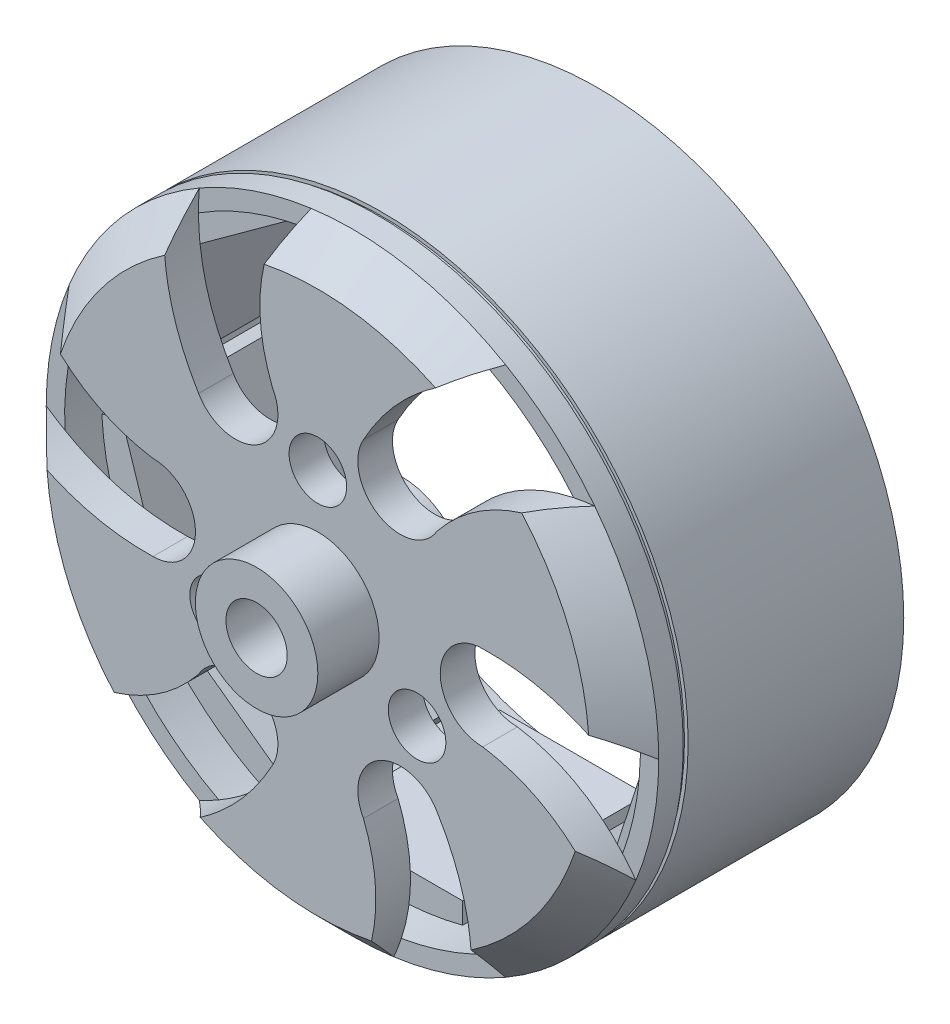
ISO-10303-21;
HEADER;
FILE_DESCRIPTION(('STEP AP214'),'2;1');
FILE_NAME('part.step','',(''),(''),'','','');
FILE_SCHEMA(('AUTOMOTIVE_DESIGN { 1 0 10303 214 1 1 1 1 }'));
ENDSEC;
DATA;
#1=APPLICATION_CONTEXT('core data for automotive mechanical design processes');
#2=APPLICATION_PROTOCOL_DEFINITION('international standard','automotive_design',2000,#1);
#3=PRODUCT_CONTEXT('',#1,'mechanical');
#4=PRODUCT('Part','Part','',(#3));
#5=PRODUCT_RELATED_PRODUCT_CATEGORY('part','',(#4));
#6=PRODUCT_DEFINITION_FORMATION('','',#4);
#7=PRODUCT_DEFINITION_CONTEXT('part definition',#1,'design');
#8=PRODUCT_DEFINITION('design','',#6,#7);
#9=PRODUCT_DEFINITION_SHAPE('','',#8);
#10=(LENGTH_UNIT() NAMED_UNIT(*) SI_UNIT(.MILLI.,.METRE.));
#11=(NAMED_UNIT(*) PLANE_ANGLE_UNIT() SI_UNIT($,.RADIAN.));
#12=(NAMED_UNIT(*) SI_UNIT($,.STERADIAN.) SOLID_ANGLE_UNIT());
#13=UNCERTAINTY_MEASURE_WITH_UNIT(LENGTH_MEASURE(1.E-05),#10,'distance_accuracy_value','');
#14=(GEOMETRIC_REPRESENTATION_CONTEXT(3) GLOBAL_UNCERTAINTY_ASSIGNED_CONTEXT((#13)) GLOBAL_UNIT_ASSIGNED_CONTEXT((#10,
#11,#12)) REPRESENTATION_CONTEXT('',''));
#15=CARTESIAN_POINT('',(0.,0.,0.));
#16=DIRECTION('',(0.,0.,1.));
#17=DIRECTION('',(1.,0.,0.));
#18=AXIS2_PLACEMENT_3D('',#15,#16,#17);
#19=CARTESIAN_POINT('',(0.,0.,20.));
#20=DIRECTION('',(0.,0.,-1.));
#21=DIRECTION('',(-1.,0.,0.));
#22=AXIS2_PLACEMENT_3D('',#19,#20,#21);
#23=CYLINDRICAL_SURFACE('',#22,25.);
#24=CARTESIAN_POINT('',(0.,0.,20.));
#25=DIRECTION('',(0.,0.,1.));
#26=DIRECTION('',(1.,0.,0.));
#27=AXIS2_PLACEMENT_3D('',#24,#25,#26);
#28=CIRCLE('',#27,25.);
#29=CARTESIAN_POINT('',(25.,2.80404407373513E-13,20.));
#30=VERTEX_POINT('',#29);
#31=CARTESIAN_POINT('',(19.7712199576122,15.3002895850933,20.));
#32=VERTEX_POINT('',#31);
#33=EDGE_CURVE('E1189',#30,#32,#28,.T.);
#34=ORIENTED_EDGE('',*,*,#33,.F.);
#35=CARTESIAN_POINT('',(-1.43288159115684E-12,2.80404407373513E-13,20.));
#36=DIRECTION('',(0.,0.,1.));
#37=DIRECTION('',(1.,0.,0.));
#38=AXIS2_PLACEMENT_3D('',#35,#36,#37);
#39=CIRCLE('',#38,25.0000000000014);
#40=CARTESIAN_POINT('',(23.1360494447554,-9.47223395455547,20.));
#41=VERTEX_POINT('',#40);
#42=EDGE_CURVE('E1054',#30,#41,#39,.F.);
#43=ORIENTED_EDGE('',*,*,#42,.T.);
#44=CARTESIAN_POINT('',(12.5000000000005,-21.6506350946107,20.));
#45=VERTEX_POINT('',#44);
#46=EDGE_CURVE('E1112',#45,#41,#28,.T.);
#47=ORIENTED_EDGE('',*,*,#46,.F.);
#48=CARTESIAN_POINT('',(-4.94849392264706E-13,1.39338040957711E-12,20.));
#49=DIRECTION('',(0.,0.,1.));
#50=DIRECTION('',(0.50000000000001,-0.866025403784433,0.));
#51=AXIS2_PLACEMENT_3D('',#48,#49,#50);
#52=CIRCLE('',#51,25.0000000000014);
#53=CARTESIAN_POINT('',(3.3648294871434,-24.7725235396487,20.));
#54=VERTEX_POINT('',#53);
#55=EDGE_CURVE('E977',#45,#54,#52,.F.);
#56=ORIENTED_EDGE('',*,*,#55,.T.);
#57=CARTESIAN_POINT('',(-12.4999999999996,-21.6506350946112,20.));
#58=VERTEX_POINT('',#57);
#59=EDGE_CURVE('E1207',#58,#54,#28,.T.);
#60=ORIENTED_EDGE('',*,*,#59,.F.);
#61=CARTESIAN_POINT('',(9.38032198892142E-13,1.13750869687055E-12,20.));
#62=DIRECTION('',(0.,0.,1.));
#63=DIRECTION('',(-0.499999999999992,-0.866025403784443,0.));
#64=AXIS2_PLACEMENT_3D('',#61,#62,#63);
#65=CIRCLE('',#64,25.0000000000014);
#66=CARTESIAN_POINT('',(-19.7712199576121,-15.3002895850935,20.));
#67=VERTEX_POINT('',#66);
#68=EDGE_CURVE('E1582',#58,#67,#65,.F.);
#69=ORIENTED_EDGE('',*,*,#68,.T.);
#70=CARTESIAN_POINT('',(-25.,-2.31339018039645E-13,20.));
#71=VERTEX_POINT('',#70);
#72=EDGE_CURVE('E1212',#71,#67,#28,.T.);
#73=ORIENTED_EDGE('',*,*,#72,.F.);
#74=CARTESIAN_POINT('',(1.43288159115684E-12,-2.31339018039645E-13,20.));
#75=DIRECTION('',(0.,0.,1.));
#76=DIRECTION('',(-1.,0.,0.));
#77=AXIS2_PLACEMENT_3D('',#74,#75,#76);
#78=CIRCLE('',#77,25.0000000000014);
#79=CARTESIAN_POINT('',(-23.1360494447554,9.4722339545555,20.));
#80=VERTEX_POINT('',#79);
#81=EDGE_CURVE('E1507',#71,#80,#78,.F.);
#82=ORIENTED_EDGE('',*,*,#81,.T.);
#83=CARTESIAN_POINT('',(-12.5000000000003,21.6506350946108,20.));
#84=VERTEX_POINT('',#83);
#85=EDGE_CURVE('E1204',#84,#80,#28,.T.);
#86=ORIENTED_EDGE('',*,*,#85,.F.);
#87=CARTESIAN_POINT('',(4.94849392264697E-13,-1.34431502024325E-12,20.));
#88=DIRECTION('',(0.,0.,1.));
#89=DIRECTION('',(-0.500000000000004,0.866025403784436,0.));
#90=AXIS2_PLACEMENT_3D('',#87,#88,#89);
#91=CIRCLE('',#90,25.0000000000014);
#92=CARTESIAN_POINT('',(-3.36482948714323,24.7725235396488,20.));
#93=VERTEX_POINT('',#92);
#94=EDGE_CURVE('E1750',#84,#93,#91,.F.);
#95=ORIENTED_EDGE('',*,*,#94,.T.);
#96=CARTESIAN_POINT('',(12.4999999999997,21.6506350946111,20.));
#97=VERTEX_POINT('',#96);
#98=EDGE_CURVE('E1198',#97,#93,#28,.T.);
#99=ORIENTED_EDGE('',*,*,#98,.F.);
#100=CARTESIAN_POINT('',(-9.3803219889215E-13,-1.08844330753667E-12,20.));
#101=DIRECTION('',(0.,0.,1.));
#102=DIRECTION('',(0.499999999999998,0.86602540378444,0.));
#103=AXIS2_PLACEMENT_3D('',#100,#101,#102);
#104=CIRCLE('',#103,25.0000000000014);
#105=EDGE_CURVE('E1641',#97,#32,#104,.F.);
#106=ORIENTED_EDGE('',*,*,#105,.T.);
#107=EDGE_LOOP('',(#34,#43,#47,#56,#60,#69,#73,#82,#86,#95,#99,#106));
#108=FACE_BOUND('',#107,.T.);
#109=CARTESIAN_POINT('',(0.,0.,18.));
#110=DIRECTION('',(0.,0.,1.));
#111=DIRECTION('',(1.,0.,0.));
#112=AXIS2_PLACEMENT_3D('',#109,#110,#111);
#113=CIRCLE('',#112,25.);
#114=CARTESIAN_POINT('',(25.,0.,18.));
#115=VERTEX_POINT('',#114);
#116=EDGE_CURVE('E1855',#115,#115,#113,.T.);
#117=ORIENTED_EDGE('',*,*,#116,.T.);
#118=EDGE_LOOP('',(#117));
#119=FACE_BOUND('',#118,.T.);
#120=ADVANCED_FACE('F45',(#108,#119),#23,.T.);
#121=CARTESIAN_POINT('',(0.,0.,0.));
#122=DIRECTION('',(0.,0.,1.));
#123=DIRECTION('',(1.,0.,0.));
#124=AXIS2_PLACEMENT_3D('',#121,#122,#123);
#125=CIRCLE('',#124,25.);
#126=CARTESIAN_POINT('',(25.,0.,0.));
#127=VERTEX_POINT('',#126);
#128=EDGE_CURVE('E1208',#127,#127,#125,.T.);
#129=ORIENTED_EDGE('',*,*,#128,.T.);
#130=EDGE_LOOP('',(#129));
#131=FACE_BOUND('',#130,.T.);
#132=CARTESIAN_POINT('',(0.,0.,17.6));
#133=DIRECTION('',(0.,0.,1.));
#134=DIRECTION('',(1.,0.,0.));
#135=AXIS2_PLACEMENT_3D('',#132,#133,#134);
#136=CIRCLE('',#135,25.);
#137=CARTESIAN_POINT('',(25.,0.,17.6));
#138=VERTEX_POINT('',#137);
#139=EDGE_CURVE('E2824',#138,#138,#136,.T.);
#140=ORIENTED_EDGE('',*,*,#139,.F.);
#141=EDGE_LOOP('',(#140));
#142=FACE_BOUND('',#141,.T.);
#143=ADVANCED_FACE('F1434',(#131,#142),#23,.T.);
#144=CARTESIAN_POINT('',(0.,25.,20.));
#145=DIRECTION('',(0.,0.,1.));
#146=DIRECTION('',(0.,-1.,0.));
#147=AXIS2_PLACEMENT_3D('',#144,#145,#146);
#148=PLANE('',#147);
#149=CARTESIAN_POINT('',(0.,0.,20.));
#150=DIRECTION('',(0.,0.,1.));
#151=DIRECTION('',(0.,-1.,0.));
#152=AXIS2_PLACEMENT_3D('',#149,#150,#151);
#153=CIRCLE('',#152,5.5);
#154=CARTESIAN_POINT('',(-5.5,0.,20.));
#155=VERTEX_POINT('',#154);
#156=EDGE_CURVE('E12',#155,#155,#153,.F.);
#157=ORIENTED_EDGE('',*,*,#156,.F.);
#158=EDGE_LOOP('',(#157));
#159=FACE_BOUND('',#158,.T.);
#160=CARTESIAN_POINT('',(6.48608285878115E-13,9.35543051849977,20.));
#161=DIRECTION('',(0.,0.,1.));
#162=DIRECTION('',(0.,-1.,0.));
#163=AXIS2_PLACEMENT_3D('',#160,#161,#162);
#164=CIRCLE('',#163,2.34907187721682);
#165=CARTESIAN_POINT('',(6.48608285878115E-13,7.00635864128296,20.));
#166=VERTEX_POINT('',#165);
#167=EDGE_CURVE('E2846',#166,#166,#164,.T.);
#168=ORIENTED_EDGE('',*,*,#167,.T.);
#169=EDGE_LOOP('',(#168));
#170=FACE_BOUND('',#169,.T.);
#171=CARTESIAN_POINT('',(8.10204049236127,-4.67771525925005,20.));
#172=DIRECTION('',(0.,0.,1.));
#173=DIRECTION('',(0.,-1.,0.));
#174=AXIS2_PLACEMENT_3D('',#171,#172,#173);
#175=CIRCLE('',#174,2.34907187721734);
#176=CARTESIAN_POINT('',(8.10204049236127,-7.02678713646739,20.));
#177=VERTEX_POINT('',#176);
#178=EDGE_CURVE('E2850',#177,#177,#175,.T.);
#179=ORIENTED_EDGE('',*,*,#178,.T.);
#180=EDGE_LOOP('',(#179));
#181=FACE_BOUND('',#180,.T.);
#182=CARTESIAN_POINT('',(-8.10204049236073,-4.67771525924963,20.));
#183=DIRECTION('',(0.,0.,1.));
#184=DIRECTION('',(0.,-1.,0.));
#185=AXIS2_PLACEMENT_3D('',#182,#183,#184);
#186=CIRCLE('',#185,2.34907187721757);
#187=CARTESIAN_POINT('',(-8.10204049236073,-7.0267871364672,20.));
#188=VERTEX_POINT('',#187);
#189=EDGE_CURVE('E2853',#188,#188,#186,.T.);
#190=ORIENTED_EDGE('',*,*,#189,.T.);
#191=EDGE_LOOP('',(#190));
#192=FACE_BOUND('',#191,.T.);
#193=CARTESIAN_POINT('',(9.73371413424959,-9.92198813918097,20.));
#194=CARTESIAN_POINT('',(13.0217247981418,-15.3400412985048,20.));
#195=CARTESIAN_POINT('',(12.5000000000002,-21.6506350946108,20.));
#196=B_SPLINE_CURVE_WITH_KNOTS('',2,(#193,#194,#195),.UNSPECIFIED.,.F.,.F.,(3,3),(0.,1.),.UNSPECIFIED.);
#197=CARTESIAN_POINT('',(9.73371413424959,-9.92198813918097,20.));
#198=VERTEX_POINT('',#197);
#199=CARTESIAN_POINT('',(12.5712713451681,-19.8548013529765,20.));
#200=VERTEX_POINT('',#199);
#201=EDGE_CURVE('E1617',#198,#200,#196,.T.);
#202=ORIENTED_EDGE('',*,*,#201,.F.);
#203=CARTESIAN_POINT('',(6.72977542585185,-11.6563129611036,20.));
#204=DIRECTION('',(0.,0.,1.));
#205=DIRECTION('',(0.50000000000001,-0.866025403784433,0.));
#206=AXIS2_PLACEMENT_3D('',#203,#204,#205);
#207=CIRCLE('',#206,3.46864964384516);
#208=CARTESIAN_POINT('',(3.72583671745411,-13.3906377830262,20.));
#209=VERTEX_POINT('',#208);
#210=EDGE_CURVE('E979',#198,#209,#207,.T.);
#211=ORIENTED_EDGE('',*,*,#210,.T.);
#212=CARTESIAN_POINT('',(3.72583671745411,-13.3906377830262,20.));
#213=CARTESIAN_POINT('',(5.90832436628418,-19.0415175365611,20.));
#214=CARTESIAN_POINT('',(3.3648294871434,-24.7725235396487,20.));
#215=B_SPLINE_CURVE_WITH_KNOTS('',2,(#212,#213,#214),.UNSPECIFIED.,.F.,.F.,(3,3),(0.,1.),.UNSPECIFIED.);
#216=CARTESIAN_POINT('',(3.98773931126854,-23.1591868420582,20.));
#217=VERTEX_POINT('',#216);
#218=EDGE_CURVE('E969',#209,#217,#215,.T.);
#219=ORIENTED_EDGE('',*,*,#218,.T.);
#220=CARTESIAN_POINT('',(0.,0.,20.));
#221=DIRECTION('',(0.,0.,1.));
#222=DIRECTION('',(1.,0.,0.));
#223=AXIS2_PLACEMENT_3D('',#220,#221,#222);
#224=CIRCLE('',#223,23.5);
#225=CARTESIAN_POINT('',(-10.9091266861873,-20.8144410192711,20.));
#226=VERTEX_POINT('',#225);
#227=EDGE_CURVE('E1158',#226,#217,#224,.T.);
#228=ORIENTED_EDGE('',*,*,#227,.F.);
#229=CARTESIAN_POINT('',(-3.72583671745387,-13.3906377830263,20.));
#230=CARTESIAN_POINT('',(-6.77400306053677,-18.947165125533,20.));
#231=CARTESIAN_POINT('',(-12.4999999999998,-21.650635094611,20.));
#232=B_SPLINE_CURVE_WITH_KNOTS('',2,(#229,#230,#231),.UNSPECIFIED.,.F.,.F.,(3,3),(0.,1.),.UNSPECIFIED.);
#233=CARTESIAN_POINT('',(-3.72583671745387,-13.3906377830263,20.));
#234=VERTEX_POINT('',#233);
#235=EDGE_CURVE('E1751',#234,#226,#232,.T.);
#236=ORIENTED_EDGE('',*,*,#235,.F.);
#237=CARTESIAN_POINT('',(-6.72977542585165,-11.6563129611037,20.));
#238=DIRECTION('',(0.,0.,1.));
#239=DIRECTION('',(-0.499999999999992,-0.866025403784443,0.));
#240=AXIS2_PLACEMENT_3D('',#237,#238,#239);
#241=CIRCLE('',#240,3.46864964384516);
#242=CARTESIAN_POINT('',(-9.73371413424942,-9.92198813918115,20.));
#243=VERTEX_POINT('',#242);
#244=EDGE_CURVE('E1584',#234,#243,#241,.T.);
#245=ORIENTED_EDGE('',*,*,#244,.T.);
#246=CARTESIAN_POINT('',(-9.73371413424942,-9.92198813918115,20.));
#247=CARTESIAN_POINT('',(-13.5362757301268,-14.6375177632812,20.));
#248=CARTESIAN_POINT('',(-19.7712199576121,-15.3002895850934,20.));
#249=B_SPLINE_CURVE_WITH_KNOTS('',2,(#246,#247,#248),.UNSPECIFIED.,.F.,.F.,(3,3),(0.,1.),.UNSPECIFIED.);
#250=CARTESIAN_POINT('',(-18.0625744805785,-15.0330769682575,20.));
#251=VERTEX_POINT('',#250);
#252=EDGE_CURVE('E1574',#243,#251,#249,.T.);
#253=ORIENTED_EDGE('',*,*,#252,.T.);
#254=CARTESIAN_POINT('',(-23.4803980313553,-0.959639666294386,20.));
#255=VERTEX_POINT('',#254);
#256=EDGE_CURVE('E1151',#255,#251,#224,.T.);
#257=ORIENTED_EDGE('',*,*,#256,.F.);
#258=CARTESIAN_POINT('',(-13.4595508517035,-3.46864964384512,20.));
#259=CARTESIAN_POINT('',(-19.7957278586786,-3.60712382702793,20.));
#260=CARTESIAN_POINT('',(-25.,0.,20.));
#261=B_SPLINE_CURVE_WITH_KNOTS('',2,(#258,#259,#260),.UNSPECIFIED.,.F.,.F.,(3,3),(0.,1.),.UNSPECIFIED.);
#262=CARTESIAN_POINT('',(-13.4595508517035,-3.46864964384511,20.));
#263=VERTEX_POINT('',#262);
#264=EDGE_CURVE('E821',#263,#255,#261,.T.);
#265=ORIENTED_EDGE('',*,*,#264,.F.);
#266=CARTESIAN_POINT('',(-13.4595508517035,0.,20.));
#267=DIRECTION('',(0.,0.,1.));
#268=DIRECTION('',(-1.,0.,0.));
#269=AXIS2_PLACEMENT_3D('',#266,#267,#268);
#270=CIRCLE('',#269,3.46864964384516);
#271=CARTESIAN_POINT('',(-13.4595508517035,3.46864964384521,20.));
#272=VERTEX_POINT('',#271);
#273=EDGE_CURVE('E827',#263,#272,#270,.T.);
#274=ORIENTED_EDGE('',*,*,#273,.T.);
#275=CARTESIAN_POINT('',(-13.4595508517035,3.46864964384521,20.));
#276=CARTESIAN_POINT('',(-19.4446000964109,4.40399977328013,20.));
#277=CARTESIAN_POINT('',(-23.1360494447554,9.47223395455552,20.));
#278=B_SPLINE_CURVE_WITH_KNOTS('',2,(#275,#276,#277),.UNSPECIFIED.,.F.,.F.,(3,3),(0.,1.),.UNSPECIFIED.);
#279=CARTESIAN_POINT('',(-22.0503137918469,8.12610987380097,20.));
#280=VERTEX_POINT('',#279);
#281=EDGE_CURVE('E1500',#272,#280,#278,.T.);
#282=ORIENTED_EDGE('',*,*,#281,.T.);
#283=CARTESIAN_POINT('',(-12.5712713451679,19.8548013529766,20.));
#284=VERTEX_POINT('',#283);
#285=EDGE_CURVE('E1144',#284,#280,#224,.T.);
#286=ORIENTED_EDGE('',*,*,#285,.F.);
#287=CARTESIAN_POINT('',(-9.73371413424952,9.92198813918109,20.));
#288=CARTESIAN_POINT('',(-13.0217247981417,15.340041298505,20.));
#289=CARTESIAN_POINT('',(-12.5000000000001,21.6506350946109,20.));
#290=B_SPLINE_CURVE_WITH_KNOTS('',2,(#287,#288,#289),.UNSPECIFIED.,.F.,.F.,(3,3),(0.,1.),.UNSPECIFIED.);
#291=CARTESIAN_POINT('',(-9.73371413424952,9.92198813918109,20.));
#292=VERTEX_POINT('',#291);
#293=EDGE_CURVE('E1544',#292,#284,#290,.T.);
#294=ORIENTED_EDGE('',*,*,#293,.F.);
#295=CARTESIAN_POINT('',(-6.72977542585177,11.6563129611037,20.));
#296=DIRECTION('',(0.,0.,1.));
#297=DIRECTION('',(-0.500000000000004,0.866025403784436,0.));
#298=AXIS2_PLACEMENT_3D('',#295,#296,#297);
#299=CIRCLE('',#298,3.46864964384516);
#300=CARTESIAN_POINT('',(-3.72583671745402,13.3906377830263,20.));
#301=VERTEX_POINT('',#300);
#302=EDGE_CURVE('E1550',#292,#301,#299,.T.);
#303=ORIENTED_EDGE('',*,*,#302,.T.);
#304=CARTESIAN_POINT('',(-3.72583671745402,13.3906377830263,20.));
#305=CARTESIAN_POINT('',(-5.90832436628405,19.0415175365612,20.));
#306=CARTESIAN_POINT('',(-3.36482948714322,24.7725235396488,20.));
#307=B_SPLINE_CURVE_WITH_KNOTS('',2,(#304,#305,#306),.UNSPECIFIED.,.F.,.F.,(3,3),(0.,1.),.UNSPECIFIED.);
#308=CARTESIAN_POINT('',(-3.9877393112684,23.1591868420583,20.));
#309=VERTEX_POINT('',#308);
#310=EDGE_CURVE('E1799',#301,#309,#307,.T.);
#311=ORIENTED_EDGE('',*,*,#310,.T.);
#312=CARTESIAN_POINT('',(10.9091266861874,20.8144410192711,20.));
#313=VERTEX_POINT('',#312);
#314=EDGE_CURVE('E1137',#313,#309,#224,.T.);
#315=ORIENTED_EDGE('',*,*,#314,.F.);
#316=CARTESIAN_POINT('',(3.72583671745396,13.3906377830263,20.));
#317=CARTESIAN_POINT('',(6.7740030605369,18.947165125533,20.));
#318=CARTESIAN_POINT('',(12.5,21.650635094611,20.));
#319=B_SPLINE_CURVE_WITH_KNOTS('',2,(#316,#317,#318),.UNSPECIFIED.,.F.,.F.,(3,3),(0.,1.),.UNSPECIFIED.);
#320=CARTESIAN_POINT('',(3.72583671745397,13.3906377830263,20.));
#321=VERTEX_POINT('',#320);
#322=EDGE_CURVE('E1015',#321,#313,#319,.T.);
#323=ORIENTED_EDGE('',*,*,#322,.F.);
#324=CARTESIAN_POINT('',(6.72977542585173,11.6563129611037,20.));
#325=DIRECTION('',(0.,0.,1.));
#326=DIRECTION('',(0.499999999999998,0.86602540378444,0.));
#327=AXIS2_PLACEMENT_3D('',#324,#325,#326);
#328=CIRCLE('',#327,3.46864964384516);
#329=CARTESIAN_POINT('',(9.73371413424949,9.92198813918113,20.));
#330=VERTEX_POINT('',#329);
#331=EDGE_CURVE('E1021',#321,#330,#328,.T.);
#332=ORIENTED_EDGE('',*,*,#331,.T.);
#333=CARTESIAN_POINT('',(9.73371413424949,9.92198813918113,20.));
#334=CARTESIAN_POINT('',(13.5362757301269,14.6375177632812,20.));
#335=CARTESIAN_POINT('',(19.7712199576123,15.3002895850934,20.));
#336=B_SPLINE_CURVE_WITH_KNOTS('',2,(#333,#334,#335),.UNSPECIFIED.,.F.,.F.,(3,3),(0.,1.),.UNSPECIFIED.);
#337=CARTESIAN_POINT('',(18.0625744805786,15.0330769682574,20.));
#338=VERTEX_POINT('',#337);
#339=EDGE_CURVE('E1634',#330,#338,#336,.T.);
#340=ORIENTED_EDGE('',*,*,#339,.T.);
#341=CARTESIAN_POINT('',(23.4803980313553,0.959639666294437,20.));
#342=VERTEX_POINT('',#341);
#343=EDGE_CURVE('E1121',#342,#338,#224,.T.);
#344=ORIENTED_EDGE('',*,*,#343,.F.);
#345=CARTESIAN_POINT('',(13.4595508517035,3.46864964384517,20.));
#346=CARTESIAN_POINT('',(19.7957278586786,3.60712382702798,20.));
#347=CARTESIAN_POINT('',(25.,0.,20.));
#348=B_SPLINE_CURVE_WITH_KNOTS('',2,(#345,#346,#347),.UNSPECIFIED.,.F.,.F.,(3,3),(0.,1.),.UNSPECIFIED.);
#349=CARTESIAN_POINT('',(13.4595508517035,3.46864964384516,20.));
#350=VERTEX_POINT('',#349);
#351=EDGE_CURVE('E1785',#350,#342,#348,.T.);
#352=ORIENTED_EDGE('',*,*,#351,.F.);
#353=CARTESIAN_POINT('',(13.4595508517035,0.,20.));
#354=DIRECTION('',(0.,0.,1.));
#355=DIRECTION('',(1.,0.,0.));
#356=AXIS2_PLACEMENT_3D('',#353,#354,#355);
#357=CIRCLE('',#356,3.46864964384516);
#358=CARTESIAN_POINT('',(13.4595508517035,-3.46864964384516,20.));
#359=VERTEX_POINT('',#358);
#360=EDGE_CURVE('E1056',#350,#359,#357,.T.);
#361=ORIENTED_EDGE('',*,*,#360,.T.);
#362=CARTESIAN_POINT('',(13.4595508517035,-3.46864964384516,20.));
#363=CARTESIAN_POINT('',(19.4446000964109,-4.40399977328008,20.));
#364=CARTESIAN_POINT('',(23.1360494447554,-9.47223395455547,20.));
#365=B_SPLINE_CURVE_WITH_KNOTS('',2,(#362,#363,#364),.UNSPECIFIED.,.F.,.F.,(3,3),(0.,1.),.UNSPECIFIED.);
#366=CARTESIAN_POINT('',(22.0503137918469,-8.12610987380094,20.));
#367=VERTEX_POINT('',#366);
#368=EDGE_CURVE('E1046',#359,#367,#365,.T.);
#369=ORIENTED_EDGE('',*,*,#368,.T.);
#370=EDGE_CURVE('E1134',#200,#367,#224,.T.);
#371=ORIENTED_EDGE('',*,*,#370,.F.);
#372=EDGE_LOOP('',(#202,#211,#219,#228,#236,#245,#253,#257,#265,#274,#282,#286,#294,#303,#311,
#315,#323,#332,#340,#344,#352,#361,#369,#371));
#373=FACE_BOUND('',#372,.T.);
#374=ADVANCED_FACE('F879',(#159,#170,#181,#192,#373),#148,.F.);
#375=CARTESIAN_POINT('',(0.,0.,20.));
#376=DIRECTION('',(0.,0.,-1.));
#377=DIRECTION('',(0.,1.,0.));
#378=AXIS2_PLACEMENT_3D('',#375,#376,#377);
#379=CONICAL_SURFACE('',#378,25.,0.785398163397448);
#380=CARTESIAN_POINT('',(12.5000000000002,-21.6506350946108,20.));
#381=CARTESIAN_POINT('',(12.5116303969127,-21.5099673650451,20.1160069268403));
#382=CARTESIAN_POINT('',(12.5218602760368,-21.3693816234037,20.2322546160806));
#383=CARTESIAN_POINT('',(12.5394828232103,-21.0885443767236,20.4651450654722));
#384=CARTESIAN_POINT('',(12.5468776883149,-20.9482926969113,20.5817874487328));
#385=CARTESIAN_POINT('',(12.5588090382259,-20.6681490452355,20.8154993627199));
#386=CARTESIAN_POINT('',(12.5633470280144,-20.5282569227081,20.9325686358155));
#387=CARTESIAN_POINT('',(12.5695463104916,-20.2488580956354,21.1671658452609));
#388=CARTESIAN_POINT('',(12.5712083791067,-20.109351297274,21.2846936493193));
#389=CARTESIAN_POINT('',(12.5716389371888,-19.8307455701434,21.5202418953));
#390=CARTESIAN_POINT('',(12.5704073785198,-19.6916466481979,21.638262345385));
#391=CARTESIAN_POINT('',(12.565035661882,-19.4138863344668,21.8748232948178));
#392=CARTESIAN_POINT('',(12.5608947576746,-19.2752250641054,21.9933639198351));
#393=CARTESIAN_POINT('',(12.5496909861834,-18.9983662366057,22.2309950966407));
#394=CARTESIAN_POINT('',(12.5426265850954,-18.8601689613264,22.3500859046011));
#395=CARTESIAN_POINT('',(12.5255657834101,-18.5842636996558,22.5888465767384));
#396=CARTESIAN_POINT('',(12.5155670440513,-18.4465561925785,22.7085168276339));
#397=CARTESIAN_POINT('',(12.5041018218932,-18.3091802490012,22.8284271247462));
#398=B_SPLINE_CURVE_WITH_KNOTS('',3,(#380,#381,#382,#383,#384,#385,#386,#387,#388,#389,#390,
#391,#392,#393,#394,#395,#396,#397),.UNSPECIFIED.,.F.,.F.,(4,2,2,2,2,2,2,2,4),(0.,
0.548103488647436,1.09578134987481,1.64317045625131,2.19041185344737,2.73766235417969,
3.28505327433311,3.83273174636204,4.38084792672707),.UNSPECIFIED.);
#399=CARTESIAN_POINT('',(12.5041018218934,-18.3091802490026,22.8284271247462));
#400=VERTEX_POINT('',#399);
#401=EDGE_CURVE('E952',#45,#400,#398,.T.);
#402=ORIENTED_EDGE('',*,*,#401,.F.);
#403=ORIENTED_EDGE('',*,*,#46,.T.);
#404=CARTESIAN_POINT('',(23.1360494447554,-9.47223395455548,20.));
#405=CARTESIAN_POINT('',(23.0560350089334,-9.36237539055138,20.1156733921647));
#406=CARTESIAN_POINT('',(22.9749391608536,-9.25360096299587,20.2316304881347));
#407=CARTESIAN_POINT('',(22.8106745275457,-9.03843265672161,20.463999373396));
#408=CARTESIAN_POINT('',(22.727507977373,-8.93203642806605,20.5804105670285));
#409=CARTESIAN_POINT('',(22.5590862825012,-8.72168402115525,20.8137310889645));
#410=CARTESIAN_POINT('',(22.4738326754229,-8.61772615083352,20.9306400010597));
#411=CARTESIAN_POINT('',(22.3012240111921,-8.41230903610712,21.1649990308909));
#412=CARTESIAN_POINT('',(22.2138697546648,-8.31084886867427,21.2824489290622));
#413=CARTESIAN_POINT('',(22.0370423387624,-8.1104786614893,21.5179407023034));
#414=CARTESIAN_POINT('',(21.9475690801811,-8.01156874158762,21.6359826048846));
#415=CARTESIAN_POINT('',(21.766500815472,-7.81636463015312,21.8726915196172));
#416=CARTESIAN_POINT('',(21.6749051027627,-7.72007133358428,21.991358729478));
#417=CARTESIAN_POINT('',(21.4895847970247,-7.53015824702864,22.2293589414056));
#418=CARTESIAN_POINT('',(21.3958587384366,-7.43654040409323,22.3486923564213));
#419=CARTESIAN_POINT('',(21.2062736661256,-7.25203286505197,22.5880646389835));
#420=CARTESIAN_POINT('',(21.1104124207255,-7.16114628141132,22.7081041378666));
#421=CARTESIAN_POINT('',(21.0135532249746,-7.07172006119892,22.8284271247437));
#422=B_SPLINE_CURVE_WITH_KNOTS('',3,(#404,#405,#406,#407,#408,#409,#410,#411,#412,#413,#414,
#415,#416,#417,#418,#419,#420,#421),.UNSPECIFIED.,.F.,.F.,(4,2,2,2,2,2,2,2,4),(0.,
0.535405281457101,1.07025577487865,1.60472342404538,2.13899050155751,2.6732826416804,
3.20775528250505,3.74260745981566,4.27804765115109),.UNSPECIFIED.);
#423=CARTESIAN_POINT('',(21.0135532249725,-7.07172006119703,22.8284271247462));
#424=VERTEX_POINT('',#423);
#425=EDGE_CURVE('E884',#41,#424,#422,.T.);
#426=ORIENTED_EDGE('',*,*,#425,.T.);
#427=CARTESIAN_POINT('',(0.,0.,22.8284271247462));
#428=DIRECTION('',(0.,0.,1.));
#429=DIRECTION('',(0.,-1.,0.));
#430=AXIS2_PLACEMENT_3D('',#427,#428,#429);
#431=CIRCLE('',#430,22.1715728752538);
#432=EDGE_CURVE('E1104',#400,#424,#431,.T.);
#433=ORIENTED_EDGE('',*,*,#432,.F.);
#434=EDGE_LOOP('',(#402,#403,#426,#433));
#435=FACE_BOUND('',#434,.T.);
#436=ADVANCED_FACE('F876',(#435),#379,.T.);
#437=ORIENTED_EDGE('',*,*,#59,.T.);
#438=CARTESIAN_POINT('',(3.36482948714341,-24.7725235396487,20.));
#439=CARTESIAN_POINT('',(3.4199625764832,-24.6482997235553,20.1156733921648));
#440=CARTESIAN_POINT('',(3.47361606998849,-24.523681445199,20.2316304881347));
#441=CARTESIAN_POINT('',(3.57782497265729,-24.2738399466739,20.4639993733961));
#442=CARTESIAN_POINT('',(3.62838353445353,-24.1486174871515,20.5804105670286));
#443=CARTESIAN_POINT('',(3.72634321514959,-23.8975838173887,20.8137310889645));
#444=CARTESIAN_POINT('',(3.7737465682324,-23.7717730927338,20.9306400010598));
#445=CARTESIAN_POINT('',(3.86533867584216,-23.5195810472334,21.1649990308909));
#446=CARTESIAN_POINT('',(3.90952863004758,-23.3931999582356,21.2824489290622));
#447=CARTESIAN_POINT('',(3.99464061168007,-23.139877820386,21.5179407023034));
#448=CARTESIAN_POINT('',(4.03556248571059,-23.0129367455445,21.6359826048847));
#449=CARTESIAN_POINT('',(4.11408007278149,-22.75852497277,21.8726915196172));
#450=CARTESIAN_POINT('',(4.15167465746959,-22.6310541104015,21.991358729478));
#451=CARTESIAN_POINT('',(4.22348406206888,-22.3756054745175,22.2293589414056));
#452=CARTESIAN_POINT('',(4.25769646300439,-22.2476274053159,22.3486923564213));
#453=CARTESIAN_POINT('',(4.32269214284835,-21.9911881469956,22.5880646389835));
#454=CARTESIAN_POINT('',(4.35347161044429,-21.8627265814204,22.7081041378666));
#455=CARTESIAN_POINT('',(4.38248739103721,-21.7341309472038,22.8284271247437));
#456=B_SPLINE_CURVE_WITH_KNOTS('',3,(#438,#439,#440,#441,#442,#443,#444,#445,#446,#447,#448,
#449,#450,#451,#452,#453,#454,#455),.UNSPECIFIED.,.F.,.F.,(4,2,2,2,2,2,2,2,4),(0.,
0.535405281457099,1.07025577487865,1.60472342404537,2.1389905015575,2.67328264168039,
3.20775528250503,3.74260745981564,4.27804765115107),.UNSPECIFIED.);
#457=CARTESIAN_POINT('',(4.38248739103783,-21.7341309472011,22.8284271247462));
#458=VERTEX_POINT('',#457);
#459=EDGE_CURVE('E944',#54,#458,#456,.T.);
#460=ORIENTED_EDGE('',*,*,#459,.T.);
#461=CARTESIAN_POINT('',(-9.60416430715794,-19.9834599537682,22.8284271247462));
#462=VERTEX_POINT('',#461);
#463=EDGE_CURVE('E1176',#462,#458,#431,.T.);
#464=ORIENTED_EDGE('',*,*,#463,.F.);
#465=CARTESIAN_POINT('',(-12.4999999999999,-21.6506350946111,20.));
#466=CARTESIAN_POINT('',(-12.372362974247,-21.5903734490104,20.1160069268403));
#467=CARTESIAN_POINT('',(-12.2454972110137,-21.5289399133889,20.2322546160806));
#468=CARTESIAN_POINT('',(-11.993473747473,-21.4037828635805,20.4651450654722));
#469=CARTESIAN_POINT('',(-11.8683147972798,-21.3400611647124,20.5817874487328));
#470=CARTESIAN_POINT('',(-11.6197376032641,-21.2103221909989,20.8154993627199));
#471=CARTESIAN_POINT('',(-11.4963184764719,-21.1443061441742,20.9325686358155));
#472=CARTESIAN_POINT('',(-11.2512523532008,-21.0099754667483,21.1671658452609));
#473=CARTESIAN_POINT('',(-11.1296048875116,-20.9416614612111,21.2846936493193));
#474=CARTESIAN_POINT('',(-10.8881099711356,-20.8027314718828,21.5202418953));
#475=CARTESIAN_POINT('',(-10.7682625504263,-20.7321154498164,21.638262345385));
#476=CARTESIAN_POINT('',(-10.5304009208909,-20.5885832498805,21.8748232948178));
#477=CARTESIAN_POINT('',(-10.4123871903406,-20.5156664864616,21.9933639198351));
#478=CARTESIAN_POINT('',(-10.1782222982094,-20.3675343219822,22.2309950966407));
#479=CARTESIAN_POINT('',(-10.0620721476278,-20.2923177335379,22.3500859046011));
#480=CARTESIAN_POINT('',(-9.83166158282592,-20.1395900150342,22.5888465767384));
#481=CARTESIAN_POINT('',(-9.71740275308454,-20.0620770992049,22.7085168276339));
#482=CARTESIAN_POINT('',(-9.60416430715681,-19.9834599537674,22.8284271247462));
#483=B_SPLINE_CURVE_WITH_KNOTS('',3,(#465,#466,#467,#468,#469,#470,#471,#472,#473,#474,#475,
#476,#477,#478,#479,#480,#481,#482),.UNSPECIFIED.,.F.,.F.,(4,2,2,2,2,2,2,2,4),(0.,
0.548103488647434,1.09578134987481,1.64317045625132,2.19041185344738,2.7376623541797,
3.28505327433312,3.83273174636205,4.38084792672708),.UNSPECIFIED.);
#484=EDGE_CURVE('E937',#58,#462,#483,.T.);
#485=ORIENTED_EDGE('',*,*,#484,.F.);
#486=EDGE_LOOP('',(#437,#460,#464,#485));
#487=FACE_BOUND('',#486,.T.);
#488=ADVANCED_FACE('F1774',(#487),#379,.T.);
#489=CARTESIAN_POINT('',(-12.5000000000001,21.650635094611,20.));
#490=CARTESIAN_POINT('',(-12.5116303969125,21.5099673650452,20.1160069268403));
#491=CARTESIAN_POINT('',(-12.5218602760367,21.3693816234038,20.2322546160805));
#492=CARTESIAN_POINT('',(-12.5394828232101,21.0885443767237,20.4651450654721));
#493=CARTESIAN_POINT('',(-12.5468776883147,20.9482926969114,20.5817874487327));
#494=CARTESIAN_POINT('',(-12.5588090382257,20.6681490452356,20.8154993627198));
#495=CARTESIAN_POINT('',(-12.5633470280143,20.5282569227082,20.9325686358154));
#496=CARTESIAN_POINT('',(-12.5695463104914,20.2488580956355,21.1671658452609));
#497=CARTESIAN_POINT('',(-12.5712083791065,20.1093512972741,21.2846936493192));
#498=CARTESIAN_POINT('',(-12.5716389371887,19.8307455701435,21.5202418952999));
#499=CARTESIAN_POINT('',(-12.5704073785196,19.691646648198,21.6382623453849));
#500=CARTESIAN_POINT('',(-12.5650356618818,19.4138863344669,21.8748232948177));
#501=CARTESIAN_POINT('',(-12.5608947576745,19.2752250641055,21.9933639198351));
#502=CARTESIAN_POINT('',(-12.5496909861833,18.9983662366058,22.2309950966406));
#503=CARTESIAN_POINT('',(-12.5426265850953,18.8601689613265,22.3500859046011));
#504=CARTESIAN_POINT('',(-12.52556578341,18.5842636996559,22.5888465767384));
#505=CARTESIAN_POINT('',(-12.5155670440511,18.4465561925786,22.7085168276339));
#506=CARTESIAN_POINT('',(-12.5041018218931,18.3091802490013,22.8284271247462));
#507=B_SPLINE_CURVE_WITH_KNOTS('',3,(#489,#490,#491,#492,#493,#494,#495,#496,#497,#498,#499,
#500,#501,#502,#503,#504,#505,#506),.UNSPECIFIED.,.F.,.F.,(4,2,2,2,2,2,2,2,4),(0.,
0.548103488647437,1.09578134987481,1.64317045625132,2.19041185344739,2.73766235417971,
3.28505327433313,3.83273174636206,4.38084792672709),.UNSPECIFIED.);
#508=CARTESIAN_POINT('',(-12.5041018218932,18.3091802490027,22.8284271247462));
#509=VERTEX_POINT('',#508);
#510=EDGE_CURVE('E922',#84,#509,#507,.T.);
#511=ORIENTED_EDGE('',*,*,#510,.F.);
#512=ORIENTED_EDGE('',*,*,#85,.T.);
#513=CARTESIAN_POINT('',(-23.1360494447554,9.47223395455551,20.));
#514=CARTESIAN_POINT('',(-23.0560350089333,9.36237539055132,20.1156733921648));
#515=CARTESIAN_POINT('',(-22.9749391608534,9.25360096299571,20.2316304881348));
#516=CARTESIAN_POINT('',(-22.8106745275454,9.03843265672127,20.4639993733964));
#517=CARTESIAN_POINT('',(-22.7275079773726,8.93203642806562,20.580410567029));
#518=CARTESIAN_POINT('',(-22.5590862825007,8.72168402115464,20.8137310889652));
#519=CARTESIAN_POINT('',(-22.4738326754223,8.61772615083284,20.9306400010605));
#520=CARTESIAN_POINT('',(-22.3012240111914,8.41230903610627,21.1649990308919));
#521=CARTESIAN_POINT('',(-22.213869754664,8.31084886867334,21.2824489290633));
#522=CARTESIAN_POINT('',(-22.0370423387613,8.11047866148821,21.5179407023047));
#523=CARTESIAN_POINT('',(-21.94756908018,8.01156874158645,21.6359826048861));
#524=CARTESIAN_POINT('',(-21.7665008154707,7.81636463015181,21.8726915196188));
#525=CARTESIAN_POINT('',(-21.6749051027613,7.72007133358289,21.9913587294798));
#526=CARTESIAN_POINT('',(-21.4895847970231,7.53015824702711,22.2293589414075));
#527=CARTESIAN_POINT('',(-21.3958587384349,7.43654040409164,22.3486923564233));
#528=CARTESIAN_POINT('',(-21.2062736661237,7.25203286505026,22.5880646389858));
#529=CARTESIAN_POINT('',(-21.1104124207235,7.16114628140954,22.708104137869));
#530=CARTESIAN_POINT('',(-21.0135532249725,7.07172006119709,22.8284271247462));
#531=B_SPLINE_CURVE_WITH_KNOTS('',3,(#513,#514,#515,#516,#517,#518,#519,#520,#521,#522,#523,
#524,#525,#526,#527,#528,#529,#530),.UNSPECIFIED.,.F.,.F.,(4,2,2,2,2,2,2,2,4),(0.,
0.535405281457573,1.07025577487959,1.60472342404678,2.13899050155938,2.67328264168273,
3.20775528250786,3.74260745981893,4.27804765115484),.UNSPECIFIED.);
#532=CARTESIAN_POINT('',(-21.0135532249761,7.0717200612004,22.8284271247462));
#533=VERTEX_POINT('',#532);
#534=EDGE_CURVE('E857',#80,#533,#531,.T.);
#535=ORIENTED_EDGE('',*,*,#534,.T.);
#536=EDGE_CURVE('E1173',#509,#533,#431,.T.);
#537=ORIENTED_EDGE('',*,*,#536,.F.);
#538=EDGE_LOOP('',(#511,#512,#535,#537));
#539=FACE_BOUND('',#538,.T.);
#540=ADVANCED_FACE('F1696',(#539),#379,.T.);
#541=ORIENTED_EDGE('',*,*,#72,.T.);
#542=CARTESIAN_POINT('',(-19.7712199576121,-15.3002895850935,20.));
#543=CARTESIAN_POINT('',(-19.6360724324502,-15.2859243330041,20.1156733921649));
#544=CARTESIAN_POINT('',(-19.501323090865,-15.2700804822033,20.2316304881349));
#545=CARTESIAN_POINT('',(-19.232849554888,-15.2354072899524,20.4639993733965));
#546=CARTESIAN_POINT('',(-19.099124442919,-15.2165810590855,20.5804105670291));
#547=CARTESIAN_POINT('',(-18.8327430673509,-15.1758997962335,20.8137310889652));
#548=CARTESIAN_POINT('',(-18.7000861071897,-15.1540469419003,20.9306400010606));
#549=CARTESIAN_POINT('',(-18.4358853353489,-15.1072720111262,21.1649990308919));
#550=CARTESIAN_POINT('',(-18.3043411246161,-15.0823510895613,21.2824489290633));
#551=CARTESIAN_POINT('',(-18.0424017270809,-15.0293991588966,21.5179407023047));
#552=CARTESIAN_POINT('',(-17.912006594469,-15.0013680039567,21.6359826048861));
#553=CARTESIAN_POINT('',(-17.6524207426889,-14.9421603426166,21.8726915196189));
#554=CARTESIAN_POINT('',(-17.5232304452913,-14.910982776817,21.9913587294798));
#555=CARTESIAN_POINT('',(-17.2661007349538,-14.8454472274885,22.2293589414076));
#556=CARTESIAN_POINT('',(-17.1381622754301,-14.8110870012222,22.3486923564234));
#557=CARTESIAN_POINT('',(-16.8835815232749,-14.7391552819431,22.5880646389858));
#558=CARTESIAN_POINT('',(-16.7569408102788,-14.7015803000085,22.708104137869));
#559=CARTESIAN_POINT('',(-16.6310658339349,-14.6624108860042,22.8284271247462));
#560=B_SPLINE_CURVE_WITH_KNOTS('',3,(#542,#543,#544,#545,#546,#547,#548,#549,#550,#551,#552,
#553,#554,#555,#556,#557,#558,#559),.UNSPECIFIED.,.F.,.F.,(4,2,2,2,2,2,2,2,4),(0.,
0.535405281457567,1.07025577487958,1.60472342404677,2.13899050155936,2.67328264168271,
3.20775528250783,3.7426074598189,4.27804765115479),.UNSPECIFIED.);
#561=CARTESIAN_POINT('',(-16.6310658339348,-14.6624108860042,22.8284271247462));
#562=VERTEX_POINT('',#561);
#563=EDGE_CURVE('E930',#67,#562,#560,.T.);
#564=ORIENTED_EDGE('',*,*,#563,.T.);
#565=CARTESIAN_POINT('',(-22.1082661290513,-1.67427970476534,22.8284271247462));
#566=VERTEX_POINT('',#565);
#567=EDGE_CURVE('E1180',#566,#562,#431,.T.);
#568=ORIENTED_EDGE('',*,*,#567,.F.);
#569=CARTESIAN_POINT('',(-25.,0.,20.));
#570=CARTESIAN_POINT('',(-24.8839933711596,-0.0804060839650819,20.1160069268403));
#571=CARTESIAN_POINT('',(-24.7673574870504,-0.159558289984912,20.2322546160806));
#572=CARTESIAN_POINT('',(-24.5329565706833,-0.315238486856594,20.4651450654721));
#573=CARTESIAN_POINT('',(-24.4151924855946,-0.391768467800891,20.5817874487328));
#574=CARTESIAN_POINT('',(-24.17854664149,-0.54217314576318,20.8154993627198));
#575=CARTESIAN_POINT('',(-24.0596655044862,-0.616049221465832,20.9325686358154));
#576=CARTESIAN_POINT('',(-23.8207986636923,-0.761117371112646,21.1671658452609));
#577=CARTESIAN_POINT('',(-23.7008132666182,-0.832310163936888,21.2846936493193));
#578=CARTESIAN_POINT('',(-23.4597489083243,-0.971985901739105,21.5202418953));
#579=CARTESIAN_POINT('',(-23.338669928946,-1.04046880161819,21.6382623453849));
#580=CARTESIAN_POINT('',(-23.0954365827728,-1.17469691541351,21.8748232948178));
#581=CARTESIAN_POINT('',(-22.9732819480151,-1.240441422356,21.9933639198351));
#582=CARTESIAN_POINT('',(-22.7279132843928,-1.36916808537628,22.2309950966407));
#583=CARTESIAN_POINT('',(-22.6046987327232,-1.43214877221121,22.3500859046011));
#584=CARTESIAN_POINT('',(-22.357227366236,-1.55532631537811,22.5888465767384));
#585=CARTESIAN_POINT('',(-22.2329697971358,-1.61552090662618,22.7085168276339));
#586=CARTESIAN_POINT('',(-22.10826612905,-1.67427970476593,22.8284271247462));
#587=B_SPLINE_CURVE_WITH_KNOTS('',3,(#569,#570,#571,#572,#573,#574,#575,#576,#577,#578,#579,
#580,#581,#582,#583,#584,#585,#586),.UNSPECIFIED.,.F.,.F.,(4,2,2,2,2,2,2,2,4),(0.,
0.548103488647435,1.09578134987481,1.64317045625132,2.19041185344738,2.7376623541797,
3.28505327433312,3.83273174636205,4.38084792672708),.UNSPECIFIED.);
#588=EDGE_CURVE('E847',#71,#566,#587,.T.);
#589=ORIENTED_EDGE('',*,*,#588,.F.);
#590=EDGE_LOOP('',(#541,#564,#568,#589));
#591=FACE_BOUND('',#590,.T.);
#592=ADVANCED_FACE('F1715',(#591),#379,.T.);
#593=ORIENTED_EDGE('',*,*,#98,.T.);
#594=CARTESIAN_POINT('',(-3.36482948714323,24.7725235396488,20.));
#595=CARTESIAN_POINT('',(-3.41996257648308,24.6482997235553,20.1156733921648));
#596=CARTESIAN_POINT('',(-3.47361606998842,24.5236814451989,20.2316304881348));
#597=CARTESIAN_POINT('',(-3.57782497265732,24.2738399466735,20.4639993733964));
#598=CARTESIAN_POINT('',(-3.62838353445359,24.1486174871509,20.580410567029));
#599=CARTESIAN_POINT('',(-3.72634321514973,23.8975838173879,20.8137310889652));
#600=CARTESIAN_POINT('',(-3.77374656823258,23.7717730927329,20.9306400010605));
#601=CARTESIAN_POINT('',(-3.8653386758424,23.5195810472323,21.1649990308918));
#602=CARTESIAN_POINT('',(-3.90952863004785,23.3931999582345,21.2824489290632));
#603=CARTESIAN_POINT('',(-3.9946406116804,23.1398778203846,21.5179407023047));
#604=CARTESIAN_POINT('',(-4.03556248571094,23.0129367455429,21.635982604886));
#605=CARTESIAN_POINT('',(-4.11408007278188,22.7585249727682,21.8726915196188));
#606=CARTESIAN_POINT('',(-4.15167465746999,22.6310541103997,21.9913587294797));
#607=CARTESIAN_POINT('',(-4.22348406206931,22.3756054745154,22.2293589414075));
#608=CARTESIAN_POINT('',(-4.25769646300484,22.2476274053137,22.3486923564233));
#609=CARTESIAN_POINT('',(-4.32269214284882,21.9911881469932,22.5880646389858));
#610=CARTESIAN_POINT('',(-4.35347161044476,21.8627265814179,22.708104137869));
#611=CARTESIAN_POINT('',(-4.38248739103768,21.7341309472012,22.8284271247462));
#612=B_SPLINE_CURVE_WITH_KNOTS('',3,(#594,#595,#596,#597,#598,#599,#600,#601,#602,#603,#604,
#605,#606,#607,#608,#609,#610,#611),.UNSPECIFIED.,.F.,.F.,(4,2,2,2,2,2,2,2,4),(0.,
0.53540528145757,1.0702557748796,1.60472342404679,2.13899050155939,2.67328264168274,
3.20775528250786,3.74260745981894,4.27804765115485),.UNSPECIFIED.);
#613=CARTESIAN_POINT('',(-4.38248739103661,21.7341309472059,22.8284271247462));
#614=VERTEX_POINT('',#613);
#615=EDGE_CURVE('E856',#93,#614,#612,.T.);
#616=ORIENTED_EDGE('',*,*,#615,.T.);
#617=CARTESIAN_POINT('',(9.60416430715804,19.9834599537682,22.8284271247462));
#618=VERTEX_POINT('',#617);
#619=EDGE_CURVE('E1169',#618,#614,#431,.T.);
#620=ORIENTED_EDGE('',*,*,#619,.F.);
#621=CARTESIAN_POINT('',(12.5,21.650635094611,20.));
#622=CARTESIAN_POINT('',(12.3723629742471,21.5903734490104,20.1160069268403));
#623=CARTESIAN_POINT('',(12.2454972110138,21.5289399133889,20.2322546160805));
#624=CARTESIAN_POINT('',(11.9934737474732,21.4037828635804,20.4651450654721));
#625=CARTESIAN_POINT('',(11.8683147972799,21.3400611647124,20.5817874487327));
#626=CARTESIAN_POINT('',(11.6197376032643,21.2103221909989,20.8154993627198));
#627=CARTESIAN_POINT('',(11.496318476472,21.1443061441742,20.9325686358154));
#628=CARTESIAN_POINT('',(11.2512523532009,21.0099754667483,21.1671658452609));
#629=CARTESIAN_POINT('',(11.1296048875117,20.9416614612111,21.2846936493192));
#630=CARTESIAN_POINT('',(10.8881099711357,20.8027314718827,21.5202418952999));
#631=CARTESIAN_POINT('',(10.7682625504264,20.7321154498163,21.6382623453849));
#632=CARTESIAN_POINT('',(10.530400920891,20.5885832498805,21.8748232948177));
#633=CARTESIAN_POINT('',(10.4123871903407,20.5156664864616,21.9933639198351));
#634=CARTESIAN_POINT('',(10.1782222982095,20.3675343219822,22.2309950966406));
#635=CARTESIAN_POINT('',(10.0620721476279,20.2923177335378,22.3500859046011));
#636=CARTESIAN_POINT('',(9.83166158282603,20.1395900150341,22.5888465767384));
#637=CARTESIAN_POINT('',(9.71740275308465,20.0620770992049,22.7085168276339));
#638=CARTESIAN_POINT('',(9.60416430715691,19.9834599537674,22.8284271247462));
#639=B_SPLINE_CURVE_WITH_KNOTS('',3,(#621,#622,#623,#624,#625,#626,#627,#628,#629,#630,#631,
#632,#633,#634,#635,#636,#637,#638),.UNSPECIFIED.,.F.,.F.,(4,2,2,2,2,2,2,2,4),(0.,
0.548103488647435,1.09578134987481,1.64317045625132,2.19041185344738,2.7376623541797,
3.28505327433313,3.83273174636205,4.38084792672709),.UNSPECIFIED.);
#640=EDGE_CURVE('E912',#97,#618,#639,.T.);
#641=ORIENTED_EDGE('',*,*,#640,.F.);
#642=EDGE_LOOP('',(#593,#616,#620,#641));
#643=FACE_BOUND('',#642,.T.);
#644=ADVANCED_FACE('F877',(#643),#379,.T.);
#645=CARTESIAN_POINT('',(0.,22.1715728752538,22.8284271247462));
#646=DIRECTION('',(0.,0.,-1.));
#647=DIRECTION('',(0.,1.,0.));
#648=AXIS2_PLACEMENT_3D('',#645,#646,#647);
#649=PLANE('',#648);
#650=CARTESIAN_POINT('',(6.48608285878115E-13,9.35543051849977,22.8284271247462));
#651=DIRECTION('',(0.,0.,1.));
#652=DIRECTION('',(1.,0.,0.));
#653=AXIS2_PLACEMENT_3D('',#650,#651,#652);
#654=CIRCLE('',#653,2.34907187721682);
#655=CARTESIAN_POINT('',(2.34907187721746,9.35543051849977,22.8284271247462));
#656=VERTEX_POINT('',#655);
#657=EDGE_CURVE('E1857',#656,#656,#654,.T.);
#658=ORIENTED_EDGE('',*,*,#657,.F.);
#659=EDGE_LOOP('',(#658));
#660=FACE_BOUND('',#659,.T.);
#661=CARTESIAN_POINT('',(8.10204049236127,-4.67771525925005,22.8284271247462));
#662=DIRECTION('',(0.,0.,1.));
#663=DIRECTION('',(1.,0.,0.));
#664=AXIS2_PLACEMENT_3D('',#661,#662,#663);
#665=CIRCLE('',#664,2.34907187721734);
#666=CARTESIAN_POINT('',(10.4511123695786,-4.67771525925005,22.8284271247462));
#667=VERTEX_POINT('',#666);
#668=EDGE_CURVE('E2861',#667,#667,#665,.T.);
#669=ORIENTED_EDGE('',*,*,#668,.F.);
#670=EDGE_LOOP('',(#669));
#671=FACE_BOUND('',#670,.T.);
#672=CARTESIAN_POINT('',(-8.10204049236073,-4.67771525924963,22.8284271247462));
#673=DIRECTION('',(0.,0.,1.));
#674=DIRECTION('',(1.,0.,0.));
#675=AXIS2_PLACEMENT_3D('',#672,#673,#674);
#676=CIRCLE('',#675,2.34907187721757);
#677=CARTESIAN_POINT('',(-5.75296861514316,-4.67771525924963,22.8284271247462));
#678=VERTEX_POINT('',#677);
#679=EDGE_CURVE('E1854',#678,#678,#676,.T.);
#680=ORIENTED_EDGE('',*,*,#679,.F.);
#681=EDGE_LOOP('',(#680));
#682=FACE_BOUND('',#681,.T.);
#683=CARTESIAN_POINT('',(0.,0.,22.8284271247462));
#684=DIRECTION('',(0.,0.,1.));
#685=DIRECTION('',(1.,0.,0.));
#686=AXIS2_PLACEMENT_3D('',#683,#684,#685);
#687=CIRCLE('',#686,5.);
#688=CARTESIAN_POINT('',(5.,0.,22.8284271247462));
#689=VERTEX_POINT('',#688);
#690=EDGE_CURVE('E1185',#689,#689,#687,.T.);
#691=ORIENTED_EDGE('',*,*,#690,.F.);
#692=EDGE_LOOP('',(#691));
#693=FACE_BOUND('',#692,.T.);
#694=CARTESIAN_POINT('',(9.73371413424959,-9.92198813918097,22.8284271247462));
#695=CARTESIAN_POINT('',(13.0217247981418,-15.3400412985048,22.8284271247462));
#696=CARTESIAN_POINT('',(12.5000000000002,-21.6506350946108,22.8284271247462));
#697=B_SPLINE_CURVE_WITH_KNOTS('',2,(#694,#695,#696),.UNSPECIFIED.,.F.,.F.,(3,3),(0.,1.),.UNSPECIFIED.);
#698=CARTESIAN_POINT('',(9.73371413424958,-9.92198813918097,22.8284271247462));
#699=VERTEX_POINT('',#698);
#700=EDGE_CURVE('E810',#699,#400,#697,.T.);
#701=ORIENTED_EDGE('',*,*,#700,.T.);
#702=ORIENTED_EDGE('',*,*,#432,.T.);
#703=CARTESIAN_POINT('',(13.4595508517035,-3.46864964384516,22.8284271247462));
#704=CARTESIAN_POINT('',(19.4446000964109,-4.40399977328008,22.8284271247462));
#705=CARTESIAN_POINT('',(23.1360494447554,-9.47223395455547,22.8284271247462));
#706=B_SPLINE_CURVE_WITH_KNOTS('',2,(#703,#704,#705),.UNSPECIFIED.,.F.,.F.,(3,3),(0.,1.),.UNSPECIFIED.);
#707=CARTESIAN_POINT('',(13.4595508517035,-3.46864964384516,22.8284271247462));
#708=VERTEX_POINT('',#707);
#709=EDGE_CURVE('E1077',#708,#424,#706,.T.);
#710=ORIENTED_EDGE('',*,*,#709,.F.);
#711=CARTESIAN_POINT('',(13.4595508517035,0.,22.8284271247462));
#712=DIRECTION('',(0.,0.,1.));
#713=DIRECTION('',(1.,0.,0.));
#714=AXIS2_PLACEMENT_3D('',#711,#712,#713);
#715=CIRCLE('',#714,3.46864964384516);
#716=CARTESIAN_POINT('',(13.4595508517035,3.46864964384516,22.8284271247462));
#717=VERTEX_POINT('',#716);
#718=EDGE_CURVE('E1070',#717,#708,#715,.T.);
#719=ORIENTED_EDGE('',*,*,#718,.F.);
#720=CARTESIAN_POINT('',(13.4595508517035,3.46864964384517,22.8284271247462));
#721=CARTESIAN_POINT('',(19.7957278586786,3.60712382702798,22.8284271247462));
#722=CARTESIAN_POINT('',(25.,0.,22.8284271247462));
#723=B_SPLINE_CURVE_WITH_KNOTS('',2,(#720,#721,#722),.UNSPECIFIED.,.F.,.F.,(3,3),(0.,1.),.UNSPECIFIED.);
#724=CARTESIAN_POINT('',(22.1082661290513,1.6742797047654,22.8284271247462));
#725=VERTEX_POINT('',#724);
#726=EDGE_CURVE('E1064',#717,#725,#723,.T.);
#727=ORIENTED_EDGE('',*,*,#726,.T.);
#728=CARTESIAN_POINT('',(16.6310658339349,14.6624108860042,22.8284271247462));
#729=VERTEX_POINT('',#728);
#730=EDGE_CURVE('E1166',#725,#729,#431,.T.);
#731=ORIENTED_EDGE('',*,*,#730,.T.);
#732=CARTESIAN_POINT('',(9.73371413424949,9.92198813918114,22.8284271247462));
#733=CARTESIAN_POINT('',(13.5362757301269,14.6375177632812,22.8284271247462));
#734=CARTESIAN_POINT('',(19.7712199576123,15.3002895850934,22.8284271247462));
#735=B_SPLINE_CURVE_WITH_KNOTS('',2,(#732,#733,#734),.UNSPECIFIED.,.F.,.F.,(3,3),(0.,1.),.UNSPECIFIED.);
#736=CARTESIAN_POINT('',(9.73371413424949,9.92198813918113,22.8284271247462));
#737=VERTEX_POINT('',#736);
#738=EDGE_CURVE('E1664',#737,#729,#735,.T.);
#739=ORIENTED_EDGE('',*,*,#738,.F.);
#740=CARTESIAN_POINT('',(6.72977542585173,11.6563129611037,22.8284271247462));
#741=DIRECTION('',(0.,0.,1.));
#742=DIRECTION('',(0.499999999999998,0.86602540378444,0.));
#743=AXIS2_PLACEMENT_3D('',#740,#741,#742);
#744=CIRCLE('',#743,3.46864964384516);
#745=CARTESIAN_POINT('',(3.72583671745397,13.3906377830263,22.8284271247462));
#746=VERTEX_POINT('',#745);
#747=EDGE_CURVE('E1656',#746,#737,#744,.T.);
#748=ORIENTED_EDGE('',*,*,#747,.F.);
#749=CARTESIAN_POINT('',(3.72583671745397,13.3906377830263,22.8284271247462));
#750=CARTESIAN_POINT('',(6.77400306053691,18.947165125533,22.8284271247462));
#751=CARTESIAN_POINT('',(12.5,21.650635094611,22.8284271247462));
#752=B_SPLINE_CURVE_WITH_KNOTS('',2,(#749,#750,#751),.UNSPECIFIED.,.F.,.F.,(3,3),(0.,1.),.UNSPECIFIED.);
#753=EDGE_CURVE('E1650',#746,#618,#752,.T.);
#754=ORIENTED_EDGE('',*,*,#753,.T.);
#755=ORIENTED_EDGE('',*,*,#619,.T.);
#756=CARTESIAN_POINT('',(-3.72583671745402,13.3906377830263,22.8284271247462));
#757=CARTESIAN_POINT('',(-5.90832436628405,19.0415175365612,22.8284271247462));
#758=CARTESIAN_POINT('',(-3.36482948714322,24.7725235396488,22.8284271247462));
#759=B_SPLINE_CURVE_WITH_KNOTS('',2,(#756,#757,#758),.UNSPECIFIED.,.F.,.F.,(3,3),(0.,1.),.UNSPECIFIED.);
#760=CARTESIAN_POINT('',(-3.72583671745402,13.3906377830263,22.8284271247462));
#761=VERTEX_POINT('',#760);
#762=EDGE_CURVE('E1731',#761,#614,#759,.T.);
#763=ORIENTED_EDGE('',*,*,#762,.F.);
#764=CARTESIAN_POINT('',(-6.72977542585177,11.6563129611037,22.8284271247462));
#765=DIRECTION('',(0.,0.,1.));
#766=DIRECTION('',(-0.500000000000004,0.866025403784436,0.));
#767=AXIS2_PLACEMENT_3D('',#764,#765,#766);
#768=CIRCLE('',#767,3.46864964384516);
#769=CARTESIAN_POINT('',(-9.73371413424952,9.9219881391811,22.8284271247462));
#770=VERTEX_POINT('',#769);
#771=EDGE_CURVE('E1733',#770,#761,#768,.T.);
#772=ORIENTED_EDGE('',*,*,#771,.F.);
#773=CARTESIAN_POINT('',(-9.73371413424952,9.9219881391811,22.8284271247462));
#774=CARTESIAN_POINT('',(-13.0217247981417,15.340041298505,22.8284271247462));
#775=CARTESIAN_POINT('',(-12.5000000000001,21.650635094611,22.8284271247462));
#776=B_SPLINE_CURVE_WITH_KNOTS('',2,(#773,#774,#775),.UNSPECIFIED.,.F.,.F.,(3,3),(0.,1.),.UNSPECIFIED.);
#777=EDGE_CURVE('E1541',#770,#509,#776,.T.);
#778=ORIENTED_EDGE('',*,*,#777,.T.);
#779=ORIENTED_EDGE('',*,*,#536,.T.);
#780=CARTESIAN_POINT('',(-13.4595508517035,3.46864964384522,22.8284271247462));
#781=CARTESIAN_POINT('',(-19.4446000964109,4.40399977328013,22.8284271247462));
#782=CARTESIAN_POINT('',(-23.1360494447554,9.47223395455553,22.8284271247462));
#783=B_SPLINE_CURVE_WITH_KNOTS('',2,(#780,#781,#782),.UNSPECIFIED.,.F.,.F.,(3,3),(0.,1.),.UNSPECIFIED.);
#784=CARTESIAN_POINT('',(-13.4595508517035,3.46864964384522,22.8284271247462));
#785=VERTEX_POINT('',#784);
#786=EDGE_CURVE('E1530',#785,#533,#783,.T.);
#787=ORIENTED_EDGE('',*,*,#786,.F.);
#788=CARTESIAN_POINT('',(-13.4595508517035,0.,22.8284271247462));
#789=DIRECTION('',(0.,0.,1.));
#790=DIRECTION('',(-1.,0.,0.));
#791=AXIS2_PLACEMENT_3D('',#788,#789,#790);
#792=CIRCLE('',#791,3.46864964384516);
#793=CARTESIAN_POINT('',(-13.4595508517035,-3.46864964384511,22.8284271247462));
#794=VERTEX_POINT('',#793);
#795=EDGE_CURVE('E1522',#794,#785,#792,.T.);
#796=ORIENTED_EDGE('',*,*,#795,.F.);
#797=CARTESIAN_POINT('',(-13.4595508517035,-3.46864964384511,22.8284271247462));
#798=CARTESIAN_POINT('',(-19.7957278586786,-3.60712382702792,22.8284271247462));
#799=CARTESIAN_POINT('',(-25.,0.,22.8284271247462));
#800=B_SPLINE_CURVE_WITH_KNOTS('',2,(#797,#798,#799),.UNSPECIFIED.,.F.,.F.,(3,3),(0.,1.),.UNSPECIFIED.);
#801=EDGE_CURVE('E1516',#794,#566,#800,.T.);
#802=ORIENTED_EDGE('',*,*,#801,.T.);
#803=ORIENTED_EDGE('',*,*,#567,.T.);
#804=CARTESIAN_POINT('',(-9.73371413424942,-9.92198813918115,22.8284271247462));
#805=CARTESIAN_POINT('',(-13.5362757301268,-14.6375177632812,22.8284271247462));
#806=CARTESIAN_POINT('',(-19.7712199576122,-15.3002895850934,22.8284271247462));
#807=B_SPLINE_CURVE_WITH_KNOTS('',2,(#804,#805,#806),.UNSPECIFIED.,.F.,.F.,(3,3),(0.,1.),.UNSPECIFIED.);
#808=CARTESIAN_POINT('',(-9.73371413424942,-9.92198813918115,22.8284271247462));
#809=VERTEX_POINT('',#808);
#810=EDGE_CURVE('E1605',#809,#562,#807,.T.);
#811=ORIENTED_EDGE('',*,*,#810,.F.);
#812=CARTESIAN_POINT('',(-6.72977542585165,-11.6563129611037,22.8284271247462));
#813=DIRECTION('',(0.,0.,1.));
#814=DIRECTION('',(-0.499999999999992,-0.866025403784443,0.));
#815=AXIS2_PLACEMENT_3D('',#812,#813,#814);
#816=CIRCLE('',#815,3.46864964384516);
#817=CARTESIAN_POINT('',(-3.72583671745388,-13.3906377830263,22.8284271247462));
#818=VERTEX_POINT('',#817);
#819=EDGE_CURVE('E1598',#818,#809,#816,.T.);
#820=ORIENTED_EDGE('',*,*,#819,.F.);
#821=CARTESIAN_POINT('',(-3.72583671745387,-13.3906377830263,22.8284271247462));
#822=CARTESIAN_POINT('',(-6.77400306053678,-18.947165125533,22.8284271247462));
#823=CARTESIAN_POINT('',(-12.4999999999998,-21.650635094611,22.8284271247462));
#824=B_SPLINE_CURVE_WITH_KNOTS('',2,(#821,#822,#823),.UNSPECIFIED.,.F.,.F.,(3,3),(0.,1.),.UNSPECIFIED.);
#825=EDGE_CURVE('E1012',#818,#462,#824,.T.);
#826=ORIENTED_EDGE('',*,*,#825,.T.);
#827=ORIENTED_EDGE('',*,*,#463,.T.);
#828=CARTESIAN_POINT('',(3.72583671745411,-13.3906377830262,22.8284271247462));
#829=CARTESIAN_POINT('',(5.90832436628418,-19.0415175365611,22.8284271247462));
#830=CARTESIAN_POINT('',(3.36482948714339,-24.7725235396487,22.8284271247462));
#831=B_SPLINE_CURVE_WITH_KNOTS('',2,(#828,#829,#830),.UNSPECIFIED.,.F.,.F.,(3,3),(0.,1.),.UNSPECIFIED.);
#832=CARTESIAN_POINT('',(3.72583671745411,-13.3906377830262,22.8284271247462));
#833=VERTEX_POINT('',#832);
#834=EDGE_CURVE('E1000',#833,#458,#831,.T.);
#835=ORIENTED_EDGE('',*,*,#834,.F.);
#836=CARTESIAN_POINT('',(6.72977542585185,-11.6563129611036,22.8284271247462));
#837=DIRECTION('',(0.,0.,1.));
#838=DIRECTION('',(0.50000000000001,-0.866025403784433,0.));
#839=AXIS2_PLACEMENT_3D('',#836,#837,#838);
#840=CIRCLE('',#839,3.46864964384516);
#841=EDGE_CURVE('E993',#699,#833,#840,.T.);
#842=ORIENTED_EDGE('',*,*,#841,.F.);
#843=EDGE_LOOP('',(#701,#702,#710,#719,#727,#731,#739,#748,#754,#755,#763,#772,#778,#779,#787,
#796,#802,#803,#811,#820,#826,#827,#835,#842));
#844=FACE_BOUND('',#843,.T.);
#845=ADVANCED_FACE('F874',(#660,#671,#682,#693,#844),#649,.F.);
#846=ORIENTED_EDGE('',*,*,#33,.T.);
#847=CARTESIAN_POINT('',(19.7712199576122,15.3002895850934,20.));
#848=CARTESIAN_POINT('',(19.6360724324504,15.2859243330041,20.1156733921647));
#849=CARTESIAN_POINT('',(19.5013230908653,15.2700804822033,20.2316304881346));
#850=CARTESIAN_POINT('',(19.2328495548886,15.2354072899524,20.463999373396));
#851=CARTESIAN_POINT('',(19.0991244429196,15.2165810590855,20.5804105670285));
#852=CARTESIAN_POINT('',(18.8327430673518,15.1758997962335,20.8137310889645));
#853=CARTESIAN_POINT('',(18.7000861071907,15.1540469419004,20.9306400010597));
#854=CARTESIAN_POINT('',(18.4358853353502,15.1072720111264,21.1649990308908));
#855=CARTESIAN_POINT('',(18.3043411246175,15.0823510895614,21.2824489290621));
#856=CARTESIAN_POINT('',(18.0424017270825,15.0293991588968,21.5179407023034));
#857=CARTESIAN_POINT('',(17.9120065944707,15.0013680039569,21.6359826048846));
#858=CARTESIAN_POINT('',(17.6524207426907,14.942160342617,21.8726915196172));
#859=CARTESIAN_POINT('',(17.5232304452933,14.9109827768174,21.991358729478));
#860=CARTESIAN_POINT('',(17.266100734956,14.845447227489,22.2293589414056));
#861=CARTESIAN_POINT('',(17.1381622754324,14.8110870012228,22.3486923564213));
#862=CARTESIAN_POINT('',(16.8835815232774,14.7391552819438,22.5880646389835));
#863=CARTESIAN_POINT('',(16.7569408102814,14.7015803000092,22.7081041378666));
#864=CARTESIAN_POINT('',(16.6310658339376,14.662410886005,22.8284271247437));
#865=B_SPLINE_CURVE_WITH_KNOTS('',3,(#847,#848,#849,#850,#851,#852,#853,#854,#855,#856,#857,
#858,#859,#860,#861,#862,#863,#864),.UNSPECIFIED.,.F.,.F.,(4,2,2,2,2,2,2,2,4),(0.,
0.535405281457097,1.07025577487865,1.60472342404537,2.1389905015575,2.67328264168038,
3.20775528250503,3.74260745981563,4.27804765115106),.UNSPECIFIED.);
#866=EDGE_CURVE('E904',#32,#729,#865,.T.);
#867=ORIENTED_EDGE('',*,*,#866,.T.);
#868=ORIENTED_EDGE('',*,*,#730,.F.);
#869=CARTESIAN_POINT('',(25.,0.,20.));
#870=CARTESIAN_POINT('',(24.8839933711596,0.0804060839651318,20.1160069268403));
#871=CARTESIAN_POINT('',(24.7673574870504,0.159558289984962,20.2322546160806));
#872=CARTESIAN_POINT('',(24.5329565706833,0.315238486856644,20.4651450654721));
#873=CARTESIAN_POINT('',(24.4151924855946,0.391768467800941,20.5817874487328));
#874=CARTESIAN_POINT('',(24.17854664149,0.542173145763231,20.8154993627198));
#875=CARTESIAN_POINT('',(24.0596655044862,0.616049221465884,20.9325686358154));
#876=CARTESIAN_POINT('',(23.8207986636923,0.761117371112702,21.1671658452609));
#877=CARTESIAN_POINT('',(23.7008132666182,0.832310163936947,21.2846936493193));
#878=CARTESIAN_POINT('',(23.4597489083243,0.971985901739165,21.5202418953));
#879=CARTESIAN_POINT('',(23.338669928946,1.04046880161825,21.638262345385));
#880=CARTESIAN_POINT('',(23.0954365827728,1.17469691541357,21.8748232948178));
#881=CARTESIAN_POINT('',(22.9732819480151,1.24044142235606,21.9933639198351));
#882=CARTESIAN_POINT('',(22.7279132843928,1.36916808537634,22.2309950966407));
#883=CARTESIAN_POINT('',(22.6046987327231,1.43214877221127,22.3500859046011));
#884=CARTESIAN_POINT('',(22.357227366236,1.55532631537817,22.5888465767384));
#885=CARTESIAN_POINT('',(22.2329697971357,1.61552090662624,22.7085168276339));
#886=CARTESIAN_POINT('',(22.10826612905,1.67427970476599,22.8284271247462));
#887=B_SPLINE_CURVE_WITH_KNOTS('',3,(#869,#870,#871,#872,#873,#874,#875,#876,#877,#878,#879,
#880,#881,#882,#883,#884,#885,#886),.UNSPECIFIED.,.F.,.F.,(4,2,2,2,2,2,2,2,4),(0.,
0.548103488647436,1.09578134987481,1.64317045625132,2.19041185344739,2.73766235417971,
3.28505327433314,3.83273174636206,4.3808479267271),.UNSPECIFIED.);
#888=EDGE_CURVE('E895',#30,#725,#887,.T.);
#889=ORIENTED_EDGE('',*,*,#888,.F.);
#890=EDGE_LOOP('',(#846,#867,#868,#889));
#891=FACE_BOUND('',#890,.T.);
#892=ADVANCED_FACE('F868',(#891),#379,.T.);
#893=CARTESIAN_POINT('',(0.,0.,0.));
#894=DIRECTION('',(0.,0.,1.));
#895=DIRECTION('',(1.,0.,0.));
#896=AXIS2_PLACEMENT_3D('',#893,#894,#895);
#897=PLANE('',#896);
#898=ORIENTED_EDGE('',*,*,#128,.F.);
#899=EDGE_LOOP('',(#898));
#900=FACE_BOUND('',#899,.T.);
#901=CARTESIAN_POINT('',(0.,0.,0.));
#902=DIRECTION('',(0.,0.,1.));
#903=DIRECTION('',(1.,0.,0.));
#904=AXIS2_PLACEMENT_3D('',#901,#902,#903);
#905=CIRCLE('',#904,23.5);
#906=CARTESIAN_POINT('',(23.5,0.,0.));
#907=VERTEX_POINT('',#906);
#908=EDGE_CURVE('E1133',#907,#907,#905,.T.);
#909=ORIENTED_EDGE('',*,*,#908,.T.);
#910=EDGE_LOOP('',(#909));
#911=FACE_BOUND('',#910,.T.);
#912=ADVANCED_FACE('F873',(#900,#911),#897,.F.);
#913=CARTESIAN_POINT('',(0.,0.,20.));
#914=DIRECTION('',(0.,0.,-1.));
#915=DIRECTION('',(-1.,0.,0.));
#916=AXIS2_PLACEMENT_3D('',#913,#914,#915);
#917=CYLINDRICAL_SURFACE('',#916,23.5);
#918=DIRECTION('',(0.,0.,-1.));
#919=VECTOR('',#918,1.);
#920=CARTESIAN_POINT('',(18.209250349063,14.8550732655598,20.));
#921=LINE('',#920,#919);
#922=CARTESIAN_POINT('',(18.209250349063,14.8550732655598,2.));
#923=VERTEX_POINT('',#922);
#924=CARTESIAN_POINT('',(18.209250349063,14.8550732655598,17.));
#925=VERTEX_POINT('',#924);
#926=EDGE_CURVE('E60',#923,#925,#921,.F.);
#927=ORIENTED_EDGE('',*,*,#926,.F.);
#928=CARTESIAN_POINT('',(0.,0.,2.00000000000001));
#929=DIRECTION('',(0.,0.,-1.));
#930=DIRECTION('',(-1.,0.,0.));
#931=AXIS2_PLACEMENT_3D('',#928,#929,#930);
#932=CIRCLE('',#931,23.5);
#933=CARTESIAN_POINT('',(8.50104641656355,21.9084962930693,2.00000000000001));
#934=VERTEX_POINT('',#933);
#935=EDGE_CURVE('E508',#934,#923,#932,.T.);
#936=ORIENTED_EDGE('',*,*,#935,.F.);
#937=DIRECTION('',(0.,0.,-1.));
#938=VECTOR('',#937,1.);
#939=CARTESIAN_POINT('',(8.50104641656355,21.9084962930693,20.));
#940=LINE('',#939,#938);
#941=CARTESIAN_POINT('',(8.50104641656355,21.9084962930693,17.));
#942=VERTEX_POINT('',#941);
#943=EDGE_CURVE('E1398',#942,#934,#940,.T.);
#944=ORIENTED_EDGE('',*,*,#943,.F.);
#945=CARTESIAN_POINT('',(0.,0.,17.));
#946=DIRECTION('',(0.,0.,1.));
#947=DIRECTION('',(1.,0.,0.));
#948=AXIS2_PLACEMENT_3D('',#945,#946,#947);
#949=CIRCLE('',#948,23.5);
#950=EDGE_CURVE('E71',#925,#942,#949,.T.);
#951=ORIENTED_EDGE('',*,*,#950,.F.);
#952=EDGE_LOOP('',(#927,#936,#944,#951));
#953=FACE_BOUND('',#952,.T.);
#954=DIRECTION('',(0.,0.,-1.));
#955=VECTOR('',#954,1.);
#956=CARTESIAN_POINT('',(23.4631859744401,1.31487791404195,20.));
#957=LINE('',#956,#955);
#958=CARTESIAN_POINT('',(23.4631859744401,1.31487791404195,2.));
#959=VERTEX_POINT('',#958);
#960=CARTESIAN_POINT('',(23.4631859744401,1.31487791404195,17.));
#961=VERTEX_POINT('',#960);
#962=EDGE_CURVE('E1392',#959,#961,#957,.F.);
#963=ORIENTED_EDGE('',*,*,#962,.F.);
#964=CARTESIAN_POINT('',(0.,0.,2.00000000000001));
#965=DIRECTION('',(0.,0.,-1.));
#966=DIRECTION('',(0.,1.,0.));
#967=AXIS2_PLACEMENT_3D('',#964,#965,#966);
#968=CIRCLE('',#967,23.5);
#969=CARTESIAN_POINT('',(19.7549820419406,12.7275561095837,2.00000000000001));
#970=VERTEX_POINT('',#969);
#971=EDGE_CURVE('E1380',#970,#959,#968,.T.);
#972=ORIENTED_EDGE('',*,*,#971,.F.);
#973=DIRECTION('',(0.,0.,-1.));
#974=VECTOR('',#973,1.);
#975=CARTESIAN_POINT('',(19.7549820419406,12.7275561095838,20.));
#976=LINE('',#975,#974);
#977=CARTESIAN_POINT('',(19.7549820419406,12.7275561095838,17.));
#978=VERTEX_POINT('',#977);
#979=EDGE_CURVE('E1384',#978,#970,#976,.T.);
#980=ORIENTED_EDGE('',*,*,#979,.F.);
#981=CARTESIAN_POINT('',(0.,0.,17.));
#982=DIRECTION('',(0.,0.,1.));
#983=DIRECTION('',(1.,0.,0.));
#984=AXIS2_PLACEMENT_3D('',#981,#982,#983);
#985=CIRCLE('',#984,23.5);
#986=EDGE_CURVE('E1388',#961,#978,#985,.T.);
#987=ORIENTED_EDGE('',*,*,#986,.F.);
#988=EDGE_LOOP('',(#963,#972,#980,#987));
#989=FACE_BOUND('',#988,.T.);
#990=DIRECTION('',(0.,0.,-1.));
#991=VECTOR('',#990,1.);
#992=CARTESIAN_POINT('',(19.7549820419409,-12.7275561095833,20.));
#993=LINE('',#992,#991);
#994=CARTESIAN_POINT('',(19.7549820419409,-12.7275561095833,2.));
#995=VERTEX_POINT('',#994);
#996=CARTESIAN_POINT('',(19.7549820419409,-12.7275561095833,17.));
#997=VERTEX_POINT('',#996);
#998=EDGE_CURVE('E1376',#995,#997,#993,.F.);
#999=ORIENTED_EDGE('',*,*,#998,.F.);
#1000=CARTESIAN_POINT('',(0.,0.,2.00000000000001));
#1001=DIRECTION('',(0.,0.,-1.));
#1002=DIRECTION('',(0.,1.,0.));
#1003=AXIS2_PLACEMENT_3D('',#1000,#1001,#1002);
#1004=CIRCLE('',#1003,23.5);
#1005=CARTESIAN_POINT('',(23.4631859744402,-1.31487791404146,2.00000000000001));
#1006=VERTEX_POINT('',#1005);
#1007=EDGE_CURVE('E1364',#1006,#995,#1004,.T.);
#1008=ORIENTED_EDGE('',*,*,#1007,.F.);
#1009=DIRECTION('',(0.,0.,-1.));
#1010=VECTOR('',#1009,1.);
#1011=CARTESIAN_POINT('',(23.4631859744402,-1.31487791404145,20.));
#1012=LINE('',#1011,#1010);
#1013=CARTESIAN_POINT('',(23.4631859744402,-1.31487791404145,17.));
#1014=VERTEX_POINT('',#1013);
#1015=EDGE_CURVE('E1368',#1014,#1006,#1012,.T.);
#1016=ORIENTED_EDGE('',*,*,#1015,.F.);
#1017=CARTESIAN_POINT('',(0.,0.,17.));
#1018=DIRECTION('',(0.,0.,1.));
#1019=DIRECTION('',(1.,0.,0.));
#1020=AXIS2_PLACEMENT_3D('',#1017,#1018,#1019);
#1021=CIRCLE('',#1020,23.5);
#1022=EDGE_CURVE('E1372',#997,#1014,#1021,.T.);
#1023=ORIENTED_EDGE('',*,*,#1022,.F.);
#1024=EDGE_LOOP('',(#999,#1008,#1016,#1023));
#1025=FACE_BOUND('',#1024,.T.);
#1026=DIRECTION('',(0.,0.,-1.));
#1027=VECTOR('',#1026,1.);
#1028=CARTESIAN_POINT('',(8.50104641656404,-21.9084962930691,20.));
#1029=LINE('',#1028,#1027);
#1030=CARTESIAN_POINT('',(8.50104641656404,-21.9084962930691,2.));
#1031=VERTEX_POINT('',#1030);
#1032=CARTESIAN_POINT('',(8.50104641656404,-21.9084962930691,17.));
#1033=VERTEX_POINT('',#1032);
#1034=EDGE_CURVE('E1360',#1031,#1033,#1029,.F.);
#1035=ORIENTED_EDGE('',*,*,#1034,.F.);
#1036=CARTESIAN_POINT('',(0.,0.,2.00000000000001));
#1037=DIRECTION('',(0.,0.,-1.));
#1038=DIRECTION('',(-1.,0.,0.));
#1039=AXIS2_PLACEMENT_3D('',#1036,#1037,#1038);
#1040=CIRCLE('',#1039,23.5);
#1041=CARTESIAN_POINT('',(18.2092503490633,-14.8550732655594,2.00000000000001));
#1042=VERTEX_POINT('',#1041);
#1043=EDGE_CURVE('E1348',#1042,#1031,#1040,.T.);
#1044=ORIENTED_EDGE('',*,*,#1043,.F.);
#1045=DIRECTION('',(0.,0.,-1.));
#1046=VECTOR('',#1045,1.);
#1047=CARTESIAN_POINT('',(18.2092503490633,-14.8550732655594,20.));
#1048=LINE('',#1047,#1046);
#1049=CARTESIAN_POINT('',(18.2092503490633,-14.8550732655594,17.));
#1050=VERTEX_POINT('',#1049);
#1051=EDGE_CURVE('E1352',#1050,#1042,#1048,.T.);
#1052=ORIENTED_EDGE('',*,*,#1051,.F.);
#1053=CARTESIAN_POINT('',(0.,0.,17.));
#1054=DIRECTION('',(0.,0.,1.));
#1055=DIRECTION('',(1.,0.,0.));
#1056=AXIS2_PLACEMENT_3D('',#1053,#1054,#1055);
#1057=CIRCLE('',#1056,23.5);
#1058=EDGE_CURVE('E1356',#1033,#1050,#1057,.T.);
#1059=ORIENTED_EDGE('',*,*,#1058,.F.);
#1060=EDGE_LOOP('',(#1035,#1044,#1052,#1059));
#1061=FACE_BOUND('',#1060,.T.);
#1062=DIRECTION('',(0.,0.,-1.));
#1063=VECTOR('',#1062,1.);
#1064=CARTESIAN_POINT('',(-6.,-22.7211355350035,20.));
#1065=LINE('',#1064,#1063);
#1066=CARTESIAN_POINT('',(-6.,-22.7211355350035,2.));
#1067=VERTEX_POINT('',#1066);
#1068=CARTESIAN_POINT('',(-6.,-22.7211355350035,17.));
#1069=VERTEX_POINT('',#1068);
#1070=EDGE_CURVE('E1344',#1067,#1069,#1065,.F.);
#1071=ORIENTED_EDGE('',*,*,#1070,.F.);
#1072=CARTESIAN_POINT('',(0.,0.,2.00000000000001));
#1073=DIRECTION('',(0.,0.,-1.));
#1074=DIRECTION('',(-1.,0.,0.));
#1075=AXIS2_PLACEMENT_3D('',#1072,#1073,#1074);
#1076=CIRCLE('',#1075,23.5);
#1077=CARTESIAN_POINT('',(6.,-22.7211355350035,2.00000000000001));
#1078=VERTEX_POINT('',#1077);
#1079=EDGE_CURVE('E1332',#1078,#1067,#1076,.T.);
#1080=ORIENTED_EDGE('',*,*,#1079,.F.);
#1081=DIRECTION('',(0.,0.,-1.));
#1082=VECTOR('',#1081,1.);
#1083=CARTESIAN_POINT('',(6.00000000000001,-22.7211355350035,20.));
#1084=LINE('',#1083,#1082);
#1085=CARTESIAN_POINT('',(6.00000000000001,-22.7211355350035,17.));
#1086=VERTEX_POINT('',#1085);
#1087=EDGE_CURVE('E1336',#1086,#1078,#1084,.T.);
#1088=ORIENTED_EDGE('',*,*,#1087,.F.);
#1089=CARTESIAN_POINT('',(0.,0.,17.));
#1090=DIRECTION('',(0.,0.,1.));
#1091=DIRECTION('',(1.,0.,0.));
#1092=AXIS2_PLACEMENT_3D('',#1089,#1090,#1091);
#1093=CIRCLE('',#1092,23.5);
#1094=EDGE_CURVE('E1340',#1069,#1086,#1093,.T.);
#1095=ORIENTED_EDGE('',*,*,#1094,.F.);
#1096=EDGE_LOOP('',(#1071,#1080,#1088,#1095));
#1097=FACE_BOUND('',#1096,.T.);
#1098=DIRECTION('',(0.,0.,-1.));
#1099=VECTOR('',#1098,1.);
#1100=CARTESIAN_POINT('',(-18.2092503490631,-14.8550732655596,20.));
#1101=LINE('',#1100,#1099);
#1102=CARTESIAN_POINT('',(-18.2092503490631,-14.8550732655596,2.));
#1103=VERTEX_POINT('',#1102);
#1104=CARTESIAN_POINT('',(-18.2092503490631,-14.8550732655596,17.));
#1105=VERTEX_POINT('',#1104);
#1106=EDGE_CURVE('E1328',#1103,#1105,#1101,.F.);
#1107=ORIENTED_EDGE('',*,*,#1106,.F.);
#1108=CARTESIAN_POINT('',(0.,0.,2.00000000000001));
#1109=DIRECTION('',(0.,0.,-1.));
#1110=DIRECTION('',(-1.,0.,0.));
#1111=AXIS2_PLACEMENT_3D('',#1108,#1109,#1110);
#1112=CIRCLE('',#1111,23.5);
#1113=CARTESIAN_POINT('',(-8.50104641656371,-21.9084962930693,2.00000000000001));
#1114=VERTEX_POINT('',#1113);
#1115=EDGE_CURVE('E1316',#1114,#1103,#1112,.T.);
#1116=ORIENTED_EDGE('',*,*,#1115,.F.);
#1117=DIRECTION('',(0.,0.,-1.));
#1118=VECTOR('',#1117,1.);
#1119=CARTESIAN_POINT('',(-8.50104641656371,-21.9084962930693,20.));
#1120=LINE('',#1119,#1118);
#1121=CARTESIAN_POINT('',(-8.50104641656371,-21.9084962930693,17.));
#1122=VERTEX_POINT('',#1121);
#1123=EDGE_CURVE('E1320',#1122,#1114,#1120,.T.);
#1124=ORIENTED_EDGE('',*,*,#1123,.F.);
#1125=CARTESIAN_POINT('',(0.,0.,17.));
#1126=DIRECTION('',(0.,0.,1.));
#1127=DIRECTION('',(1.,0.,0.));
#1128=AXIS2_PLACEMENT_3D('',#1125,#1126,#1127);
#1129=CIRCLE('',#1128,23.5);
#1130=EDGE_CURVE('E1324',#1105,#1122,#1129,.T.);
#1131=ORIENTED_EDGE('',*,*,#1130,.F.);
#1132=EDGE_LOOP('',(#1107,#1116,#1124,#1131));
#1133=FACE_BOUND('',#1132,.T.);
#1134=DIRECTION('',(0.,0.,-1.));
#1135=VECTOR('',#1134,1.);
#1136=CARTESIAN_POINT('',(-23.4631859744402,-1.31487791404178,20.));
#1137=LINE('',#1136,#1135);
#1138=CARTESIAN_POINT('',(-23.4631859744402,-1.31487791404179,2.));
#1139=VERTEX_POINT('',#1138);
#1140=CARTESIAN_POINT('',(-23.4631859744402,-1.31487791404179,17.));
#1141=VERTEX_POINT('',#1140);
#1142=EDGE_CURVE('E1312',#1139,#1141,#1137,.F.);
#1143=ORIENTED_EDGE('',*,*,#1142,.F.);
#1144=CARTESIAN_POINT('',(0.,0.,2.00000000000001));
#1145=DIRECTION('',(0.,0.,-1.));
#1146=DIRECTION('',(0.,1.,0.));
#1147=AXIS2_PLACEMENT_3D('',#1144,#1145,#1146);
#1148=CIRCLE('',#1147,23.5);
#1149=CARTESIAN_POINT('',(-19.7549820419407,-12.7275561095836,2.00000000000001));
#1150=VERTEX_POINT('',#1149);
#1151=EDGE_CURVE('E1300',#1150,#1139,#1148,.T.);
#1152=ORIENTED_EDGE('',*,*,#1151,.F.);
#1153=DIRECTION('',(0.,0.,-1.));
#1154=VECTOR('',#1153,1.);
#1155=CARTESIAN_POINT('',(-19.7549820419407,-12.7275561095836,20.));
#1156=LINE('',#1155,#1154);
#1157=CARTESIAN_POINT('',(-19.7549820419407,-12.7275561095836,17.));
#1158=VERTEX_POINT('',#1157);
#1159=EDGE_CURVE('E1304',#1158,#1150,#1156,.T.);
#1160=ORIENTED_EDGE('',*,*,#1159,.F.);
#1161=CARTESIAN_POINT('',(0.,0.,17.));
#1162=DIRECTION('',(0.,0.,1.));
#1163=DIRECTION('',(1.,0.,0.));
#1164=AXIS2_PLACEMENT_3D('',#1161,#1162,#1163);
#1165=CIRCLE('',#1164,23.5);
#1166=EDGE_CURVE('E1308',#1141,#1158,#1165,.T.);
#1167=ORIENTED_EDGE('',*,*,#1166,.F.);
#1168=EDGE_LOOP('',(#1143,#1152,#1160,#1167));
#1169=FACE_BOUND('',#1168,.T.);
#1170=DIRECTION('',(0.,0.,-1.));
#1171=VECTOR('',#1170,1.);
#1172=CARTESIAN_POINT('',(-19.7549820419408,12.7275561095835,20.));
#1173=LINE('',#1172,#1171);
#1174=CARTESIAN_POINT('',(-19.7549820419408,12.7275561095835,2.));
#1175=VERTEX_POINT('',#1174);
#1176=CARTESIAN_POINT('',(-19.7549820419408,12.7275561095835,17.));
#1177=VERTEX_POINT('',#1176);
#1178=EDGE_CURVE('E1296',#1175,#1177,#1173,.F.);
#1179=ORIENTED_EDGE('',*,*,#1178,.F.);
#1180=CARTESIAN_POINT('',(0.,0.,2.00000000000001));
#1181=DIRECTION('',(0.,0.,-1.));
#1182=DIRECTION('',(0.,1.,0.));
#1183=AXIS2_PLACEMENT_3D('',#1180,#1181,#1182);
#1184=CIRCLE('',#1183,23.5);
#1185=CARTESIAN_POINT('',(-23.4631859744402,1.31487791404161,2.00000000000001));
#1186=VERTEX_POINT('',#1185);
#1187=EDGE_CURVE('E1284',#1186,#1175,#1184,.T.);
#1188=ORIENTED_EDGE('',*,*,#1187,.F.);
#1189=DIRECTION('',(0.,0.,-1.));
#1190=VECTOR('',#1189,1.);
#1191=CARTESIAN_POINT('',(-23.4631859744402,1.31487791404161,20.));
#1192=LINE('',#1191,#1190);
#1193=CARTESIAN_POINT('',(-23.4631859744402,1.31487791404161,17.));
#1194=VERTEX_POINT('',#1193);
#1195=EDGE_CURVE('E1288',#1194,#1186,#1192,.T.);
#1196=ORIENTED_EDGE('',*,*,#1195,.F.);
#1197=CARTESIAN_POINT('',(0.,0.,17.));
#1198=DIRECTION('',(0.,0.,1.));
#1199=DIRECTION('',(1.,0.,0.));
#1200=AXIS2_PLACEMENT_3D('',#1197,#1198,#1199);
#1201=CIRCLE('',#1200,23.5);
#1202=EDGE_CURVE('E1292',#1177,#1194,#1201,.T.);
#1203=ORIENTED_EDGE('',*,*,#1202,.F.);
#1204=EDGE_LOOP('',(#1179,#1188,#1196,#1203));
#1205=FACE_BOUND('',#1204,.T.);
#1206=DIRECTION('',(0.,0.,-1.));
#1207=VECTOR('',#1206,1.);
#1208=CARTESIAN_POINT('',(-8.50104641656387,21.9084962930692,20.));
#1209=LINE('',#1208,#1207);
#1210=CARTESIAN_POINT('',(-8.50104641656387,21.9084962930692,2.));
#1211=VERTEX_POINT('',#1210);
#1212=CARTESIAN_POINT('',(-8.50104641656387,21.9084962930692,17.));
#1213=VERTEX_POINT('',#1212);
#1214=EDGE_CURVE('E1280',#1211,#1213,#1209,.F.);
#1215=ORIENTED_EDGE('',*,*,#1214,.F.);
#1216=CARTESIAN_POINT('',(0.,0.,2.00000000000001));
#1217=DIRECTION('',(0.,0.,-1.));
#1218=DIRECTION('',(-1.,0.,0.));
#1219=AXIS2_PLACEMENT_3D('',#1216,#1217,#1218);
#1220=CIRCLE('',#1219,23.5);
#1221=CARTESIAN_POINT('',(-18.2092503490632,14.8550732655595,2.00000000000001));
#1222=VERTEX_POINT('',#1221);
#1223=EDGE_CURVE('E1256',#1222,#1211,#1220,.T.);
#1224=ORIENTED_EDGE('',*,*,#1223,.F.);
#1225=DIRECTION('',(0.,0.,-1.));
#1226=VECTOR('',#1225,1.);
#1227=CARTESIAN_POINT('',(-18.2092503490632,14.8550732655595,20.));
#1228=LINE('',#1227,#1226);
#1229=CARTESIAN_POINT('',(-18.2092503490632,14.8550732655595,17.));
#1230=VERTEX_POINT('',#1229);
#1231=EDGE_CURVE('E1272',#1230,#1222,#1228,.T.);
#1232=ORIENTED_EDGE('',*,*,#1231,.F.);
#1233=CARTESIAN_POINT('',(0.,0.,17.));
#1234=DIRECTION('',(0.,0.,1.));
#1235=DIRECTION('',(1.,0.,0.));
#1236=AXIS2_PLACEMENT_3D('',#1233,#1234,#1235);
#1237=CIRCLE('',#1236,23.5);
#1238=EDGE_CURVE('E1276',#1213,#1230,#1237,.T.);
#1239=ORIENTED_EDGE('',*,*,#1238,.F.);
#1240=EDGE_LOOP('',(#1215,#1224,#1232,#1239));
#1241=FACE_BOUND('',#1240,.T.);
#1242=DIRECTION('',(0.,0.,-1.));
#1243=VECTOR('',#1242,1.);
#1244=CARTESIAN_POINT('',(6.,22.7211355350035,20.));
#1245=LINE('',#1244,#1243);
#1246=CARTESIAN_POINT('',(6.,22.7211355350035,2.));
#1247=VERTEX_POINT('',#1246);
#1248=CARTESIAN_POINT('',(6.,22.7211355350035,17.));
#1249=VERTEX_POINT('',#1248);
#1250=EDGE_CURVE('E1226',#1247,#1249,#1245,.F.);
#1251=ORIENTED_EDGE('',*,*,#1250,.F.);
#1252=CARTESIAN_POINT('',(0.,0.,2.00000000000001));
#1253=DIRECTION('',(0.,0.,-1.));
#1254=DIRECTION('',(-1.,0.,0.));
#1255=AXIS2_PLACEMENT_3D('',#1252,#1253,#1254);
#1256=CIRCLE('',#1255,23.5);
#1257=CARTESIAN_POINT('',(-6.,22.7211355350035,2.00000000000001));
#1258=VERTEX_POINT('',#1257);
#1259=EDGE_CURVE('E1188',#1258,#1247,#1256,.T.);
#1260=ORIENTED_EDGE('',*,*,#1259,.F.);
#1261=DIRECTION('',(0.,0.,-1.));
#1262=VECTOR('',#1261,1.);
#1263=CARTESIAN_POINT('',(-6.00000000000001,22.7211355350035,20.));
#1264=LINE('',#1263,#1262);
#1265=CARTESIAN_POINT('',(-6.00000000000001,22.7211355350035,17.));
#1266=VERTEX_POINT('',#1265);
#1267=EDGE_CURVE('E1195',#1266,#1258,#1264,.T.);
#1268=ORIENTED_EDGE('',*,*,#1267,.F.);
#1269=CARTESIAN_POINT('',(0.,0.,17.));
#1270=DIRECTION('',(0.,0.,1.));
#1271=DIRECTION('',(1.,0.,0.));
#1272=AXIS2_PLACEMENT_3D('',#1269,#1270,#1271);
#1273=CIRCLE('',#1272,23.5);
#1274=EDGE_CURVE('E1222',#1249,#1266,#1273,.T.);
#1275=ORIENTED_EDGE('',*,*,#1274,.F.);
#1276=EDGE_LOOP('',(#1251,#1260,#1268,#1275));
#1277=FACE_BOUND('',#1276,.T.);
#1278=ORIENTED_EDGE('',*,*,#343,.T.);
#1279=EDGE_CURVE('E1122',#338,#313,#224,.T.);
#1280=ORIENTED_EDGE('',*,*,#1279,.T.);
#1281=ORIENTED_EDGE('',*,*,#314,.T.);
#1282=EDGE_CURVE('E1140',#309,#284,#224,.T.);
#1283=ORIENTED_EDGE('',*,*,#1282,.T.);
#1284=ORIENTED_EDGE('',*,*,#285,.T.);
#1285=EDGE_CURVE('E1147',#280,#255,#224,.T.);
#1286=ORIENTED_EDGE('',*,*,#1285,.T.);
#1287=ORIENTED_EDGE('',*,*,#256,.T.);
#1288=EDGE_CURVE('E1154',#251,#226,#224,.T.);
#1289=ORIENTED_EDGE('',*,*,#1288,.T.);
#1290=ORIENTED_EDGE('',*,*,#227,.T.);
#1291=EDGE_CURVE('E1161',#217,#200,#224,.T.);
#1292=ORIENTED_EDGE('',*,*,#1291,.T.);
#1293=ORIENTED_EDGE('',*,*,#370,.T.);
#1294=EDGE_CURVE('E1115',#367,#342,#224,.T.);
#1295=ORIENTED_EDGE('',*,*,#1294,.T.);
#1296=EDGE_LOOP('',(#1278,#1280,#1281,#1283,#1284,#1286,#1287,#1289,#1290,#1292,#1293,#1295));
#1297=FACE_BOUND('',#1296,.T.);
#1298=ORIENTED_EDGE('',*,*,#908,.F.);
#1299=EDGE_LOOP('',(#1298));
#1300=FACE_BOUND('',#1299,.T.);
#1301=ADVANCED_FACE('F1409',(#953,#989,#1025,#1061,#1097,#1133,#1169,#1205,#1241,#1277,#1297,
#1300),#917,.F.);
#1302=CARTESIAN_POINT('',(0.,0.,27.8284271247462));
#1303=DIRECTION('',(0.,0.,1.));
#1304=DIRECTION('',(1.,0.,0.));
#1305=AXIS2_PLACEMENT_3D('',#1302,#1303,#1304);
#1306=PLANE('',#1305);
#1307=CARTESIAN_POINT('',(0.,0.,27.8284271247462));
#1308=DIRECTION('',(0.,0.,1.));
#1309=DIRECTION('',(1.,0.,0.));
#1310=AXIS2_PLACEMENT_3D('',#1307,#1308,#1309);
#1311=CIRCLE('',#1310,5.);
#1312=CARTESIAN_POINT('',(5.,0.,27.8284271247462));
#1313=VERTEX_POINT('',#1312);
#1314=EDGE_CURVE('E1129',#1313,#1313,#1311,.T.);
#1315=ORIENTED_EDGE('',*,*,#1314,.T.);
#1316=EDGE_LOOP('',(#1315));
#1317=FACE_BOUND('',#1316,.T.);
#1318=CARTESIAN_POINT('',(0.,0.,27.8284271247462));
#1319=DIRECTION('',(0.,0.,1.));
#1320=DIRECTION('',(1.,0.,0.));
#1321=AXIS2_PLACEMENT_3D('',#1318,#1319,#1320);
#1322=CIRCLE('',#1321,2.5);
#1323=CARTESIAN_POINT('',(2.5,0.,27.8284271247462));
#1324=VERTEX_POINT('',#1323);
#1325=EDGE_CURVE('E1119',#1324,#1324,#1322,.T.);
#1326=ORIENTED_EDGE('',*,*,#1325,.F.);
#1327=EDGE_LOOP('',(#1326));
#1328=FACE_BOUND('',#1327,.T.);
#1329=ADVANCED_FACE('F1412',(#1317,#1328),#1306,.T.);
#1330=CARTESIAN_POINT('',(0.,0.,27.8284271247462));
#1331=DIRECTION('',(0.,0.,-1.));
#1332=DIRECTION('',(-1.,0.,0.));
#1333=AXIS2_PLACEMENT_3D('',#1330,#1331,#1332);
#1334=CYLINDRICAL_SURFACE('',#1333,5.);
#1335=ORIENTED_EDGE('',*,*,#1314,.F.);
#1336=EDGE_LOOP('',(#1335));
#1337=FACE_BOUND('',#1336,.T.);
#1338=ORIENTED_EDGE('',*,*,#690,.T.);
#1339=EDGE_LOOP('',(#1338));
#1340=FACE_BOUND('',#1339,.T.);
#1341=ADVANCED_FACE('F1833',(#1337,#1340),#1334,.T.);
#1342=CARTESIAN_POINT('',(0.,0.,27.8284271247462));
#1343=DIRECTION('',(0.,0.,-1.));
#1344=DIRECTION('',(-1.,0.,0.));
#1345=AXIS2_PLACEMENT_3D('',#1342,#1343,#1344);
#1346=CYLINDRICAL_SURFACE('',#1345,2.5);
#1347=CARTESIAN_POINT('',(-2.5,0.,20.));
#1348=CARTESIAN_POINT('',(-2.49999964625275,-0.0411443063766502,19.9999995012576));
#1349=CARTESIAN_POINT('',(-2.49897457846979,-0.0822936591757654,19.996603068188));
#1350=CARTESIAN_POINT('',(-2.49498552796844,-0.163394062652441,19.983139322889));
#1351=CARTESIAN_POINT('',(-2.49202096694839,-0.20334475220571,19.9730700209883));
#1352=CARTESIAN_POINT('',(-2.48447776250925,-0.280866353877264,19.9466269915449));
#1353=CARTESIAN_POINT('',(-2.47990150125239,-0.318440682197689,19.9302625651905));
#1354=CARTESIAN_POINT('',(-2.46961054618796,-0.390312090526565,19.8917319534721));
#1355=CARTESIAN_POINT('',(-2.46389570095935,-0.42460873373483,19.8695649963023));
#1356=CARTESIAN_POINT('',(-2.45175368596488,-0.489935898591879,19.8193879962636));
#1357=CARTESIAN_POINT('',(-2.445311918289,-0.520859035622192,19.7912416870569));
#1358=CARTESIAN_POINT('',(-2.43252917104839,-0.577624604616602,19.7301953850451));
#1359=CARTESIAN_POINT('',(-2.42618820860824,-0.603466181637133,19.6972945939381));
#1360=CARTESIAN_POINT('',(-2.41417056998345,-0.649900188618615,19.6267646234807));
#1361=CARTESIAN_POINT('',(-2.4085120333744,-0.670361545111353,19.5890457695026));
#1362=CARTESIAN_POINT('',(-2.39871810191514,-0.704606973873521,19.5105053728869));
#1363=CARTESIAN_POINT('',(-2.39458234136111,-0.718392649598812,19.4696845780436));
#1364=CARTESIAN_POINT('',(-2.38845435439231,-0.738508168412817,19.3873048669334));
#1365=CARTESIAN_POINT('',(-2.38640534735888,-0.745035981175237,19.3457986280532));
#1366=CARTESIAN_POINT('',(-2.38451394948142,-0.751068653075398,19.2622334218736));
#1367=CARTESIAN_POINT('',(-2.38467102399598,-0.75057521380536,19.2201745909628));
#1368=CARTESIAN_POINT('',(-2.38712372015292,-0.742734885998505,19.1383080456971));
#1369=CARTESIAN_POINT('',(-2.38934194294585,-0.735636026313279,19.0984738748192));
#1370=CARTESIAN_POINT('',(-2.39554178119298,-0.71518710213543,19.0205901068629));
#1371=CARTESIAN_POINT('',(-2.3995235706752,-0.701836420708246,18.9825406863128));
#1372=CARTESIAN_POINT('',(-2.40886366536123,-0.669080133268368,18.9086998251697));
#1373=CARTESIAN_POINT('',(-2.4142400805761,-0.649594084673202,18.8729464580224));
#1374=CARTESIAN_POINT('',(-2.42575493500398,-0.605176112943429,18.8051339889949));
#1375=CARTESIAN_POINT('',(-2.43189355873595,-0.580242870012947,18.7730757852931));
#1376=CARTESIAN_POINT('',(-2.44455505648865,-0.524406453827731,18.712156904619));
#1377=CARTESIAN_POINT('',(-2.45108327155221,-0.493297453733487,18.6834856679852));
#1378=CARTESIAN_POINT('',(-2.46356122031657,-0.426631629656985,18.6317230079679));
#1379=CARTESIAN_POINT('',(-2.46951091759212,-0.391074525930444,18.6086319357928));
#1380=CARTESIAN_POINT('',(-2.48021580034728,-0.316177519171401,18.5685700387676));
#1381=CARTESIAN_POINT('',(-2.48496271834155,-0.276813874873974,18.5516412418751));
#1382=CARTESIAN_POINT('',(-2.49266760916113,-0.195622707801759,18.5247002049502));
#1383=CARTESIAN_POINT('',(-2.495626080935,-0.15379587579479,18.5146860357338));
#1384=CARTESIAN_POINT('',(-2.49934182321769,-0.0704761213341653,18.5021739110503));
#1385=CARTESIAN_POINT('',(-2.50017425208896,-0.0290250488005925,18.4994192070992));
#1386=CARTESIAN_POINT('',(-2.49976461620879,0.0537498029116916,18.5007845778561));
#1387=CARTESIAN_POINT('',(-2.49852282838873,0.0950735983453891,18.5049037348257));
#1388=CARTESIAN_POINT('',(-2.49415348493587,0.17545180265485,18.5196923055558));
#1389=CARTESIAN_POINT('',(-2.49106914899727,0.214536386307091,18.5302116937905));
#1390=CARTESIAN_POINT('',(-2.48337173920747,0.290377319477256,18.5573216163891));
#1391=CARTESIAN_POINT('',(-2.47875848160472,0.327133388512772,18.5739128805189));
#1392=CARTESIAN_POINT('',(-2.46834827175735,0.398218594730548,18.6131265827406));
#1393=CARTESIAN_POINT('',(-2.4625264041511,0.432471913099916,18.6358796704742));
#1394=CARTESIAN_POINT('',(-2.45036734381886,0.496761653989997,18.6866123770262));
#1395=CARTESIAN_POINT('',(-2.44403002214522,0.526797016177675,18.7145933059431));
#1396=CARTESIAN_POINT('',(-2.43126585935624,0.582928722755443,18.7761936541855));
#1397=CARTESIAN_POINT('',(-2.42484412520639,0.608842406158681,18.809980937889));
#1398=CARTESIAN_POINT('',(-2.41288257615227,0.654644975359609,18.8815639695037));
#1399=CARTESIAN_POINT('',(-2.40734273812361,0.674534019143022,18.9193596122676));
#1400=CARTESIAN_POINT('',(-2.39783594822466,0.707586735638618,18.9977662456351));
#1401=CARTESIAN_POINT('',(-2.39386168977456,0.720781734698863,19.0383630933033));
#1402=CARTESIAN_POINT('',(-2.38795797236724,0.740108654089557,19.1213439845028));
#1403=CARTESIAN_POINT('',(-2.38602781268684,0.746242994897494,19.1637274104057));
#1404=CARTESIAN_POINT('',(-2.38449986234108,0.751109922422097,19.247180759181));
#1405=CARTESIAN_POINT('',(-2.38480823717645,0.750140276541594,19.2882318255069));
#1406=CARTESIAN_POINT('',(-2.38749700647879,0.741537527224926,19.3695570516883));
#1407=CARTESIAN_POINT('',(-2.3898773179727,0.733904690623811,19.4098312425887));
#1408=CARTESIAN_POINT('',(-2.39637881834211,0.712384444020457,19.4879726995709));
#1409=CARTESIAN_POINT('',(-2.40047802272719,0.698575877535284,19.5258636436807));
#1410=CARTESIAN_POINT('',(-2.40995139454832,0.665157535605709,19.598821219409));
#1411=CARTESIAN_POINT('',(-2.41532580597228,0.6455466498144,19.6338873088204));
#1412=CARTESIAN_POINT('',(-2.42698838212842,0.600243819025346,19.7015815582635));
#1413=CARTESIAN_POINT('',(-2.43330270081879,0.574356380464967,19.7340743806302));
#1414=CARTESIAN_POINT('',(-2.44600660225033,0.517587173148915,19.794351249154));
#1415=CARTESIAN_POINT('',(-2.45239620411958,0.486704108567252,19.8221340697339));
#1416=CARTESIAN_POINT('',(-2.46475468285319,0.419732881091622,19.8730117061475));
#1417=CARTESIAN_POINT('',(-2.47070579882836,0.383518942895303,19.8959457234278));
#1418=CARTESIAN_POINT('',(-2.48130340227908,0.307570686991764,19.935367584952));
#1419=CARTESIAN_POINT('',(-2.48595049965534,0.267838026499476,19.9518584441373));
#1420=CARTESIAN_POINT('',(-2.4930108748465,0.19037885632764,19.9764476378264));
#1421=CARTESIAN_POINT('',(-2.49561013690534,0.152893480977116,19.9852558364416));
#1422=CARTESIAN_POINT('',(-2.49910472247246,0.0769400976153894,19.9970317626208));
#1423=CARTESIAN_POINT('',(-2.5000003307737,0.0384722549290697,20.0000004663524));
#1424=CARTESIAN_POINT('',(-2.5,0.,20.));
#1425=B_SPLINE_CURVE_WITH_KNOTS('',3,(#1347,#1348,#1349,#1350,#1351,#1352,#1353,#1354,#1355,
#1356,#1357,#1358,#1359,#1360,#1361,#1362,#1363,#1364,#1365,#1366,#1367,#1368,#1369,#1370,#1371,
#1372,#1373,#1374,#1375,#1376,#1377,#1378,#1379,#1380,#1381,#1382,#1383,#1384,#1385,#1386,#1387,
#1388,#1389,#1390,#1391,#1392,#1393,#1394,#1395,#1396,#1397,#1398,#1399,#1400,#1401,#1402,#1403,
#1404,#1405,#1406,#1407,#1408,#1409,#1410,#1411,#1412,#1413,#1414,#1415,#1416,#1417,#1418,#1419,
#1420,#1421,#1422,#1423,#1424),.UNSPECIFIED.,.T.,.F.,(4,2,2,2,2,2,2,2,2,2,2,2,2,2,2,2,2,2,2,2,2,
2,2,2,2,2,2,2,2,2,2,2,2,2,2,2,2,2,4),(0.,0.123291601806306,0.246619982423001,0.369766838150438,
0.492930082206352,0.619278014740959,0.745647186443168,0.87485740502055,1.00403657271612,
1.12959844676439,1.25512989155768,1.37613008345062,1.49714221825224,1.61981213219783,
1.74251180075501,1.87033552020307,1.9981672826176,2.12685523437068,2.25550726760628,
2.37954404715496,2.50356426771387,2.62478373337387,2.74601777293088,2.87005652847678,
2.99412640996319,3.12270200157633,3.25127422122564,3.37923907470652,3.50716004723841,
3.62975077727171,3.752336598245,3.8734002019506,3.99448698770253,4.11998462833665,
4.24551487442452,4.37471498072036,4.50385455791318,4.6191584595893,4.73444308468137),.UNSPECIFIED.);
#1426=CARTESIAN_POINT('',(-2.5,0.,20.));
#1427=VERTEX_POINT('',#1426);
#1428=EDGE_CURVE('E1846',#1427,#1427,#1425,.T.);
#1429=ORIENTED_EDGE('',*,*,#1428,.F.);
#1430=EDGE_LOOP('',(#1429));
#1431=FACE_BOUND('',#1430,.T.);
#1432=ORIENTED_EDGE('',*,*,#1325,.T.);
#1433=EDGE_LOOP('',(#1432));
#1434=FACE_BOUND('',#1433,.T.);
#1435=CARTESIAN_POINT('',(0.,0.,16.));
#1436=DIRECTION('',(0.,0.,-1.));
#1437=DIRECTION('',(0.,1.,0.));
#1438=AXIS2_PLACEMENT_3D('',#1435,#1436,#1437);
#1439=CIRCLE('',#1438,2.5);
#1440=CARTESIAN_POINT('',(0.,2.50000000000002,16.));
#1441=VERTEX_POINT('',#1440);
#1442=EDGE_CURVE('E534',#1441,#1441,#1439,.T.);
#1443=ORIENTED_EDGE('',*,*,#1442,.T.);
#1444=EDGE_LOOP('',(#1443));
#1445=FACE_BOUND('',#1444,.T.);
#1446=ADVANCED_FACE('F1829',(#1431,#1434,#1445),#1346,.F.);
#1447=DIRECTION('',(0.,0.,1.));
#1448=VECTOR('',#1447,1.);
#1449=SURFACE_OF_LINEAR_EXTRUSION('',#348,#1448);
#1450=ORIENTED_EDGE('',*,*,#888,.T.);
#1451=ORIENTED_EDGE('',*,*,#726,.F.);
#1452=DIRECTION('',(0.,0.,1.));
#1453=VECTOR('',#1452,1.);
#1454=CARTESIAN_POINT('',(13.4595508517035,3.46864964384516,20.));
#1455=LINE('',#1454,#1453);
#1456=EDGE_CURVE('E1063',#350,#717,#1455,.T.);
#1457=ORIENTED_EDGE('',*,*,#1456,.F.);
#1458=ORIENTED_EDGE('',*,*,#351,.T.);
#1459=EDGE_CURVE('E1083',#342,#30,#348,.T.);
#1460=ORIENTED_EDGE('',*,*,#1459,.T.);
#1461=EDGE_LOOP('',(#1450,#1451,#1457,#1458,#1460));
#1462=FACE_BOUND('',#1461,.T.);
#1463=ADVANCED_FACE('F1044',(#1462),#1449,.T.);
#1464=DIRECTION('',(0.,0.,1.));
#1465=VECTOR('',#1464,1.);
#1466=SURFACE_OF_LINEAR_EXTRUSION('',#365,#1465);
#1467=EDGE_CURVE('E1055',#367,#41,#365,.T.);
#1468=ORIENTED_EDGE('',*,*,#1467,.F.);
#1469=ORIENTED_EDGE('',*,*,#368,.F.);
#1470=DIRECTION('',(0.,0.,1.));
#1471=VECTOR('',#1470,1.);
#1472=CARTESIAN_POINT('',(13.4595508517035,-3.46864964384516,20.));
#1473=LINE('',#1472,#1471);
#1474=EDGE_CURVE('E1084',#359,#708,#1473,.T.);
#1475=ORIENTED_EDGE('',*,*,#1474,.T.);
#1476=ORIENTED_EDGE('',*,*,#709,.T.);
#1477=ORIENTED_EDGE('',*,*,#425,.F.);
#1478=EDGE_LOOP('',(#1468,#1469,#1475,#1476,#1477));
#1479=FACE_BOUND('',#1478,.T.);
#1480=ADVANCED_FACE('F1039',(#1479),#1466,.F.);
#1481=CARTESIAN_POINT('',(13.4595508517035,0.,20.));
#1482=DIRECTION('',(0.,0.,1.));
#1483=DIRECTION('',(1.,0.,0.));
#1484=AXIS2_PLACEMENT_3D('',#1481,#1482,#1483);
#1485=CYLINDRICAL_SURFACE('',#1484,3.46864964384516);
#1486=ORIENTED_EDGE('',*,*,#718,.T.);
#1487=ORIENTED_EDGE('',*,*,#1474,.F.);
#1488=ORIENTED_EDGE('',*,*,#360,.F.);
#1489=ORIENTED_EDGE('',*,*,#1456,.T.);
#1490=EDGE_LOOP('',(#1486,#1487,#1488,#1489));
#1491=FACE_BOUND('',#1490,.T.);
#1492=ADVANCED_FACE('F1037',(#1491),#1485,.F.);
#1493=CARTESIAN_POINT('',(0.,0.,20.));
#1494=DIRECTION('',(0.,0.,1.));
#1495=DIRECTION('',(1.,0.,0.));
#1496=AXIS2_PLACEMENT_3D('',#1493,#1494,#1495);
#1497=PLANE('',#1496);
#1498=ORIENTED_EDGE('',*,*,#1467,.T.);
#1499=ORIENTED_EDGE('',*,*,#42,.F.);
#1500=ORIENTED_EDGE('',*,*,#1459,.F.);
#1501=ORIENTED_EDGE('',*,*,#1294,.F.);
#1502=EDGE_LOOP('',(#1498,#1499,#1500,#1501));
#1503=FACE_BOUND('',#1502,.T.);
#1504=ADVANCED_FACE('F1033',(#1503),#1497,.T.);
#1505=DIRECTION('',(0.,0.,1.));
#1506=VECTOR('',#1505,1.);
#1507=SURFACE_OF_LINEAR_EXTRUSION('',#319,#1506);
#1508=ORIENTED_EDGE('',*,*,#640,.T.);
#1509=ORIENTED_EDGE('',*,*,#753,.F.);
#1510=DIRECTION('',(0.,0.,1.));
#1511=VECTOR('',#1510,1.);
#1512=CARTESIAN_POINT('',(3.72583671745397,13.3906377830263,20.));
#1513=LINE('',#1512,#1511);
#1514=EDGE_CURVE('E1649',#321,#746,#1513,.T.);
#1515=ORIENTED_EDGE('',*,*,#1514,.F.);
#1516=ORIENTED_EDGE('',*,*,#322,.T.);
#1517=EDGE_CURVE('E1022',#313,#97,#319,.T.);
#1518=ORIENTED_EDGE('',*,*,#1517,.T.);
#1519=EDGE_LOOP('',(#1508,#1509,#1515,#1516,#1518));
#1520=FACE_BOUND('',#1519,.T.);
#1521=ADVANCED_FACE('F1027',(#1520),#1507,.T.);
#1522=DIRECTION('',(0.,0.,1.));
#1523=VECTOR('',#1522,1.);
#1524=SURFACE_OF_LINEAR_EXTRUSION('',#336,#1523);
#1525=EDGE_CURVE('E1642',#338,#32,#336,.T.);
#1526=ORIENTED_EDGE('',*,*,#1525,.F.);
#1527=ORIENTED_EDGE('',*,*,#339,.F.);
#1528=DIRECTION('',(0.,0.,1.));
#1529=VECTOR('',#1528,1.);
#1530=CARTESIAN_POINT('',(9.73371413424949,9.92198813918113,20.));
#1531=LINE('',#1530,#1529);
#1532=EDGE_CURVE('E1669',#330,#737,#1531,.T.);
#1533=ORIENTED_EDGE('',*,*,#1532,.T.);
#1534=ORIENTED_EDGE('',*,*,#738,.T.);
#1535=ORIENTED_EDGE('',*,*,#866,.F.);
#1536=EDGE_LOOP('',(#1526,#1527,#1533,#1534,#1535));
#1537=FACE_BOUND('',#1536,.T.);
#1538=ADVANCED_FACE('F1032',(#1537),#1524,.F.);
#1539=CARTESIAN_POINT('',(6.72977542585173,11.6563129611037,20.));
#1540=DIRECTION('',(0.,0.,1.));
#1541=DIRECTION('',(1.,0.,0.));
#1542=AXIS2_PLACEMENT_3D('',#1539,#1540,#1541);
#1543=CYLINDRICAL_SURFACE('',#1542,3.46864964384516);
#1544=ORIENTED_EDGE('',*,*,#747,.T.);
#1545=ORIENTED_EDGE('',*,*,#1532,.F.);
#1546=ORIENTED_EDGE('',*,*,#331,.F.);
#1547=ORIENTED_EDGE('',*,*,#1514,.T.);
#1548=EDGE_LOOP('',(#1544,#1545,#1546,#1547));
#1549=FACE_BOUND('',#1548,.T.);
#1550=ADVANCED_FACE('F1035',(#1549),#1543,.F.);
#1551=CARTESIAN_POINT('',(0.,0.,20.));
#1552=DIRECTION('',(0.,0.,1.));
#1553=DIRECTION('',(0.499999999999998,0.86602540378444,0.));
#1554=AXIS2_PLACEMENT_3D('',#1551,#1552,#1553);
#1555=PLANE('',#1554);
#1556=ORIENTED_EDGE('',*,*,#1525,.T.);
#1557=ORIENTED_EDGE('',*,*,#105,.F.);
#1558=ORIENTED_EDGE('',*,*,#1517,.F.);
#1559=ORIENTED_EDGE('',*,*,#1279,.F.);
#1560=EDGE_LOOP('',(#1556,#1557,#1558,#1559));
#1561=FACE_BOUND('',#1560,.T.);
#1562=ADVANCED_FACE('F840',(#1561),#1555,.T.);
#1563=DIRECTION('',(0.,0.,1.));
#1564=VECTOR('',#1563,1.);
#1565=SURFACE_OF_LINEAR_EXTRUSION('',#261,#1564);
#1566=ORIENTED_EDGE('',*,*,#588,.T.);
#1567=ORIENTED_EDGE('',*,*,#801,.F.);
#1568=DIRECTION('',(0.,0.,1.));
#1569=VECTOR('',#1568,1.);
#1570=CARTESIAN_POINT('',(-13.4595508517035,-3.46864964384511,20.));
#1571=LINE('',#1570,#1569);
#1572=EDGE_CURVE('E1515',#263,#794,#1571,.T.);
#1573=ORIENTED_EDGE('',*,*,#1572,.F.);
#1574=ORIENTED_EDGE('',*,*,#264,.T.);
#1575=EDGE_CURVE('E828',#255,#71,#261,.T.);
#1576=ORIENTED_EDGE('',*,*,#1575,.T.);
#1577=EDGE_LOOP('',(#1566,#1567,#1573,#1574,#1576));
#1578=FACE_BOUND('',#1577,.T.);
#1579=ADVANCED_FACE('F834',(#1578),#1565,.T.);
#1580=DIRECTION('',(0.,0.,1.));
#1581=VECTOR('',#1580,1.);
#1582=SURFACE_OF_LINEAR_EXTRUSION('',#278,#1581);
#1583=EDGE_CURVE('E1508',#280,#80,#278,.T.);
#1584=ORIENTED_EDGE('',*,*,#1583,.F.);
#1585=ORIENTED_EDGE('',*,*,#281,.F.);
#1586=DIRECTION('',(0.,0.,1.));
#1587=VECTOR('',#1586,1.);
#1588=CARTESIAN_POINT('',(-13.4595508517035,3.46864964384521,20.));
#1589=LINE('',#1588,#1587);
#1590=EDGE_CURVE('E1535',#272,#785,#1589,.T.);
#1591=ORIENTED_EDGE('',*,*,#1590,.T.);
#1592=ORIENTED_EDGE('',*,*,#786,.T.);
#1593=ORIENTED_EDGE('',*,*,#534,.F.);
#1594=EDGE_LOOP('',(#1584,#1585,#1591,#1592,#1593));
#1595=FACE_BOUND('',#1594,.T.);
#1596=ADVANCED_FACE('F839',(#1595),#1582,.F.);
#1597=CARTESIAN_POINT('',(-13.4595508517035,0.,20.));
#1598=DIRECTION('',(0.,0.,1.));
#1599=DIRECTION('',(0.,-1.,0.));
#1600=AXIS2_PLACEMENT_3D('',#1597,#1598,#1599);
#1601=CYLINDRICAL_SURFACE('',#1600,3.46864964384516);
#1602=ORIENTED_EDGE('',*,*,#795,.T.);
#1603=ORIENTED_EDGE('',*,*,#1590,.F.);
#1604=ORIENTED_EDGE('',*,*,#273,.F.);
#1605=ORIENTED_EDGE('',*,*,#1572,.T.);
#1606=EDGE_LOOP('',(#1602,#1603,#1604,#1605));
#1607=FACE_BOUND('',#1606,.T.);
#1608=ADVANCED_FACE('F842',(#1607),#1601,.F.);
#1609=CARTESIAN_POINT('',(0.,0.,20.));
#1610=DIRECTION('',(0.,0.,1.));
#1611=DIRECTION('',(-1.,0.,0.));
#1612=AXIS2_PLACEMENT_3D('',#1609,#1610,#1611);
#1613=PLANE('',#1612);
#1614=ORIENTED_EDGE('',*,*,#1583,.T.);
#1615=ORIENTED_EDGE('',*,*,#81,.F.);
#1616=ORIENTED_EDGE('',*,*,#1575,.F.);
#1617=ORIENTED_EDGE('',*,*,#1285,.F.);
#1618=EDGE_LOOP('',(#1614,#1615,#1616,#1617));
#1619=FACE_BOUND('',#1618,.T.);
#1620=ADVANCED_FACE('F1493',(#1619),#1613,.T.);
#1621=DIRECTION('',(0.,0.,1.));
#1622=VECTOR('',#1621,1.);
#1623=SURFACE_OF_LINEAR_EXTRUSION('',#290,#1622);
#1624=ORIENTED_EDGE('',*,*,#510,.T.);
#1625=ORIENTED_EDGE('',*,*,#777,.F.);
#1626=DIRECTION('',(0.,0.,1.));
#1627=VECTOR('',#1626,1.);
#1628=CARTESIAN_POINT('',(-9.73371413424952,9.92198813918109,20.));
#1629=LINE('',#1628,#1627);
#1630=EDGE_CURVE('E1748',#292,#770,#1629,.T.);
#1631=ORIENTED_EDGE('',*,*,#1630,.F.);
#1632=ORIENTED_EDGE('',*,*,#293,.T.);
#1633=EDGE_CURVE('E1551',#284,#84,#290,.T.);
#1634=ORIENTED_EDGE('',*,*,#1633,.T.);
#1635=EDGE_LOOP('',(#1624,#1625,#1631,#1632,#1634));
#1636=FACE_BOUND('',#1635,.T.);
#1637=ADVANCED_FACE('F1495',(#1636),#1623,.T.);
#1638=DIRECTION('',(0.,0.,1.));
#1639=VECTOR('',#1638,1.);
#1640=SURFACE_OF_LINEAR_EXTRUSION('',#307,#1639);
#1641=EDGE_CURVE('E1802',#309,#93,#307,.T.);
#1642=ORIENTED_EDGE('',*,*,#1641,.F.);
#1643=ORIENTED_EDGE('',*,*,#310,.F.);
#1644=DIRECTION('',(0.,0.,1.));
#1645=VECTOR('',#1644,1.);
#1646=CARTESIAN_POINT('',(-3.72583671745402,13.3906377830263,20.));
#1647=LINE('',#1646,#1645);
#1648=EDGE_CURVE('E1657',#301,#761,#1647,.T.);
#1649=ORIENTED_EDGE('',*,*,#1648,.T.);
#1650=ORIENTED_EDGE('',*,*,#762,.T.);
#1651=ORIENTED_EDGE('',*,*,#615,.F.);
#1652=EDGE_LOOP('',(#1642,#1643,#1649,#1650,#1651));
#1653=FACE_BOUND('',#1652,.T.);
#1654=ADVANCED_FACE('F1560',(#1653),#1640,.F.);
#1655=CARTESIAN_POINT('',(-6.72977542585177,11.6563129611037,20.));
#1656=DIRECTION('',(0.,0.,1.));
#1657=DIRECTION('',(0.,-1.,0.));
#1658=AXIS2_PLACEMENT_3D('',#1655,#1656,#1657);
#1659=CYLINDRICAL_SURFACE('',#1658,3.46864964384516);
#1660=ORIENTED_EDGE('',*,*,#771,.T.);
#1661=ORIENTED_EDGE('',*,*,#1648,.F.);
#1662=ORIENTED_EDGE('',*,*,#302,.F.);
#1663=ORIENTED_EDGE('',*,*,#1630,.T.);
#1664=EDGE_LOOP('',(#1660,#1661,#1662,#1663));
#1665=FACE_BOUND('',#1664,.T.);
#1666=ADVANCED_FACE('F1562',(#1665),#1659,.F.);
#1667=CARTESIAN_POINT('',(0.,0.,20.));
#1668=DIRECTION('',(0.,0.,1.));
#1669=DIRECTION('',(-0.500000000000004,0.866025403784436,0.));
#1670=AXIS2_PLACEMENT_3D('',#1667,#1668,#1669);
#1671=PLANE('',#1670);
#1672=ORIENTED_EDGE('',*,*,#1641,.T.);
#1673=ORIENTED_EDGE('',*,*,#94,.F.);
#1674=ORIENTED_EDGE('',*,*,#1633,.F.);
#1675=ORIENTED_EDGE('',*,*,#1282,.F.);
#1676=EDGE_LOOP('',(#1672,#1673,#1674,#1675));
#1677=FACE_BOUND('',#1676,.T.);
#1678=ADVANCED_FACE('F844',(#1677),#1671,.T.);
#1679=DIRECTION('',(0.,0.,1.));
#1680=VECTOR('',#1679,1.);
#1681=SURFACE_OF_LINEAR_EXTRUSION('',#232,#1680);
#1682=ORIENTED_EDGE('',*,*,#484,.T.);
#1683=ORIENTED_EDGE('',*,*,#825,.F.);
#1684=DIRECTION('',(0.,0.,1.));
#1685=VECTOR('',#1684,1.);
#1686=CARTESIAN_POINT('',(-3.72583671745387,-13.3906377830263,20.));
#1687=LINE('',#1686,#1685);
#1688=EDGE_CURVE('E1592',#234,#818,#1687,.T.);
#1689=ORIENTED_EDGE('',*,*,#1688,.F.);
#1690=ORIENTED_EDGE('',*,*,#235,.T.);
#1691=EDGE_CURVE('E1610',#226,#58,#232,.T.);
#1692=ORIENTED_EDGE('',*,*,#1691,.T.);
#1693=EDGE_LOOP('',(#1682,#1683,#1689,#1690,#1692));
#1694=FACE_BOUND('',#1693,.T.);
#1695=ADVANCED_FACE('F1572',(#1694),#1681,.T.);
#1696=DIRECTION('',(0.,0.,1.));
#1697=VECTOR('',#1696,1.);
#1698=SURFACE_OF_LINEAR_EXTRUSION('',#249,#1697);
#1699=EDGE_CURVE('E1583',#251,#67,#249,.T.);
#1700=ORIENTED_EDGE('',*,*,#1699,.F.);
#1701=ORIENTED_EDGE('',*,*,#252,.F.);
#1702=DIRECTION('',(0.,0.,1.));
#1703=VECTOR('',#1702,1.);
#1704=CARTESIAN_POINT('',(-9.73371413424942,-9.92198813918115,20.));
#1705=LINE('',#1704,#1703);
#1706=EDGE_CURVE('E1523',#243,#809,#1705,.T.);
#1707=ORIENTED_EDGE('',*,*,#1706,.T.);
#1708=ORIENTED_EDGE('',*,*,#810,.T.);
#1709=ORIENTED_EDGE('',*,*,#563,.F.);
#1710=EDGE_LOOP('',(#1700,#1701,#1707,#1708,#1709));
#1711=FACE_BOUND('',#1710,.T.);
#1712=ADVANCED_FACE('F1567',(#1711),#1698,.F.);
#1713=CARTESIAN_POINT('',(-6.72977542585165,-11.6563129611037,20.));
#1714=DIRECTION('',(0.,0.,1.));
#1715=DIRECTION('',(0.,-1.,0.));
#1716=AXIS2_PLACEMENT_3D('',#1713,#1714,#1715);
#1717=CYLINDRICAL_SURFACE('',#1716,3.46864964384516);
#1718=ORIENTED_EDGE('',*,*,#819,.T.);
#1719=ORIENTED_EDGE('',*,*,#1706,.F.);
#1720=ORIENTED_EDGE('',*,*,#244,.F.);
#1721=ORIENTED_EDGE('',*,*,#1688,.T.);
#1722=EDGE_LOOP('',(#1718,#1719,#1720,#1721));
#1723=FACE_BOUND('',#1722,.T.);
#1724=ADVANCED_FACE('F1565',(#1723),#1717,.F.);
#1725=CARTESIAN_POINT('',(0.,0.,20.));
#1726=DIRECTION('',(0.,0.,1.));
#1727=DIRECTION('',(-0.499999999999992,-0.866025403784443,0.));
#1728=AXIS2_PLACEMENT_3D('',#1725,#1726,#1727);
#1729=PLANE('',#1728);
#1730=ORIENTED_EDGE('',*,*,#1699,.T.);
#1731=ORIENTED_EDGE('',*,*,#68,.F.);
#1732=ORIENTED_EDGE('',*,*,#1691,.F.);
#1733=ORIENTED_EDGE('',*,*,#1288,.F.);
#1734=EDGE_LOOP('',(#1730,#1731,#1732,#1733));
#1735=FACE_BOUND('',#1734,.T.);
#1736=ADVANCED_FACE('F1563',(#1735),#1729,.T.);
#1737=DIRECTION('',(0.,0.,1.));
#1738=VECTOR('',#1737,1.);
#1739=SURFACE_OF_LINEAR_EXTRUSION('',#196,#1738);
#1740=ORIENTED_EDGE('',*,*,#401,.T.);
#1741=ORIENTED_EDGE('',*,*,#700,.F.);
#1742=DIRECTION('',(0.,0.,1.));
#1743=VECTOR('',#1742,1.);
#1744=CARTESIAN_POINT('',(9.73371413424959,-9.92198813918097,20.));
#1745=LINE('',#1744,#1743);
#1746=EDGE_CURVE('E987',#198,#699,#1745,.T.);
#1747=ORIENTED_EDGE('',*,*,#1746,.F.);
#1748=ORIENTED_EDGE('',*,*,#201,.T.);
#1749=EDGE_CURVE('E1005',#200,#45,#196,.T.);
#1750=ORIENTED_EDGE('',*,*,#1749,.T.);
#1751=EDGE_LOOP('',(#1740,#1741,#1747,#1748,#1750));
#1752=FACE_BOUND('',#1751,.T.);
#1753=ADVANCED_FACE('F966',(#1752),#1739,.T.);
#1754=DIRECTION('',(0.,0.,1.));
#1755=VECTOR('',#1754,1.);
#1756=SURFACE_OF_LINEAR_EXTRUSION('',#215,#1755);
#1757=EDGE_CURVE('E978',#217,#54,#215,.T.);
#1758=ORIENTED_EDGE('',*,*,#1757,.F.);
#1759=ORIENTED_EDGE('',*,*,#218,.F.);
#1760=DIRECTION('',(0.,0.,1.));
#1761=VECTOR('',#1760,1.);
#1762=CARTESIAN_POINT('',(3.72583671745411,-13.3906377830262,20.));
#1763=LINE('',#1762,#1761);
#1764=EDGE_CURVE('E1006',#209,#833,#1763,.T.);
#1765=ORIENTED_EDGE('',*,*,#1764,.T.);
#1766=ORIENTED_EDGE('',*,*,#834,.T.);
#1767=ORIENTED_EDGE('',*,*,#459,.F.);
#1768=EDGE_LOOP('',(#1758,#1759,#1765,#1766,#1767));
#1769=FACE_BOUND('',#1768,.T.);
#1770=ADVANCED_FACE('F959',(#1769),#1756,.F.);
#1771=CARTESIAN_POINT('',(6.72977542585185,-11.6563129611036,20.));
#1772=DIRECTION('',(0.,0.,1.));
#1773=DIRECTION('',(1.,0.,0.));
#1774=AXIS2_PLACEMENT_3D('',#1771,#1772,#1773);
#1775=CYLINDRICAL_SURFACE('',#1774,3.46864964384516);
#1776=ORIENTED_EDGE('',*,*,#841,.T.);
#1777=ORIENTED_EDGE('',*,*,#1764,.F.);
#1778=ORIENTED_EDGE('',*,*,#210,.F.);
#1779=ORIENTED_EDGE('',*,*,#1746,.T.);
#1780=EDGE_LOOP('',(#1776,#1777,#1778,#1779));
#1781=FACE_BOUND('',#1780,.T.);
#1782=ADVANCED_FACE('F965',(#1781),#1775,.F.);
#1783=CARTESIAN_POINT('',(0.,0.,20.));
#1784=DIRECTION('',(0.,0.,1.));
#1785=DIRECTION('',(0.50000000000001,-0.866025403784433,0.));
#1786=AXIS2_PLACEMENT_3D('',#1783,#1784,#1785);
#1787=PLANE('',#1786);
#1788=ORIENTED_EDGE('',*,*,#1757,.T.);
#1789=ORIENTED_EDGE('',*,*,#55,.F.);
#1790=ORIENTED_EDGE('',*,*,#1749,.F.);
#1791=ORIENTED_EDGE('',*,*,#1291,.F.);
#1792=EDGE_LOOP('',(#1788,#1789,#1790,#1791));
#1793=FACE_BOUND('',#1792,.T.);
#1794=ADVANCED_FACE('F968',(#1793),#1787,.T.);
#1795=CARTESIAN_POINT('',(-6.00000000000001,21.,17.));
#1796=DIRECTION('',(0.,0.,1.));
#1797=DIRECTION('',(1.,0.,0.));
#1798=AXIS2_PLACEMENT_3D('',#1795,#1796,#1797);
#1799=PLANE('',#1798);
#1800=DIRECTION('',(0.,1.,0.));
#1801=VECTOR('',#1800,1.);
#1802=CARTESIAN_POINT('',(-6.00000000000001,21.,17.));
#1803=LINE('',#1802,#1801);
#1804=CARTESIAN_POINT('',(-6.00000000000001,21.5,17.));
#1805=VERTEX_POINT('',#1804);
#1806=EDGE_CURVE('E811',#1805,#1266,#1803,.T.);
#1807=ORIENTED_EDGE('',*,*,#1806,.F.);
#1808=DIRECTION('',(1.,0.,0.));
#1809=VECTOR('',#1808,1.);
#1810=CARTESIAN_POINT('',(6.,21.5,17.));
#1811=LINE('',#1810,#1809);
#1812=CARTESIAN_POINT('',(6.,21.5,17.));
#1813=VERTEX_POINT('',#1812);
#1814=EDGE_CURVE('E1250',#1805,#1813,#1811,.T.);
#1815=ORIENTED_EDGE('',*,*,#1814,.T.);
#1816=DIRECTION('',(0.,1.,0.));
#1817=VECTOR('',#1816,1.);
#1818=CARTESIAN_POINT('',(6.,21.,17.));
#1819=LINE('',#1818,#1817);
#1820=EDGE_CURVE('E807',#1813,#1249,#1819,.T.);
#1821=ORIENTED_EDGE('',*,*,#1820,.T.);
#1822=ORIENTED_EDGE('',*,*,#1274,.T.);
#1823=EDGE_LOOP('',(#1807,#1815,#1821,#1822));
#1824=FACE_BOUND('',#1823,.T.);
#1825=ADVANCED_FACE('F1477',(#1824),#1799,.T.);
#1826=CARTESIAN_POINT('',(-6.,21.,2.));
#1827=DIRECTION('',(0.,0.,-1.));
#1828=DIRECTION('',(-1.,0.,0.));
#1829=AXIS2_PLACEMENT_3D('',#1826,#1827,#1828);
#1830=PLANE('',#1829);
#1831=DIRECTION('',(0.,1.,0.));
#1832=VECTOR('',#1831,1.);
#1833=CARTESIAN_POINT('',(6.,21.,2.));
#1834=LINE('',#1833,#1832);
#1835=CARTESIAN_POINT('',(6.,21.5,2.));
#1836=VERTEX_POINT('',#1835);
#1837=EDGE_CURVE('E817',#1836,#1247,#1834,.T.);
#1838=ORIENTED_EDGE('',*,*,#1837,.F.);
#1839=DIRECTION('',(-1.,0.,0.));
#1840=VECTOR('',#1839,1.);
#1841=CARTESIAN_POINT('',(-6.,21.5,2.));
#1842=LINE('',#1841,#1840);
#1843=CARTESIAN_POINT('',(-6.,21.5,2.));
#1844=VERTEX_POINT('',#1843);
#1845=EDGE_CURVE('E1253',#1836,#1844,#1842,.T.);
#1846=ORIENTED_EDGE('',*,*,#1845,.T.);
#1847=DIRECTION('',(0.,1.,0.));
#1848=VECTOR('',#1847,1.);
#1849=CARTESIAN_POINT('',(-6.,21.,2.));
#1850=LINE('',#1849,#1848);
#1851=EDGE_CURVE('E814',#1844,#1258,#1850,.T.);
#1852=ORIENTED_EDGE('',*,*,#1851,.T.);
#1853=ORIENTED_EDGE('',*,*,#1259,.T.);
#1854=EDGE_LOOP('',(#1838,#1846,#1852,#1853));
#1855=FACE_BOUND('',#1854,.T.);
#1856=ADVANCED_FACE('F1482',(#1855),#1830,.T.);
#1857=CARTESIAN_POINT('',(6.,21.,2.));
#1858=DIRECTION('',(1.,0.,0.));
#1859=DIRECTION('',(0.,0.,-1.));
#1860=AXIS2_PLACEMENT_3D('',#1857,#1858,#1859);
#1861=PLANE('',#1860);
#1862=ORIENTED_EDGE('',*,*,#1820,.F.);
#1863=DIRECTION('',(0.,0.,-1.));
#1864=VECTOR('',#1863,1.);
#1865=CARTESIAN_POINT('',(6.,21.5,2.));
#1866=LINE('',#1865,#1864);
#1867=EDGE_CURVE('E1247',#1813,#1836,#1866,.T.);
#1868=ORIENTED_EDGE('',*,*,#1867,.T.);
#1869=ORIENTED_EDGE('',*,*,#1837,.T.);
#1870=ORIENTED_EDGE('',*,*,#1250,.T.);
#1871=EDGE_LOOP('',(#1862,#1868,#1869,#1870));
#1872=FACE_BOUND('',#1871,.T.);
#1873=ADVANCED_FACE('F1479',(#1872),#1861,.T.);
#1874=CARTESIAN_POINT('',(-6.,21.,2.));
#1875=DIRECTION('',(-1.,0.,0.));
#1876=DIRECTION('',(0.,0.,1.));
#1877=AXIS2_PLACEMENT_3D('',#1874,#1875,#1876);
#1878=PLANE('',#1877);
#1879=ORIENTED_EDGE('',*,*,#1851,.F.);
#1880=DIRECTION('',(0.,0.,1.));
#1881=VECTOR('',#1880,1.);
#1882=CARTESIAN_POINT('',(-6.00000000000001,21.5,17.));
#1883=LINE('',#1882,#1881);
#1884=EDGE_CURVE('E1230',#1844,#1805,#1883,.T.);
#1885=ORIENTED_EDGE('',*,*,#1884,.T.);
#1886=ORIENTED_EDGE('',*,*,#1806,.T.);
#1887=ORIENTED_EDGE('',*,*,#1267,.T.);
#1888=EDGE_LOOP('',(#1879,#1885,#1886,#1887));
#1889=FACE_BOUND('',#1888,.T.);
#1890=ADVANCED_FACE('F1475',(#1889),#1878,.T.);
#1891=CARTESIAN_POINT('',(0.,21.,0.));
#1892=DIRECTION('',(0.,1.,0.));
#1893=DIRECTION('',(0.,0.,1.));
#1894=AXIS2_PLACEMENT_3D('',#1891,#1892,#1893);
#1895=PLANE('',#1894);
#1896=DIRECTION('',(0.,0.,-1.));
#1897=VECTOR('',#1896,1.);
#1898=CARTESIAN_POINT('',(5.5,21.,17.));
#1899=LINE('',#1898,#1897);
#1900=CARTESIAN_POINT('',(5.5,21.,2.5));
#1901=VERTEX_POINT('',#1900);
#1902=CARTESIAN_POINT('',(5.5,21.,16.5));
#1903=VERTEX_POINT('',#1902);
#1904=EDGE_CURVE('E1237',#1901,#1903,#1899,.F.);
#1905=ORIENTED_EDGE('',*,*,#1904,.T.);
#1906=DIRECTION('',(1.,0.,0.));
#1907=VECTOR('',#1906,1.);
#1908=CARTESIAN_POINT('',(-6.00000000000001,21.,16.5));
#1909=LINE('',#1908,#1907);
#1910=CARTESIAN_POINT('',(-5.50000000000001,21.,16.5));
#1911=VERTEX_POINT('',#1910);
#1912=EDGE_CURVE('E1244',#1903,#1911,#1909,.F.);
#1913=ORIENTED_EDGE('',*,*,#1912,.T.);
#1914=DIRECTION('',(0.,0.,1.));
#1915=VECTOR('',#1914,1.);
#1916=CARTESIAN_POINT('',(-5.5,21.,2.));
#1917=LINE('',#1916,#1915);
#1918=CARTESIAN_POINT('',(-5.5,21.,2.5));
#1919=VERTEX_POINT('',#1918);
#1920=EDGE_CURVE('E1240',#1911,#1919,#1917,.F.);
#1921=ORIENTED_EDGE('',*,*,#1920,.T.);
#1922=DIRECTION('',(-1.,0.,0.));
#1923=VECTOR('',#1922,1.);
#1924=CARTESIAN_POINT('',(6.,21.,2.5));
#1925=LINE('',#1924,#1923);
#1926=EDGE_CURVE('E1234',#1919,#1901,#1925,.F.);
#1927=ORIENTED_EDGE('',*,*,#1926,.T.);
#1928=EDGE_LOOP('',(#1905,#1913,#1921,#1927));
#1929=FACE_BOUND('',#1928,.T.);
#1930=ADVANCED_FACE('F1455',(#1929),#1895,.F.);
#1931=CARTESIAN_POINT('',(5.5,21.5,2.));
#1932=DIRECTION('',(0.,0.,1.));
#1933=DIRECTION('',(1.,0.,0.));
#1934=AXIS2_PLACEMENT_3D('',#1931,#1932,#1933);
#1935=CYLINDRICAL_SURFACE('',#1934,0.5);
#1936=CARTESIAN_POINT('',(5.5,21.5,16.5));
#1937=DIRECTION('',(-0.707106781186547,0.,0.707106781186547));
#1938=DIRECTION('',(-0.707106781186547,0.,-0.707106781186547));
#1939=AXIS2_PLACEMENT_3D('',#1936,#1937,#1938);
#1940=ELLIPSE('',#1939,0.707106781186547,0.5);
#1941=EDGE_CURVE('E1262',#1903,#1813,#1940,.T.);
#1942=ORIENTED_EDGE('',*,*,#1941,.F.);
#1943=ORIENTED_EDGE('',*,*,#1904,.F.);
#1944=CARTESIAN_POINT('',(5.5,21.5,2.5));
#1945=DIRECTION('',(0.707106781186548,0.,0.707106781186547));
#1946=DIRECTION('',(0.707106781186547,0.,-0.707106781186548));
#1947=AXIS2_PLACEMENT_3D('',#1944,#1945,#1946);
#1948=ELLIPSE('',#1947,0.707106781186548,0.5);
#1949=EDGE_CURVE('E820',#1836,#1901,#1948,.F.);
#1950=ORIENTED_EDGE('',*,*,#1949,.F.);
#1951=ORIENTED_EDGE('',*,*,#1867,.F.);
#1952=EDGE_LOOP('',(#1942,#1943,#1950,#1951));
#1953=FACE_BOUND('',#1952,.T.);
#1954=ADVANCED_FACE('F47',(#1953),#1935,.T.);
#1955=CARTESIAN_POINT('',(-6.,21.5,2.5));
#1956=DIRECTION('',(1.,0.,0.));
#1957=DIRECTION('',(0.,0.,-1.));
#1958=AXIS2_PLACEMENT_3D('',#1955,#1956,#1957);
#1959=CYLINDRICAL_SURFACE('',#1958,0.5);
#1960=ORIENTED_EDGE('',*,*,#1949,.T.);
#1961=ORIENTED_EDGE('',*,*,#1926,.F.);
#1962=CARTESIAN_POINT('',(-5.5,21.5,2.5));
#1963=DIRECTION('',(0.707106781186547,0.,-0.707106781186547));
#1964=DIRECTION('',(0.707106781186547,0.,0.707106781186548));
#1965=AXIS2_PLACEMENT_3D('',#1962,#1963,#1964);
#1966=ELLIPSE('',#1965,0.707106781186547,0.5);
#1967=EDGE_CURVE('E1259',#1844,#1919,#1966,.F.);
#1968=ORIENTED_EDGE('',*,*,#1967,.F.);
#1969=ORIENTED_EDGE('',*,*,#1845,.F.);
#1970=EDGE_LOOP('',(#1960,#1961,#1968,#1969));
#1971=FACE_BOUND('',#1970,.T.);
#1972=ADVANCED_FACE('F1448',(#1971),#1959,.T.);
#1973=CARTESIAN_POINT('',(-6.00000000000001,21.5,16.5));
#1974=DIRECTION('',(-1.,0.,0.));
#1975=DIRECTION('',(0.,0.,1.));
#1976=AXIS2_PLACEMENT_3D('',#1973,#1974,#1975);
#1977=CYLINDRICAL_SURFACE('',#1976,0.5);
#1978=ORIENTED_EDGE('',*,*,#1941,.T.);
#1979=ORIENTED_EDGE('',*,*,#1814,.F.);
#1980=CARTESIAN_POINT('',(-5.50000000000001,21.5,16.5));
#1981=DIRECTION('',(-0.707106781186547,0.,-0.707106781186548));
#1982=DIRECTION('',(-0.707106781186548,0.,0.707106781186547));
#1983=AXIS2_PLACEMENT_3D('',#1980,#1981,#1982);
#1984=ELLIPSE('',#1983,0.707106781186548,0.5);
#1985=EDGE_CURVE('E795',#1911,#1805,#1984,.T.);
#1986=ORIENTED_EDGE('',*,*,#1985,.F.);
#1987=ORIENTED_EDGE('',*,*,#1912,.F.);
#1988=EDGE_LOOP('',(#1978,#1979,#1986,#1987));
#1989=FACE_BOUND('',#1988,.T.);
#1990=ADVANCED_FACE('F1445',(#1989),#1977,.T.);
#1991=CARTESIAN_POINT('',(-5.5,21.5,2.));
#1992=DIRECTION('',(0.,0.,-1.));
#1993=DIRECTION('',(-1.,0.,0.));
#1994=AXIS2_PLACEMENT_3D('',#1991,#1992,#1993);
#1995=CYLINDRICAL_SURFACE('',#1994,0.5);
#1996=ORIENTED_EDGE('',*,*,#1967,.T.);
#1997=ORIENTED_EDGE('',*,*,#1920,.F.);
#1998=ORIENTED_EDGE('',*,*,#1985,.T.);
#1999=ORIENTED_EDGE('',*,*,#1884,.F.);
#2000=EDGE_LOOP('',(#1996,#1997,#1998,#1999));
#2001=FACE_BOUND('',#2000,.T.);
#2002=ADVANCED_FACE('F1441',(#2001),#1995,.T.);
#2003=CARTESIAN_POINT('',(-17.1975922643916,13.462645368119,17.));
#2004=DIRECTION('',(0.,0.,1.));
#2005=DIRECTION('',(1.,0.,0.));
#2006=AXIS2_PLACEMENT_3D('',#2003,#2004,#2005);
#2007=PLANE('',#2006);
#2008=DIRECTION('',(-0.587785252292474,0.809016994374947,0.));
#2009=VECTOR('',#2008,1.);
#2010=CARTESIAN_POINT('',(-7.48938833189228,20.5160683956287,17.));
#2011=LINE('',#2010,#2009);
#2012=CARTESIAN_POINT('',(-7.48938833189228,20.5160683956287,17.));
#2013=VERTEX_POINT('',#2012);
#2014=EDGE_CURVE('E791',#2013,#1213,#2011,.T.);
#2015=ORIENTED_EDGE('',*,*,#2014,.T.);
#2016=ORIENTED_EDGE('',*,*,#1238,.T.);
#2017=DIRECTION('',(-0.587785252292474,0.809016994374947,0.));
#2018=VECTOR('',#2017,1.);
#2019=CARTESIAN_POINT('',(-17.1975922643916,13.462645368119,17.));
#2020=LINE('',#2019,#2018);
#2021=CARTESIAN_POINT('',(-17.1975922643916,13.462645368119,17.));
#2022=VERTEX_POINT('',#2021);
#2023=EDGE_CURVE('E796',#2022,#1230,#2020,.T.);
#2024=ORIENTED_EDGE('',*,*,#2023,.F.);
#2025=DIRECTION('',(0.809016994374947,0.587785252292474,0.));
#2026=VECTOR('',#2025,1.);
#2027=CARTESIAN_POINT('',(-17.1975922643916,13.462645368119,17.));
#2028=LINE('',#2027,#2026);
#2029=EDGE_CURVE('E786',#2022,#2013,#2028,.T.);
#2030=ORIENTED_EDGE('',*,*,#2029,.T.);
#2031=EDGE_LOOP('',(#2015,#2016,#2024,#2030));
#2032=FACE_BOUND('',#2031,.T.);
#2033=ADVANCED_FACE('F1444',(#2032),#2007,.T.);
#2034=CARTESIAN_POINT('',(-17.1975922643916,13.462645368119,2.));
#2035=DIRECTION('',(0.,0.,-1.));
#2036=DIRECTION('',(-1.,0.,0.));
#2037=AXIS2_PLACEMENT_3D('',#2034,#2035,#2036);
#2038=PLANE('',#2037);
#2039=DIRECTION('',(-0.587785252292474,0.809016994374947,0.));
#2040=VECTOR('',#2039,1.);
#2041=CARTESIAN_POINT('',(-17.1975922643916,13.462645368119,2.));
#2042=LINE('',#2041,#2040);
#2043=CARTESIAN_POINT('',(-17.1975922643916,13.462645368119,2.));
#2044=VERTEX_POINT('',#2043);
#2045=EDGE_CURVE('E800',#2044,#1222,#2042,.T.);
#2046=ORIENTED_EDGE('',*,*,#2045,.T.);
#2047=ORIENTED_EDGE('',*,*,#1223,.T.);
#2048=DIRECTION('',(-0.587785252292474,0.809016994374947,0.));
#2049=VECTOR('',#2048,1.);
#2050=CARTESIAN_POINT('',(-7.48938833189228,20.5160683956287,2.));
#2051=LINE('',#2050,#2049);
#2052=CARTESIAN_POINT('',(-7.48938833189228,20.5160683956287,2.));
#2053=VERTEX_POINT('',#2052);
#2054=EDGE_CURVE('E790',#2053,#1211,#2051,.T.);
#2055=ORIENTED_EDGE('',*,*,#2054,.F.);
#2056=DIRECTION('',(-0.809016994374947,-0.587785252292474,0.));
#2057=VECTOR('',#2056,1.);
#2058=CARTESIAN_POINT('',(-17.1975922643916,13.462645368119,2.));
#2059=LINE('',#2058,#2057);
#2060=EDGE_CURVE('E778',#2053,#2044,#2059,.T.);
#2061=ORIENTED_EDGE('',*,*,#2060,.T.);
#2062=EDGE_LOOP('',(#2046,#2047,#2055,#2061));
#2063=FACE_BOUND('',#2062,.T.);
#2064=ADVANCED_FACE('F2045',(#2063),#2038,.T.);
#2065=CARTESIAN_POINT('',(-7.48938833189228,20.5160683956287,2.));
#2066=DIRECTION('',(0.809016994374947,0.587785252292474,0.));
#2067=DIRECTION('',(-0.587785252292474,0.809016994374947,0.));
#2068=AXIS2_PLACEMENT_3D('',#2065,#2066,#2067);
#2069=PLANE('',#2068);
#2070=ORIENTED_EDGE('',*,*,#2054,.T.);
#2071=ORIENTED_EDGE('',*,*,#1214,.T.);
#2072=ORIENTED_EDGE('',*,*,#2014,.F.);
#2073=DIRECTION('',(0.,0.,-1.));
#2074=VECTOR('',#2073,1.);
#2075=CARTESIAN_POINT('',(-7.48938833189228,20.5160683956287,2.));
#2076=LINE('',#2075,#2074);
#2077=EDGE_CURVE('E763',#2013,#2053,#2076,.T.);
#2078=ORIENTED_EDGE('',*,*,#2077,.T.);
#2079=EDGE_LOOP('',(#2070,#2071,#2072,#2078));
#2080=FACE_BOUND('',#2079,.T.);
#2081=ADVANCED_FACE('F2049',(#2080),#2069,.T.);
#2082=CARTESIAN_POINT('',(-17.1975922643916,13.462645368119,2.));
#2083=DIRECTION('',(-0.809016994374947,-0.587785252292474,0.));
#2084=DIRECTION('',(0.587785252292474,-0.809016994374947,0.));
#2085=AXIS2_PLACEMENT_3D('',#2082,#2083,#2084);
#2086=PLANE('',#2085);
#2087=ORIENTED_EDGE('',*,*,#2023,.T.);
#2088=ORIENTED_EDGE('',*,*,#1231,.T.);
#2089=ORIENTED_EDGE('',*,*,#2045,.F.);
#2090=DIRECTION('',(0.,0.,1.));
#2091=VECTOR('',#2090,1.);
#2092=CARTESIAN_POINT('',(-17.1975922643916,13.462645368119,2.));
#2093=LINE('',#2092,#2091);
#2094=EDGE_CURVE('E782',#2044,#2022,#2093,.T.);
#2095=ORIENTED_EDGE('',*,*,#2094,.T.);
#2096=EDGE_LOOP('',(#2087,#2088,#2089,#2095));
#2097=FACE_BOUND('',#2096,.T.);
#2098=ADVANCED_FACE('F2041',(#2097),#2086,.T.);
#2099=CARTESIAN_POINT('',(-12.343490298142,16.9893568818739,0.));
#2100=DIRECTION('',(-0.587785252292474,0.809016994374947,0.));
#2101=DIRECTION('',(0.,0.,1.));
#2102=AXIS2_PLACEMENT_3D('',#2099,#2100,#2101);
#2103=PLANE('',#2102);
#2104=ORIENTED_EDGE('',*,*,#2077,.F.);
#2105=ORIENTED_EDGE('',*,*,#2029,.F.);
#2106=ORIENTED_EDGE('',*,*,#2094,.F.);
#2107=ORIENTED_EDGE('',*,*,#2060,.F.);
#2108=EDGE_LOOP('',(#2104,#2105,#2106,#2107));
#2109=FACE_BOUND('',#2108,.T.);
#2110=ADVANCED_FACE('F2027',(#2109),#2103,.F.);
#2111=CARTESIAN_POINT('',(-21.8262888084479,0.783017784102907,17.));
#2112=DIRECTION('',(0.,0.,1.));
#2113=DIRECTION('',(1.,0.,0.));
#2114=AXIS2_PLACEMENT_3D('',#2111,#2112,#2113);
#2115=PLANE('',#2114);
#2116=DIRECTION('',(-0.951056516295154,0.309016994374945,0.));
#2117=VECTOR('',#2116,1.);
#2118=CARTESIAN_POINT('',(-18.1180848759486,12.1956959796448,17.));
#2119=LINE('',#2118,#2117);
#2120=CARTESIAN_POINT('',(-18.1180848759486,12.1956959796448,17.));
#2121=VERTEX_POINT('',#2120);
#2122=EDGE_CURVE('E759',#2121,#1177,#2119,.T.);
#2123=ORIENTED_EDGE('',*,*,#2122,.T.);
#2124=ORIENTED_EDGE('',*,*,#1202,.T.);
#2125=DIRECTION('',(-0.951056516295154,0.309016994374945,0.));
#2126=VECTOR('',#2125,1.);
#2127=CARTESIAN_POINT('',(-21.8262888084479,0.783017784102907,17.));
#2128=LINE('',#2127,#2126);
#2129=CARTESIAN_POINT('',(-21.8262888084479,0.783017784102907,17.));
#2130=VERTEX_POINT('',#2129);
#2131=EDGE_CURVE('E764',#2130,#1194,#2128,.T.);
#2132=ORIENTED_EDGE('',*,*,#2131,.F.);
#2133=DIRECTION('',(0.309016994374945,0.951056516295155,0.));
#2134=VECTOR('',#2133,1.);
#2135=CARTESIAN_POINT('',(-21.8262888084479,0.783017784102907,17.));
#2136=LINE('',#2135,#2134);
#2137=EDGE_CURVE('E754',#2130,#2121,#2136,.T.);
#2138=ORIENTED_EDGE('',*,*,#2137,.T.);
#2139=EDGE_LOOP('',(#2123,#2124,#2132,#2138));
#2140=FACE_BOUND('',#2139,.T.);
#2141=ADVANCED_FACE('F2023',(#2140),#2115,.T.);
#2142=CARTESIAN_POINT('',(-21.8262888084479,0.783017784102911,2.));
#2143=DIRECTION('',(0.,0.,-1.));
#2144=DIRECTION('',(0.,1.,0.));
#2145=AXIS2_PLACEMENT_3D('',#2142,#2143,#2144);
#2146=PLANE('',#2145);
#2147=DIRECTION('',(-0.951056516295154,0.309016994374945,0.));
#2148=VECTOR('',#2147,1.);
#2149=CARTESIAN_POINT('',(-21.8262888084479,0.783017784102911,2.));
#2150=LINE('',#2149,#2148);
#2151=CARTESIAN_POINT('',(-21.8262888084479,0.783017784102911,2.));
#2152=VERTEX_POINT('',#2151);
#2153=EDGE_CURVE('E768',#2152,#1186,#2150,.T.);
#2154=ORIENTED_EDGE('',*,*,#2153,.T.);
#2155=ORIENTED_EDGE('',*,*,#1187,.T.);
#2156=DIRECTION('',(-0.951056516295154,0.309016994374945,0.));
#2157=VECTOR('',#2156,1.);
#2158=CARTESIAN_POINT('',(-18.1180848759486,12.1956959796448,2.));
#2159=LINE('',#2158,#2157);
#2160=CARTESIAN_POINT('',(-18.1180848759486,12.1956959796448,2.));
#2161=VERTEX_POINT('',#2160);
#2162=EDGE_CURVE('E758',#2161,#1175,#2159,.T.);
#2163=ORIENTED_EDGE('',*,*,#2162,.F.);
#2164=DIRECTION('',(-0.309016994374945,-0.951056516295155,0.));
#2165=VECTOR('',#2164,1.);
#2166=CARTESIAN_POINT('',(-21.8262888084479,0.783017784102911,2.));
#2167=LINE('',#2166,#2165);
#2168=EDGE_CURVE('E746',#2161,#2152,#2167,.T.);
#2169=ORIENTED_EDGE('',*,*,#2168,.T.);
#2170=EDGE_LOOP('',(#2154,#2155,#2163,#2169));
#2171=FACE_BOUND('',#2170,.T.);
#2172=ADVANCED_FACE('F2026',(#2171),#2146,.T.);
#2173=CARTESIAN_POINT('',(-18.1180848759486,12.1956959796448,2.));
#2174=DIRECTION('',(0.309016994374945,0.951056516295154,0.));
#2175=DIRECTION('',(-0.951056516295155,0.309016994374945,0.));
#2176=AXIS2_PLACEMENT_3D('',#2173,#2174,#2175);
#2177=PLANE('',#2176);
#2178=ORIENTED_EDGE('',*,*,#2162,.T.);
#2179=ORIENTED_EDGE('',*,*,#1178,.T.);
#2180=ORIENTED_EDGE('',*,*,#2122,.F.);
#2181=DIRECTION('',(0.,0.,-1.));
#2182=VECTOR('',#2181,1.);
#2183=CARTESIAN_POINT('',(-18.1180848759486,12.1956959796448,2.));
#2184=LINE('',#2183,#2182);
#2185=EDGE_CURVE('E731',#2121,#2161,#2184,.T.);
#2186=ORIENTED_EDGE('',*,*,#2185,.T.);
#2187=EDGE_LOOP('',(#2178,#2179,#2180,#2186));
#2188=FACE_BOUND('',#2187,.T.);
#2189=ADVANCED_FACE('F2031',(#2188),#2177,.T.);
#2190=CARTESIAN_POINT('',(-21.8262888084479,0.783017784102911,2.));
#2191=DIRECTION('',(-0.309016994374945,-0.951056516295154,0.));
#2192=DIRECTION('',(0.951056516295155,-0.309016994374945,0.));
#2193=AXIS2_PLACEMENT_3D('',#2190,#2191,#2192);
#2194=PLANE('',#2193);
#2195=ORIENTED_EDGE('',*,*,#2131,.T.);
#2196=ORIENTED_EDGE('',*,*,#1195,.T.);
#2197=ORIENTED_EDGE('',*,*,#2153,.F.);
#2198=DIRECTION('',(0.,0.,1.));
#2199=VECTOR('',#2198,1.);
#2200=CARTESIAN_POINT('',(-21.8262888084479,0.783017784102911,2.));
#2201=LINE('',#2200,#2199);
#2202=EDGE_CURVE('E750',#2152,#2130,#2201,.T.);
#2203=ORIENTED_EDGE('',*,*,#2202,.T.);
#2204=EDGE_LOOP('',(#2195,#2196,#2197,#2203));
#2205=FACE_BOUND('',#2204,.T.);
#2206=ADVANCED_FACE('F2021',(#2205),#2194,.T.);
#2207=CARTESIAN_POINT('',(-19.9721868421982,6.48935688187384,0.));
#2208=DIRECTION('',(-0.951056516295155,0.309016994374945,0.));
#2209=DIRECTION('',(0.,0.,1.));
#2210=AXIS2_PLACEMENT_3D('',#2207,#2208,#2209);
#2211=PLANE('',#2210);
#2212=ORIENTED_EDGE('',*,*,#2185,.F.);
#2213=ORIENTED_EDGE('',*,*,#2137,.F.);
#2214=ORIENTED_EDGE('',*,*,#2202,.F.);
#2215=ORIENTED_EDGE('',*,*,#2168,.F.);
#2216=EDGE_LOOP('',(#2212,#2213,#2214,#2215));
#2217=FACE_BOUND('',#2216,.T.);
#2218=ADVANCED_FACE('F2007',(#2217),#2211,.F.);
#2219=CARTESIAN_POINT('',(-18.1180848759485,-12.1956959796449,17.));
#2220=DIRECTION('',(0.,0.,1.));
#2221=DIRECTION('',(1.,0.,0.));
#2222=AXIS2_PLACEMENT_3D('',#2219,#2220,#2221);
#2223=PLANE('',#2222);
#2224=DIRECTION('',(-0.951056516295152,-0.309016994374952,0.));
#2225=VECTOR('',#2224,1.);
#2226=CARTESIAN_POINT('',(-21.8262888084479,-0.783017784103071,17.));
#2227=LINE('',#2226,#2225);
#2228=CARTESIAN_POINT('',(-21.8262888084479,-0.783017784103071,17.));
#2229=VERTEX_POINT('',#2228);
#2230=EDGE_CURVE('E727',#2229,#1141,#2227,.T.);
#2231=ORIENTED_EDGE('',*,*,#2230,.T.);
#2232=ORIENTED_EDGE('',*,*,#1166,.T.);
#2233=DIRECTION('',(-0.951056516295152,-0.309016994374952,0.));
#2234=VECTOR('',#2233,1.);
#2235=CARTESIAN_POINT('',(-18.1180848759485,-12.1956959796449,17.));
#2236=LINE('',#2235,#2234);
#2237=CARTESIAN_POINT('',(-18.1180848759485,-12.1956959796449,17.));
#2238=VERTEX_POINT('',#2237);
#2239=EDGE_CURVE('E732',#2238,#1158,#2236,.T.);
#2240=ORIENTED_EDGE('',*,*,#2239,.F.);
#2241=DIRECTION('',(-0.309016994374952,0.951056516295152,0.));
#2242=VECTOR('',#2241,1.);
#2243=CARTESIAN_POINT('',(-18.1180848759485,-12.1956959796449,17.));
#2244=LINE('',#2243,#2242);
#2245=EDGE_CURVE('E722',#2238,#2229,#2244,.T.);
#2246=ORIENTED_EDGE('',*,*,#2245,.T.);
#2247=EDGE_LOOP('',(#2231,#2232,#2240,#2246));
#2248=FACE_BOUND('',#2247,.T.);
#2249=ADVANCED_FACE('F2003',(#2248),#2223,.T.);
#2250=CARTESIAN_POINT('',(-18.1180848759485,-12.1956959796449,2.));
#2251=DIRECTION('',(0.,0.,-1.));
#2252=DIRECTION('',(0.,1.,0.));
#2253=AXIS2_PLACEMENT_3D('',#2250,#2251,#2252);
#2254=PLANE('',#2253);
#2255=DIRECTION('',(-0.951056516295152,-0.309016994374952,0.));
#2256=VECTOR('',#2255,1.);
#2257=CARTESIAN_POINT('',(-18.1180848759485,-12.1956959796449,2.));
#2258=LINE('',#2257,#2256);
#2259=CARTESIAN_POINT('',(-18.1180848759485,-12.1956959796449,2.));
#2260=VERTEX_POINT('',#2259);
#2261=EDGE_CURVE('E736',#2260,#1150,#2258,.T.);
#2262=ORIENTED_EDGE('',*,*,#2261,.T.);
#2263=ORIENTED_EDGE('',*,*,#1151,.T.);
#2264=DIRECTION('',(-0.951056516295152,-0.309016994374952,0.));
#2265=VECTOR('',#2264,1.);
#2266=CARTESIAN_POINT('',(-21.8262888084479,-0.783017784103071,2.));
#2267=LINE('',#2266,#2265);
#2268=CARTESIAN_POINT('',(-21.8262888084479,-0.783017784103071,2.));
#2269=VERTEX_POINT('',#2268);
#2270=EDGE_CURVE('E726',#2269,#1139,#2267,.T.);
#2271=ORIENTED_EDGE('',*,*,#2270,.F.);
#2272=DIRECTION('',(0.309016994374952,-0.951056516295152,0.));
#2273=VECTOR('',#2272,1.);
#2274=CARTESIAN_POINT('',(-18.1180848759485,-12.1956959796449,2.));
#2275=LINE('',#2274,#2273);
#2276=EDGE_CURVE('E714',#2269,#2260,#2275,.T.);
#2277=ORIENTED_EDGE('',*,*,#2276,.T.);
#2278=EDGE_LOOP('',(#2262,#2263,#2271,#2277));
#2279=FACE_BOUND('',#2278,.T.);
#2280=ADVANCED_FACE('F2006',(#2279),#2254,.T.);
#2281=CARTESIAN_POINT('',(-21.8262888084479,-0.783017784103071,2.));
#2282=DIRECTION('',(-0.309016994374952,0.951056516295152,0.));
#2283=DIRECTION('',(-0.951056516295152,-0.309016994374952,0.));
#2284=AXIS2_PLACEMENT_3D('',#2281,#2282,#2283);
#2285=PLANE('',#2284);
#2286=ORIENTED_EDGE('',*,*,#2270,.T.);
#2287=ORIENTED_EDGE('',*,*,#1142,.T.);
#2288=ORIENTED_EDGE('',*,*,#2230,.F.);
#2289=DIRECTION('',(0.,0.,-1.));
#2290=VECTOR('',#2289,1.);
#2291=CARTESIAN_POINT('',(-21.8262888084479,-0.783017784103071,2.));
#2292=LINE('',#2291,#2290);
#2293=EDGE_CURVE('E699',#2229,#2269,#2292,.T.);
#2294=ORIENTED_EDGE('',*,*,#2293,.T.);
#2295=EDGE_LOOP('',(#2286,#2287,#2288,#2294));
#2296=FACE_BOUND('',#2295,.T.);
#2297=ADVANCED_FACE('F2011',(#2296),#2285,.T.);
#2298=CARTESIAN_POINT('',(-18.1180848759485,-12.1956959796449,2.));
#2299=DIRECTION('',(0.309016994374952,-0.951056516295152,0.));
#2300=DIRECTION('',(0.951056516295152,0.309016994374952,0.));
#2301=AXIS2_PLACEMENT_3D('',#2298,#2299,#2300);
#2302=PLANE('',#2301);
#2303=ORIENTED_EDGE('',*,*,#2239,.T.);
#2304=ORIENTED_EDGE('',*,*,#1159,.T.);
#2305=ORIENTED_EDGE('',*,*,#2261,.F.);
#2306=DIRECTION('',(0.,0.,1.));
#2307=VECTOR('',#2306,1.);
#2308=CARTESIAN_POINT('',(-18.1180848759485,-12.1956959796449,2.));
#2309=LINE('',#2308,#2307);
#2310=EDGE_CURVE('E718',#2260,#2238,#2309,.T.);
#2311=ORIENTED_EDGE('',*,*,#2310,.T.);
#2312=EDGE_LOOP('',(#2303,#2304,#2305,#2311));
#2313=FACE_BOUND('',#2312,.T.);
#2314=ADVANCED_FACE('F2001',(#2313),#2302,.T.);
#2315=CARTESIAN_POINT('',(-19.9721868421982,-6.48935688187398,0.));
#2316=DIRECTION('',(-0.951056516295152,-0.309016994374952,0.));
#2317=DIRECTION('',(0.,0.,1.));
#2318=AXIS2_PLACEMENT_3D('',#2315,#2316,#2317);
#2319=PLANE('',#2318);
#2320=ORIENTED_EDGE('',*,*,#2293,.F.);
#2321=ORIENTED_EDGE('',*,*,#2245,.F.);
#2322=ORIENTED_EDGE('',*,*,#2310,.F.);
#2323=ORIENTED_EDGE('',*,*,#2276,.F.);
#2324=EDGE_LOOP('',(#2320,#2321,#2322,#2323));
#2325=FACE_BOUND('',#2324,.T.);
#2326=ADVANCED_FACE('F1987',(#2325),#2319,.F.);
#2327=CARTESIAN_POINT('',(-7.48938833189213,-20.5160683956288,17.));
#2328=DIRECTION('',(0.,0.,1.));
#2329=DIRECTION('',(1.,0.,0.));
#2330=AXIS2_PLACEMENT_3D('',#2327,#2328,#2329);
#2331=PLANE('',#2330);
#2332=DIRECTION('',(-0.587785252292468,-0.809016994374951,0.));
#2333=VECTOR('',#2332,1.);
#2334=CARTESIAN_POINT('',(-17.1975922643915,-13.4626453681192,17.));
#2335=LINE('',#2334,#2333);
#2336=CARTESIAN_POINT('',(-17.1975922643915,-13.4626453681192,17.));
#2337=VERTEX_POINT('',#2336);
#2338=EDGE_CURVE('E695',#2337,#1105,#2335,.T.);
#2339=ORIENTED_EDGE('',*,*,#2338,.T.);
#2340=ORIENTED_EDGE('',*,*,#1130,.T.);
#2341=DIRECTION('',(-0.587785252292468,-0.809016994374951,0.));
#2342=VECTOR('',#2341,1.);
#2343=CARTESIAN_POINT('',(-7.48938833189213,-20.5160683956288,17.));
#2344=LINE('',#2343,#2342);
#2345=CARTESIAN_POINT('',(-7.48938833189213,-20.5160683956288,17.));
#2346=VERTEX_POINT('',#2345);
#2347=EDGE_CURVE('E700',#2346,#1122,#2344,.T.);
#2348=ORIENTED_EDGE('',*,*,#2347,.F.);
#2349=DIRECTION('',(-0.809016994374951,0.587785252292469,0.));
#2350=VECTOR('',#2349,1.);
#2351=CARTESIAN_POINT('',(-7.48938833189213,-20.5160683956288,17.));
#2352=LINE('',#2351,#2350);
#2353=EDGE_CURVE('E690',#2346,#2337,#2352,.T.);
#2354=ORIENTED_EDGE('',*,*,#2353,.T.);
#2355=EDGE_LOOP('',(#2339,#2340,#2348,#2354));
#2356=FACE_BOUND('',#2355,.T.);
#2357=ADVANCED_FACE('F1983',(#2356),#2331,.T.);
#2358=CARTESIAN_POINT('',(-7.48938833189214,-20.5160683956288,2.));
#2359=DIRECTION('',(0.,0.,-1.));
#2360=DIRECTION('',(-1.,0.,0.));
#2361=AXIS2_PLACEMENT_3D('',#2358,#2359,#2360);
#2362=PLANE('',#2361);
#2363=DIRECTION('',(-0.587785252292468,-0.809016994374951,0.));
#2364=VECTOR('',#2363,1.);
#2365=CARTESIAN_POINT('',(-7.48938833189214,-20.5160683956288,2.));
#2366=LINE('',#2365,#2364);
#2367=CARTESIAN_POINT('',(-7.48938833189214,-20.5160683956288,2.));
#2368=VERTEX_POINT('',#2367);
#2369=EDGE_CURVE('E704',#2368,#1114,#2366,.T.);
#2370=ORIENTED_EDGE('',*,*,#2369,.T.);
#2371=ORIENTED_EDGE('',*,*,#1115,.T.);
#2372=DIRECTION('',(-0.587785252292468,-0.809016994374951,0.));
#2373=VECTOR('',#2372,1.);
#2374=CARTESIAN_POINT('',(-17.1975922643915,-13.4626453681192,2.));
#2375=LINE('',#2374,#2373);
#2376=CARTESIAN_POINT('',(-17.1975922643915,-13.4626453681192,2.));
#2377=VERTEX_POINT('',#2376);
#2378=EDGE_CURVE('E694',#2377,#1103,#2375,.T.);
#2379=ORIENTED_EDGE('',*,*,#2378,.F.);
#2380=DIRECTION('',(0.809016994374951,-0.587785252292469,0.));
#2381=VECTOR('',#2380,1.);
#2382=CARTESIAN_POINT('',(-7.48938833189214,-20.5160683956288,2.));
#2383=LINE('',#2382,#2381);
#2384=EDGE_CURVE('E682',#2377,#2368,#2383,.T.);
#2385=ORIENTED_EDGE('',*,*,#2384,.T.);
#2386=EDGE_LOOP('',(#2370,#2371,#2379,#2385));
#2387=FACE_BOUND('',#2386,.T.);
#2388=ADVANCED_FACE('F1986',(#2387),#2362,.T.);
#2389=CARTESIAN_POINT('',(-17.1975922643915,-13.4626453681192,2.));
#2390=DIRECTION('',(-0.809016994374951,0.587785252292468,0.));
#2391=DIRECTION('',(-0.587785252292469,-0.809016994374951,0.));
#2392=AXIS2_PLACEMENT_3D('',#2389,#2390,#2391);
#2393=PLANE('',#2392);
#2394=ORIENTED_EDGE('',*,*,#2378,.T.);
#2395=ORIENTED_EDGE('',*,*,#1106,.T.);
#2396=ORIENTED_EDGE('',*,*,#2338,.F.);
#2397=DIRECTION('',(0.,0.,-1.));
#2398=VECTOR('',#2397,1.);
#2399=CARTESIAN_POINT('',(-17.1975922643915,-13.4626453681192,2.));
#2400=LINE('',#2399,#2398);
#2401=EDGE_CURVE('E667',#2337,#2377,#2400,.T.);
#2402=ORIENTED_EDGE('',*,*,#2401,.T.);
#2403=EDGE_LOOP('',(#2394,#2395,#2396,#2402));
#2404=FACE_BOUND('',#2403,.T.);
#2405=ADVANCED_FACE('F1991',(#2404),#2393,.T.);
#2406=CARTESIAN_POINT('',(-7.48938833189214,-20.5160683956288,2.));
#2407=DIRECTION('',(0.809016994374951,-0.587785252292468,0.));
#2408=DIRECTION('',(0.587785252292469,0.809016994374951,0.));
#2409=AXIS2_PLACEMENT_3D('',#2406,#2407,#2408);
#2410=PLANE('',#2409);
#2411=ORIENTED_EDGE('',*,*,#2347,.T.);
#2412=ORIENTED_EDGE('',*,*,#1123,.T.);
#2413=ORIENTED_EDGE('',*,*,#2369,.F.);
#2414=DIRECTION('',(0.,0.,1.));
#2415=VECTOR('',#2414,1.);
#2416=CARTESIAN_POINT('',(-7.48938833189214,-20.5160683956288,2.));
#2417=LINE('',#2416,#2415);
#2418=EDGE_CURVE('E686',#2368,#2346,#2417,.T.);
#2419=ORIENTED_EDGE('',*,*,#2418,.T.);
#2420=EDGE_LOOP('',(#2411,#2412,#2413,#2419));
#2421=FACE_BOUND('',#2420,.T.);
#2422=ADVANCED_FACE('F1981',(#2421),#2410,.T.);
#2423=CARTESIAN_POINT('',(-12.3434902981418,-16.989356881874,0.));
#2424=DIRECTION('',(-0.587785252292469,-0.809016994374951,0.));
#2425=DIRECTION('',(0.,0.,1.));
#2426=AXIS2_PLACEMENT_3D('',#2423,#2424,#2425);
#2427=PLANE('',#2426);
#2428=ORIENTED_EDGE('',*,*,#2401,.F.);
#2429=ORIENTED_EDGE('',*,*,#2353,.F.);
#2430=ORIENTED_EDGE('',*,*,#2418,.F.);
#2431=ORIENTED_EDGE('',*,*,#2384,.F.);
#2432=EDGE_LOOP('',(#2428,#2429,#2430,#2431));
#2433=FACE_BOUND('',#2432,.T.);
#2434=ADVANCED_FACE('F1967',(#2433),#2427,.F.);
#2435=CARTESIAN_POINT('',(6.00000000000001,-21.,17.));
#2436=DIRECTION('',(0.,0.,1.));
#2437=DIRECTION('',(1.,0.,0.));
#2438=AXIS2_PLACEMENT_3D('',#2435,#2436,#2437);
#2439=PLANE('',#2438);
#2440=DIRECTION('',(0.,-1.,0.));
#2441=VECTOR('',#2440,1.);
#2442=CARTESIAN_POINT('',(-6.,-21.,17.));
#2443=LINE('',#2442,#2441);
#2444=CARTESIAN_POINT('',(-6.,-21.,17.));
#2445=VERTEX_POINT('',#2444);
#2446=EDGE_CURVE('E663',#2445,#1069,#2443,.T.);
#2447=ORIENTED_EDGE('',*,*,#2446,.T.);
#2448=ORIENTED_EDGE('',*,*,#1094,.T.);
#2449=DIRECTION('',(0.,-1.,0.));
#2450=VECTOR('',#2449,1.);
#2451=CARTESIAN_POINT('',(6.00000000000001,-21.,17.));
#2452=LINE('',#2451,#2450);
#2453=CARTESIAN_POINT('',(6.00000000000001,-21.,17.));
#2454=VERTEX_POINT('',#2453);
#2455=EDGE_CURVE('E668',#2454,#1086,#2452,.T.);
#2456=ORIENTED_EDGE('',*,*,#2455,.F.);
#2457=DIRECTION('',(-1.,0.,0.));
#2458=VECTOR('',#2457,1.);
#2459=CARTESIAN_POINT('',(6.00000000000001,-21.,17.));
#2460=LINE('',#2459,#2458);
#2461=EDGE_CURVE('E658',#2454,#2445,#2460,.T.);
#2462=ORIENTED_EDGE('',*,*,#2461,.T.);
#2463=EDGE_LOOP('',(#2447,#2448,#2456,#2462));
#2464=FACE_BOUND('',#2463,.T.);
#2465=ADVANCED_FACE('F1963',(#2464),#2439,.T.);
#2466=CARTESIAN_POINT('',(6.,-21.,2.));
#2467=DIRECTION('',(0.,0.,-1.));
#2468=DIRECTION('',(-1.,0.,0.));
#2469=AXIS2_PLACEMENT_3D('',#2466,#2467,#2468);
#2470=PLANE('',#2469);
#2471=DIRECTION('',(0.,-1.,0.));
#2472=VECTOR('',#2471,1.);
#2473=CARTESIAN_POINT('',(6.,-21.,2.));
#2474=LINE('',#2473,#2472);
#2475=CARTESIAN_POINT('',(6.,-21.,2.));
#2476=VERTEX_POINT('',#2475);
#2477=EDGE_CURVE('E672',#2476,#1078,#2474,.T.);
#2478=ORIENTED_EDGE('',*,*,#2477,.T.);
#2479=ORIENTED_EDGE('',*,*,#1079,.T.);
#2480=DIRECTION('',(0.,-1.,0.));
#2481=VECTOR('',#2480,1.);
#2482=CARTESIAN_POINT('',(-6.,-21.,2.));
#2483=LINE('',#2482,#2481);
#2484=CARTESIAN_POINT('',(-6.,-21.,2.));
#2485=VERTEX_POINT('',#2484);
#2486=EDGE_CURVE('E662',#2485,#1067,#2483,.T.);
#2487=ORIENTED_EDGE('',*,*,#2486,.F.);
#2488=DIRECTION('',(1.,0.,0.));
#2489=VECTOR('',#2488,1.);
#2490=CARTESIAN_POINT('',(6.,-21.,2.));
#2491=LINE('',#2490,#2489);
#2492=EDGE_CURVE('E650',#2485,#2476,#2491,.T.);
#2493=ORIENTED_EDGE('',*,*,#2492,.T.);
#2494=EDGE_LOOP('',(#2478,#2479,#2487,#2493));
#2495=FACE_BOUND('',#2494,.T.);
#2496=ADVANCED_FACE('F1966',(#2495),#2470,.T.);
#2497=CARTESIAN_POINT('',(-6.,-21.,2.));
#2498=DIRECTION('',(-1.,0.,0.));
#2499=DIRECTION('',(0.,0.,1.));
#2500=AXIS2_PLACEMENT_3D('',#2497,#2498,#2499);
#2501=PLANE('',#2500);
#2502=ORIENTED_EDGE('',*,*,#2486,.T.);
#2503=ORIENTED_EDGE('',*,*,#1070,.T.);
#2504=ORIENTED_EDGE('',*,*,#2446,.F.);
#2505=DIRECTION('',(0.,0.,-1.));
#2506=VECTOR('',#2505,1.);
#2507=CARTESIAN_POINT('',(-6.,-21.,2.));
#2508=LINE('',#2507,#2506);
#2509=EDGE_CURVE('E635',#2445,#2485,#2508,.T.);
#2510=ORIENTED_EDGE('',*,*,#2509,.T.);
#2511=EDGE_LOOP('',(#2502,#2503,#2504,#2510));
#2512=FACE_BOUND('',#2511,.T.);
#2513=ADVANCED_FACE('F1971',(#2512),#2501,.T.);
#2514=CARTESIAN_POINT('',(6.,-21.,2.));
#2515=DIRECTION('',(1.,0.,0.));
#2516=DIRECTION('',(0.,0.,-1.));
#2517=AXIS2_PLACEMENT_3D('',#2514,#2515,#2516);
#2518=PLANE('',#2517);
#2519=ORIENTED_EDGE('',*,*,#2455,.T.);
#2520=ORIENTED_EDGE('',*,*,#1087,.T.);
#2521=ORIENTED_EDGE('',*,*,#2477,.F.);
#2522=DIRECTION('',(0.,0.,1.));
#2523=VECTOR('',#2522,1.);
#2524=CARTESIAN_POINT('',(6.,-21.,2.));
#2525=LINE('',#2524,#2523);
#2526=EDGE_CURVE('E654',#2476,#2454,#2525,.T.);
#2527=ORIENTED_EDGE('',*,*,#2526,.T.);
#2528=EDGE_LOOP('',(#2519,#2520,#2521,#2527));
#2529=FACE_BOUND('',#2528,.T.);
#2530=ADVANCED_FACE('F1961',(#2529),#2518,.T.);
#2531=CARTESIAN_POINT('',(0.,-21.,0.));
#2532=DIRECTION('',(0.,-1.,0.));
#2533=DIRECTION('',(0.,0.,1.));
#2534=AXIS2_PLACEMENT_3D('',#2531,#2532,#2533);
#2535=PLANE('',#2534);
#2536=ORIENTED_EDGE('',*,*,#2509,.F.);
#2537=ORIENTED_EDGE('',*,*,#2461,.F.);
#2538=ORIENTED_EDGE('',*,*,#2526,.F.);
#2539=ORIENTED_EDGE('',*,*,#2492,.F.);
#2540=EDGE_LOOP('',(#2536,#2537,#2538,#2539));
#2541=FACE_BOUND('',#2540,.T.);
#2542=ADVANCED_FACE('F1947',(#2541),#2535,.F.);
#2543=CARTESIAN_POINT('',(17.1975922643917,-13.4626453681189,17.));
#2544=DIRECTION('',(0.,0.,1.));
#2545=DIRECTION('',(1.,0.,0.));
#2546=AXIS2_PLACEMENT_3D('',#2543,#2544,#2545);
#2547=PLANE('',#2546);
#2548=DIRECTION('',(0.58778525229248,-0.809016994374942,0.));
#2549=VECTOR('',#2548,1.);
#2550=CARTESIAN_POINT('',(7.48938833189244,-20.5160683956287,17.));
#2551=LINE('',#2550,#2549);
#2552=CARTESIAN_POINT('',(7.48938833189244,-20.5160683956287,17.));
#2553=VERTEX_POINT('',#2552);
#2554=EDGE_CURVE('E631',#2553,#1033,#2551,.T.);
#2555=ORIENTED_EDGE('',*,*,#2554,.T.);
#2556=ORIENTED_EDGE('',*,*,#1058,.T.);
#2557=DIRECTION('',(0.58778525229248,-0.809016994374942,0.));
#2558=VECTOR('',#2557,1.);
#2559=CARTESIAN_POINT('',(17.1975922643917,-13.4626453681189,17.));
#2560=LINE('',#2559,#2558);
#2561=CARTESIAN_POINT('',(17.1975922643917,-13.4626453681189,17.));
#2562=VERTEX_POINT('',#2561);
#2563=EDGE_CURVE('E636',#2562,#1050,#2560,.T.);
#2564=ORIENTED_EDGE('',*,*,#2563,.F.);
#2565=DIRECTION('',(-0.809016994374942,-0.58778525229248,0.));
#2566=VECTOR('',#2565,1.);
#2567=CARTESIAN_POINT('',(17.1975922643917,-13.4626453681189,17.));
#2568=LINE('',#2567,#2566);
#2569=EDGE_CURVE('E626',#2562,#2553,#2568,.T.);
#2570=ORIENTED_EDGE('',*,*,#2569,.T.);
#2571=EDGE_LOOP('',(#2555,#2556,#2564,#2570));
#2572=FACE_BOUND('',#2571,.T.);
#2573=ADVANCED_FACE('F1943',(#2572),#2547,.T.);
#2574=CARTESIAN_POINT('',(17.1975922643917,-13.4626453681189,2.));
#2575=DIRECTION('',(0.,0.,-1.));
#2576=DIRECTION('',(-1.,0.,0.));
#2577=AXIS2_PLACEMENT_3D('',#2574,#2575,#2576);
#2578=PLANE('',#2577);
#2579=DIRECTION('',(0.58778525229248,-0.809016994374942,0.));
#2580=VECTOR('',#2579,1.);
#2581=CARTESIAN_POINT('',(17.1975922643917,-13.4626453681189,2.));
#2582=LINE('',#2581,#2580);
#2583=CARTESIAN_POINT('',(17.1975922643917,-13.4626453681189,2.));
#2584=VERTEX_POINT('',#2583);
#2585=EDGE_CURVE('E640',#2584,#1042,#2582,.T.);
#2586=ORIENTED_EDGE('',*,*,#2585,.T.);
#2587=ORIENTED_EDGE('',*,*,#1043,.T.);
#2588=DIRECTION('',(0.58778525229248,-0.809016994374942,0.));
#2589=VECTOR('',#2588,1.);
#2590=CARTESIAN_POINT('',(7.48938833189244,-20.5160683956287,2.));
#2591=LINE('',#2590,#2589);
#2592=CARTESIAN_POINT('',(7.48938833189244,-20.5160683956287,2.));
#2593=VERTEX_POINT('',#2592);
#2594=EDGE_CURVE('E630',#2593,#1031,#2591,.T.);
#2595=ORIENTED_EDGE('',*,*,#2594,.F.);
#2596=DIRECTION('',(0.809016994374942,0.58778525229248,0.));
#2597=VECTOR('',#2596,1.);
#2598=CARTESIAN_POINT('',(17.1975922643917,-13.4626453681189,2.));
#2599=LINE('',#2598,#2597);
#2600=EDGE_CURVE('E618',#2593,#2584,#2599,.T.);
#2601=ORIENTED_EDGE('',*,*,#2600,.T.);
#2602=EDGE_LOOP('',(#2586,#2587,#2595,#2601));
#2603=FACE_BOUND('',#2602,.T.);
#2604=ADVANCED_FACE('F1946',(#2603),#2578,.T.);
#2605=CARTESIAN_POINT('',(7.48938833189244,-20.5160683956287,2.));
#2606=DIRECTION('',(-0.809016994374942,-0.58778525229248,0.));
#2607=DIRECTION('',(0.58778525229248,-0.809016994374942,0.));
#2608=AXIS2_PLACEMENT_3D('',#2605,#2606,#2607);
#2609=PLANE('',#2608);
#2610=ORIENTED_EDGE('',*,*,#2594,.T.);
#2611=ORIENTED_EDGE('',*,*,#1034,.T.);
#2612=ORIENTED_EDGE('',*,*,#2554,.F.);
#2613=DIRECTION('',(0.,0.,-1.));
#2614=VECTOR('',#2613,1.);
#2615=CARTESIAN_POINT('',(7.48938833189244,-20.5160683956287,2.));
#2616=LINE('',#2615,#2614);
#2617=EDGE_CURVE('E603',#2553,#2593,#2616,.T.);
#2618=ORIENTED_EDGE('',*,*,#2617,.T.);
#2619=EDGE_LOOP('',(#2610,#2611,#2612,#2618));
#2620=FACE_BOUND('',#2619,.T.);
#2621=ADVANCED_FACE('F1951',(#2620),#2609,.T.);
#2622=CARTESIAN_POINT('',(17.1975922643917,-13.4626453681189,2.));
#2623=DIRECTION('',(0.809016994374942,0.58778525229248,0.));
#2624=DIRECTION('',(-0.58778525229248,0.809016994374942,0.));
#2625=AXIS2_PLACEMENT_3D('',#2622,#2623,#2624);
#2626=PLANE('',#2625);
#2627=ORIENTED_EDGE('',*,*,#2563,.T.);
#2628=ORIENTED_EDGE('',*,*,#1051,.T.);
#2629=ORIENTED_EDGE('',*,*,#2585,.F.);
#2630=DIRECTION('',(0.,0.,1.));
#2631=VECTOR('',#2630,1.);
#2632=CARTESIAN_POINT('',(17.1975922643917,-13.4626453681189,2.));
#2633=LINE('',#2632,#2631);
#2634=EDGE_CURVE('E622',#2584,#2562,#2633,.T.);
#2635=ORIENTED_EDGE('',*,*,#2634,.T.);
#2636=EDGE_LOOP('',(#2627,#2628,#2629,#2635));
#2637=FACE_BOUND('',#2636,.T.);
#2638=ADVANCED_FACE('F1941',(#2637),#2626,.T.);
#2639=CARTESIAN_POINT('',(12.3434902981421,-16.9893568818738,0.));
#2640=DIRECTION('',(0.58778525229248,-0.809016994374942,0.));
#2641=DIRECTION('',(0.,0.,1.));
#2642=AXIS2_PLACEMENT_3D('',#2639,#2640,#2641);
#2643=PLANE('',#2642);
#2644=ORIENTED_EDGE('',*,*,#2617,.F.);
#2645=ORIENTED_EDGE('',*,*,#2569,.F.);
#2646=ORIENTED_EDGE('',*,*,#2634,.F.);
#2647=ORIENTED_EDGE('',*,*,#2600,.F.);
#2648=EDGE_LOOP('',(#2644,#2645,#2646,#2647));
#2649=FACE_BOUND('',#2648,.T.);
#2650=ADVANCED_FACE('F1927',(#2649),#2643,.F.);
#2651=CARTESIAN_POINT('',(21.8262888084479,-0.783017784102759,17.));
#2652=DIRECTION('',(0.,0.,1.));
#2653=DIRECTION('',(1.,0.,0.));
#2654=AXIS2_PLACEMENT_3D('',#2651,#2652,#2653);
#2655=PLANE('',#2654);
#2656=DIRECTION('',(0.951056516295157,-0.309016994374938,0.));
#2657=VECTOR('',#2656,1.);
#2658=CARTESIAN_POINT('',(18.1180848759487,-12.1956959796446,17.));
#2659=LINE('',#2658,#2657);
#2660=CARTESIAN_POINT('',(18.1180848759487,-12.1956959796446,17.));
#2661=VERTEX_POINT('',#2660);
#2662=EDGE_CURVE('E599',#2661,#997,#2659,.T.);
#2663=ORIENTED_EDGE('',*,*,#2662,.T.);
#2664=ORIENTED_EDGE('',*,*,#1022,.T.);
#2665=DIRECTION('',(0.951056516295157,-0.309016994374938,0.));
#2666=VECTOR('',#2665,1.);
#2667=CARTESIAN_POINT('',(21.8262888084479,-0.783017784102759,17.));
#2668=LINE('',#2667,#2666);
#2669=CARTESIAN_POINT('',(21.8262888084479,-0.783017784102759,17.));
#2670=VERTEX_POINT('',#2669);
#2671=EDGE_CURVE('E604',#2670,#1014,#2668,.T.);
#2672=ORIENTED_EDGE('',*,*,#2671,.F.);
#2673=DIRECTION('',(-0.309016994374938,-0.951056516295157,0.));
#2674=VECTOR('',#2673,1.);
#2675=CARTESIAN_POINT('',(21.8262888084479,-0.783017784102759,17.));
#2676=LINE('',#2675,#2674);
#2677=EDGE_CURVE('E594',#2670,#2661,#2676,.T.);
#2678=ORIENTED_EDGE('',*,*,#2677,.T.);
#2679=EDGE_LOOP('',(#2663,#2664,#2672,#2678));
#2680=FACE_BOUND('',#2679,.T.);
#2681=ADVANCED_FACE('F1923',(#2680),#2655,.T.);
#2682=CARTESIAN_POINT('',(21.8262888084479,-0.783017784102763,2.));
#2683=DIRECTION('',(0.,0.,-1.));
#2684=DIRECTION('',(0.,1.,0.));
#2685=AXIS2_PLACEMENT_3D('',#2682,#2683,#2684);
#2686=PLANE('',#2685);
#2687=DIRECTION('',(0.951056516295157,-0.309016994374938,0.));
#2688=VECTOR('',#2687,1.);
#2689=CARTESIAN_POINT('',(21.8262888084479,-0.783017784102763,2.));
#2690=LINE('',#2689,#2688);
#2691=CARTESIAN_POINT('',(21.8262888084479,-0.783017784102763,2.));
#2692=VERTEX_POINT('',#2691);
#2693=EDGE_CURVE('E608',#2692,#1006,#2690,.T.);
#2694=ORIENTED_EDGE('',*,*,#2693,.T.);
#2695=ORIENTED_EDGE('',*,*,#1007,.T.);
#2696=DIRECTION('',(0.951056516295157,-0.309016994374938,0.));
#2697=VECTOR('',#2696,1.);
#2698=CARTESIAN_POINT('',(18.1180848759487,-12.1956959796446,2.));
#2699=LINE('',#2698,#2697);
#2700=CARTESIAN_POINT('',(18.1180848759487,-12.1956959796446,2.));
#2701=VERTEX_POINT('',#2700);
#2702=EDGE_CURVE('E598',#2701,#995,#2699,.T.);
#2703=ORIENTED_EDGE('',*,*,#2702,.F.);
#2704=DIRECTION('',(0.309016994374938,0.951056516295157,0.));
#2705=VECTOR('',#2704,1.);
#2706=CARTESIAN_POINT('',(21.8262888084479,-0.783017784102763,2.));
#2707=LINE('',#2706,#2705);
#2708=EDGE_CURVE('E586',#2701,#2692,#2707,.T.);
#2709=ORIENTED_EDGE('',*,*,#2708,.T.);
#2710=EDGE_LOOP('',(#2694,#2695,#2703,#2709));
#2711=FACE_BOUND('',#2710,.T.);
#2712=ADVANCED_FACE('F1926',(#2711),#2686,.T.);
#2713=CARTESIAN_POINT('',(18.1180848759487,-12.1956959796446,2.));
#2714=DIRECTION('',(-0.309016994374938,-0.951056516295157,0.));
#2715=DIRECTION('',(0.951056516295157,-0.309016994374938,0.));
#2716=AXIS2_PLACEMENT_3D('',#2713,#2714,#2715);
#2717=PLANE('',#2716);
#2718=ORIENTED_EDGE('',*,*,#2702,.T.);
#2719=ORIENTED_EDGE('',*,*,#998,.T.);
#2720=ORIENTED_EDGE('',*,*,#2662,.F.);
#2721=DIRECTION('',(0.,0.,-1.));
#2722=VECTOR('',#2721,1.);
#2723=CARTESIAN_POINT('',(18.1180848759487,-12.1956959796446,2.));
#2724=LINE('',#2723,#2722);
#2725=EDGE_CURVE('E571',#2661,#2701,#2724,.T.);
#2726=ORIENTED_EDGE('',*,*,#2725,.T.);
#2727=EDGE_LOOP('',(#2718,#2719,#2720,#2726));
#2728=FACE_BOUND('',#2727,.T.);
#2729=ADVANCED_FACE('F1931',(#2728),#2717,.T.);
#2730=CARTESIAN_POINT('',(21.8262888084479,-0.783017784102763,2.));
#2731=DIRECTION('',(0.309016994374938,0.951056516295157,0.));
#2732=DIRECTION('',(-0.951056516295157,0.309016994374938,0.));
#2733=AXIS2_PLACEMENT_3D('',#2730,#2731,#2732);
#2734=PLANE('',#2733);
#2735=ORIENTED_EDGE('',*,*,#2671,.T.);
#2736=ORIENTED_EDGE('',*,*,#1015,.T.);
#2737=ORIENTED_EDGE('',*,*,#2693,.F.);
#2738=DIRECTION('',(0.,0.,1.));
#2739=VECTOR('',#2738,1.);
#2740=CARTESIAN_POINT('',(21.8262888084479,-0.783017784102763,2.));
#2741=LINE('',#2740,#2739);
#2742=EDGE_CURVE('E590',#2692,#2670,#2741,.T.);
#2743=ORIENTED_EDGE('',*,*,#2742,.T.);
#2744=EDGE_LOOP('',(#2735,#2736,#2737,#2743));
#2745=FACE_BOUND('',#2744,.T.);
#2746=ADVANCED_FACE('F1921',(#2745),#2734,.T.);
#2747=CARTESIAN_POINT('',(19.9721868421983,-6.48935688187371,0.));
#2748=DIRECTION('',(0.951056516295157,-0.309016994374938,0.));
#2749=DIRECTION('',(0.,0.,1.));
#2750=AXIS2_PLACEMENT_3D('',#2747,#2748,#2749);
#2751=PLANE('',#2750);
#2752=ORIENTED_EDGE('',*,*,#2725,.F.);
#2753=ORIENTED_EDGE('',*,*,#2677,.F.);
#2754=ORIENTED_EDGE('',*,*,#2742,.F.);
#2755=ORIENTED_EDGE('',*,*,#2708,.F.);
#2756=EDGE_LOOP('',(#2752,#2753,#2754,#2755));
#2757=FACE_BOUND('',#2756,.T.);
#2758=ADVANCED_FACE('F1907',(#2757),#2751,.F.);
#2759=CARTESIAN_POINT('',(18.1180848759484,12.195695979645,17.));
#2760=DIRECTION('',(0.,0.,1.));
#2761=DIRECTION('',(1.,0.,0.));
#2762=AXIS2_PLACEMENT_3D('',#2759,#2760,#2761);
#2763=PLANE('',#2762);
#2764=DIRECTION('',(0.95105651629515,0.309016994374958,0.));
#2765=VECTOR('',#2764,1.);
#2766=CARTESIAN_POINT('',(21.8262888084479,0.783017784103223,17.));
#2767=LINE('',#2766,#2765);
#2768=CARTESIAN_POINT('',(21.8262888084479,0.783017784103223,17.));
#2769=VERTEX_POINT('',#2768);
#2770=EDGE_CURVE('E567',#2769,#961,#2767,.T.);
#2771=ORIENTED_EDGE('',*,*,#2770,.T.);
#2772=ORIENTED_EDGE('',*,*,#986,.T.);
#2773=DIRECTION('',(0.95105651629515,0.309016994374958,0.));
#2774=VECTOR('',#2773,1.);
#2775=CARTESIAN_POINT('',(18.1180848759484,12.195695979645,17.));
#2776=LINE('',#2775,#2774);
#2777=CARTESIAN_POINT('',(18.1180848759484,12.195695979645,17.));
#2778=VERTEX_POINT('',#2777);
#2779=EDGE_CURVE('E572',#2778,#978,#2776,.T.);
#2780=ORIENTED_EDGE('',*,*,#2779,.F.);
#2781=DIRECTION('',(0.309016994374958,-0.95105651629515,0.));
#2782=VECTOR('',#2781,1.);
#2783=CARTESIAN_POINT('',(18.1180848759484,12.195695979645,17.));
#2784=LINE('',#2783,#2782);
#2785=EDGE_CURVE('E562',#2778,#2769,#2784,.T.);
#2786=ORIENTED_EDGE('',*,*,#2785,.T.);
#2787=EDGE_LOOP('',(#2771,#2772,#2780,#2786));
#2788=FACE_BOUND('',#2787,.T.);
#2789=ADVANCED_FACE('F1903',(#2788),#2763,.T.);
#2790=CARTESIAN_POINT('',(18.1180848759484,12.195695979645,2.));
#2791=DIRECTION('',(0.,0.,-1.));
#2792=DIRECTION('',(0.,1.,0.));
#2793=AXIS2_PLACEMENT_3D('',#2790,#2791,#2792);
#2794=PLANE('',#2793);
#2795=DIRECTION('',(0.95105651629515,0.309016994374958,0.));
#2796=VECTOR('',#2795,1.);
#2797=CARTESIAN_POINT('',(18.1180848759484,12.195695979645,2.));
#2798=LINE('',#2797,#2796);
#2799=CARTESIAN_POINT('',(18.1180848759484,12.195695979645,2.));
#2800=VERTEX_POINT('',#2799);
#2801=EDGE_CURVE('E576',#2800,#970,#2798,.T.);
#2802=ORIENTED_EDGE('',*,*,#2801,.T.);
#2803=ORIENTED_EDGE('',*,*,#971,.T.);
#2804=DIRECTION('',(0.95105651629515,0.309016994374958,0.));
#2805=VECTOR('',#2804,1.);
#2806=CARTESIAN_POINT('',(21.8262888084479,0.783017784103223,2.));
#2807=LINE('',#2806,#2805);
#2808=CARTESIAN_POINT('',(21.8262888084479,0.783017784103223,2.));
#2809=VERTEX_POINT('',#2808);
#2810=EDGE_CURVE('E566',#2809,#959,#2807,.T.);
#2811=ORIENTED_EDGE('',*,*,#2810,.F.);
#2812=DIRECTION('',(-0.309016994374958,0.95105651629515,0.));
#2813=VECTOR('',#2812,1.);
#2814=CARTESIAN_POINT('',(18.1180848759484,12.195695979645,2.));
#2815=LINE('',#2814,#2813);
#2816=EDGE_CURVE('E554',#2809,#2800,#2815,.T.);
#2817=ORIENTED_EDGE('',*,*,#2816,.T.);
#2818=EDGE_LOOP('',(#2802,#2803,#2811,#2817));
#2819=FACE_BOUND('',#2818,.T.);
#2820=ADVANCED_FACE('F1906',(#2819),#2794,.T.);
#2821=CARTESIAN_POINT('',(21.8262888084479,0.783017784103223,2.));
#2822=DIRECTION('',(0.309016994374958,-0.95105651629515,0.));
#2823=DIRECTION('',(0.95105651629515,0.309016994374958,0.));
#2824=AXIS2_PLACEMENT_3D('',#2821,#2822,#2823);
#2825=PLANE('',#2824);
#2826=ORIENTED_EDGE('',*,*,#2810,.T.);
#2827=ORIENTED_EDGE('',*,*,#962,.T.);
#2828=ORIENTED_EDGE('',*,*,#2770,.F.);
#2829=DIRECTION('',(0.,0.,-1.));
#2830=VECTOR('',#2829,1.);
#2831=CARTESIAN_POINT('',(21.8262888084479,0.783017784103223,2.));
#2832=LINE('',#2831,#2830);
#2833=EDGE_CURVE('E544',#2769,#2809,#2832,.T.);
#2834=ORIENTED_EDGE('',*,*,#2833,.T.);
#2835=EDGE_LOOP('',(#2826,#2827,#2828,#2834));
#2836=FACE_BOUND('',#2835,.T.);
#2837=ADVANCED_FACE('F1911',(#2836),#2825,.T.);
#2838=CARTESIAN_POINT('',(18.1180848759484,12.195695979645,2.));
#2839=DIRECTION('',(-0.309016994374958,0.95105651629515,0.));
#2840=DIRECTION('',(-0.95105651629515,-0.309016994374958,0.));
#2841=AXIS2_PLACEMENT_3D('',#2838,#2839,#2840);
#2842=PLANE('',#2841);
#2843=ORIENTED_EDGE('',*,*,#2779,.T.);
#2844=ORIENTED_EDGE('',*,*,#979,.T.);
#2845=ORIENTED_EDGE('',*,*,#2801,.F.);
#2846=DIRECTION('',(0.,0.,1.));
#2847=VECTOR('',#2846,1.);
#2848=CARTESIAN_POINT('',(18.1180848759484,12.195695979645,2.));
#2849=LINE('',#2848,#2847);
#2850=EDGE_CURVE('E558',#2800,#2778,#2849,.T.);
#2851=ORIENTED_EDGE('',*,*,#2850,.T.);
#2852=EDGE_LOOP('',(#2843,#2844,#2845,#2851));
#2853=FACE_BOUND('',#2852,.T.);
#2854=ADVANCED_FACE('F1901',(#2853),#2842,.T.);
#2855=CARTESIAN_POINT('',(19.9721868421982,6.48935688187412,0.));
#2856=DIRECTION('',(0.95105651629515,0.309016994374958,0.));
#2857=DIRECTION('',(0.,0.,1.));
#2858=AXIS2_PLACEMENT_3D('',#2855,#2856,#2857);
#2859=PLANE('',#2858);
#2860=ORIENTED_EDGE('',*,*,#2833,.F.);
#2861=ORIENTED_EDGE('',*,*,#2785,.F.);
#2862=ORIENTED_EDGE('',*,*,#2850,.F.);
#2863=ORIENTED_EDGE('',*,*,#2816,.F.);
#2864=EDGE_LOOP('',(#2860,#2861,#2862,#2863));
#2865=FACE_BOUND('',#2864,.T.);
#2866=ADVANCED_FACE('F1892',(#2865),#2859,.F.);
#2867=CARTESIAN_POINT('',(7.48938833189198,20.5160683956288,17.));
#2868=DIRECTION('',(0.,0.,1.));
#2869=DIRECTION('',(1.,0.,0.));
#2870=AXIS2_PLACEMENT_3D('',#2867,#2868,#2869);
#2871=PLANE('',#2870);
#2872=DIRECTION('',(0.587785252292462,0.809016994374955,0.));
#2873=VECTOR('',#2872,1.);
#2874=CARTESIAN_POINT('',(17.1975922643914,13.4626453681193,17.));
#2875=LINE('',#2874,#2873);
#2876=CARTESIAN_POINT('',(17.1975922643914,13.4626453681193,17.));
#2877=VERTEX_POINT('',#2876);
#2878=EDGE_CURVE('E528',#2877,#925,#2875,.T.);
#2879=ORIENTED_EDGE('',*,*,#2878,.T.);
#2880=ORIENTED_EDGE('',*,*,#950,.T.);
#2881=DIRECTION('',(0.587785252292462,0.809016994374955,0.));
#2882=VECTOR('',#2881,1.);
#2883=CARTESIAN_POINT('',(7.48938833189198,20.5160683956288,17.));
#2884=LINE('',#2883,#2882);
#2885=CARTESIAN_POINT('',(7.48938833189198,20.5160683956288,17.));
#2886=VERTEX_POINT('',#2885);
#2887=EDGE_CURVE('E545',#2886,#942,#2884,.T.);
#2888=ORIENTED_EDGE('',*,*,#2887,.F.);
#2889=DIRECTION('',(0.809016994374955,-0.587785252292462,0.));
#2890=VECTOR('',#2889,1.);
#2891=CARTESIAN_POINT('',(7.48938833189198,20.5160683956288,17.));
#2892=LINE('',#2891,#2890);
#2893=EDGE_CURVE('E513',#2886,#2877,#2892,.T.);
#2894=ORIENTED_EDGE('',*,*,#2893,.T.);
#2895=EDGE_LOOP('',(#2879,#2880,#2888,#2894));
#2896=FACE_BOUND('',#2895,.T.);
#2897=ADVANCED_FACE('F1406',(#2896),#2871,.T.);
#2898=CARTESIAN_POINT('',(7.48938833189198,20.5160683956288,2.));
#2899=DIRECTION('',(0.,0.,-1.));
#2900=DIRECTION('',(-1.,0.,0.));
#2901=AXIS2_PLACEMENT_3D('',#2898,#2899,#2900);
#2902=PLANE('',#2901);
#2903=DIRECTION('',(0.587785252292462,0.809016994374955,0.));
#2904=VECTOR('',#2903,1.);
#2905=CARTESIAN_POINT('',(7.48938833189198,20.5160683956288,2.));
#2906=LINE('',#2905,#2904);
#2907=CARTESIAN_POINT('',(7.48938833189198,20.5160683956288,2.));
#2908=VERTEX_POINT('',#2907);
#2909=EDGE_CURVE('E512',#2908,#934,#2906,.T.);
#2910=ORIENTED_EDGE('',*,*,#2909,.T.);
#2911=ORIENTED_EDGE('',*,*,#935,.T.);
#2912=DIRECTION('',(0.587785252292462,0.809016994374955,0.));
#2913=VECTOR('',#2912,1.);
#2914=CARTESIAN_POINT('',(17.1975922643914,13.4626453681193,2.));
#2915=LINE('',#2914,#2913);
#2916=CARTESIAN_POINT('',(17.1975922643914,13.4626453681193,2.));
#2917=VERTEX_POINT('',#2916);
#2918=EDGE_CURVE('E503',#2917,#923,#2915,.T.);
#2919=ORIENTED_EDGE('',*,*,#2918,.F.);
#2920=DIRECTION('',(-0.809016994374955,0.587785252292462,0.));
#2921=VECTOR('',#2920,1.);
#2922=CARTESIAN_POINT('',(7.48938833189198,20.5160683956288,2.));
#2923=LINE('',#2922,#2921);
#2924=EDGE_CURVE('E507',#2917,#2908,#2923,.T.);
#2925=ORIENTED_EDGE('',*,*,#2924,.T.);
#2926=EDGE_LOOP('',(#2910,#2911,#2919,#2925));
#2927=FACE_BOUND('',#2926,.T.);
#2928=ADVANCED_FACE('F506',(#2927),#2902,.T.);
#2929=CARTESIAN_POINT('',(17.1975922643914,13.4626453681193,2.));
#2930=DIRECTION('',(0.809016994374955,-0.587785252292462,0.));
#2931=DIRECTION('',(0.587785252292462,0.809016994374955,0.));
#2932=AXIS2_PLACEMENT_3D('',#2929,#2930,#2931);
#2933=PLANE('',#2932);
#2934=ORIENTED_EDGE('',*,*,#2918,.T.);
#2935=ORIENTED_EDGE('',*,*,#926,.T.);
#2936=ORIENTED_EDGE('',*,*,#2878,.F.);
#2937=DIRECTION('',(0.,0.,-1.));
#2938=VECTOR('',#2937,1.);
#2939=CARTESIAN_POINT('',(17.1975922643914,13.4626453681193,2.));
#2940=LINE('',#2939,#2938);
#2941=EDGE_CURVE('E520',#2877,#2917,#2940,.T.);
#2942=ORIENTED_EDGE('',*,*,#2941,.T.);
#2943=EDGE_LOOP('',(#2934,#2935,#2936,#2942));
#2944=FACE_BOUND('',#2943,.T.);
#2945=ADVANCED_FACE('F526',(#2944),#2933,.T.);
#2946=CARTESIAN_POINT('',(7.48938833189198,20.5160683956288,2.));
#2947=DIRECTION('',(-0.809016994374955,0.587785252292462,0.));
#2948=DIRECTION('',(-0.587785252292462,-0.809016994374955,0.));
#2949=AXIS2_PLACEMENT_3D('',#2946,#2947,#2948);
#2950=PLANE('',#2949);
#2951=ORIENTED_EDGE('',*,*,#2887,.T.);
#2952=ORIENTED_EDGE('',*,*,#943,.T.);
#2953=ORIENTED_EDGE('',*,*,#2909,.F.);
#2954=DIRECTION('',(0.,0.,1.));
#2955=VECTOR('',#2954,1.);
#2956=CARTESIAN_POINT('',(7.48938833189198,20.5160683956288,2.));
#2957=LINE('',#2956,#2955);
#2958=EDGE_CURVE('E523',#2908,#2886,#2957,.T.);
#2959=ORIENTED_EDGE('',*,*,#2958,.T.);
#2960=EDGE_LOOP('',(#2951,#2952,#2953,#2959));
#2961=FACE_BOUND('',#2960,.T.);
#2962=ADVANCED_FACE('F1408',(#2961),#2950,.T.);
#2963=CARTESIAN_POINT('',(12.3434902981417,16.9893568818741,0.));
#2964=DIRECTION('',(0.587785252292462,0.809016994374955,0.));
#2965=DIRECTION('',(0.,0.,1.));
#2966=AXIS2_PLACEMENT_3D('',#2963,#2964,#2965);
#2967=PLANE('',#2966);
#2968=ORIENTED_EDGE('',*,*,#2941,.F.);
#2969=ORIENTED_EDGE('',*,*,#2893,.F.);
#2970=ORIENTED_EDGE('',*,*,#2958,.F.);
#2971=ORIENTED_EDGE('',*,*,#2924,.F.);
#2972=EDGE_LOOP('',(#2968,#2969,#2970,#2971));
#2973=FACE_BOUND('',#2972,.T.);
#2974=ADVANCED_FACE('F518',(#2973),#2967,.F.);
#2975=CARTESIAN_POINT('',(0.,0.,16.));
#2976=DIRECTION('',(0.,0.,-1.));
#2977=DIRECTION('',(0.,1.,0.));
#2978=AXIS2_PLACEMENT_3D('',#2975,#2976,#2977);
#2979=PLANE('',#2978);
#2980=CARTESIAN_POINT('',(0.,0.,16.));
#2981=DIRECTION('',(0.,0.,-1.));
#2982=DIRECTION('',(0.,1.,0.));
#2983=AXIS2_PLACEMENT_3D('',#2980,#2981,#2982);
#2984=CIRCLE('',#2983,5.5);
#2985=CARTESIAN_POINT('',(0.,5.50000000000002,16.));
#2986=VERTEX_POINT('',#2985);
#2987=EDGE_CURVE('E530',#2986,#2986,#2984,.T.);
#2988=ORIENTED_EDGE('',*,*,#2987,.T.);
#2989=EDGE_LOOP('',(#2988));
#2990=FACE_BOUND('',#2989,.T.);
#2991=ORIENTED_EDGE('',*,*,#1442,.F.);
#2992=EDGE_LOOP('',(#2991));
#2993=FACE_BOUND('',#2992,.T.);
#2994=ADVANCED_FACE('F1881',(#2990,#2993),#2979,.T.);
#2995=CARTESIAN_POINT('',(0.,0.,16.));
#2996=DIRECTION('',(0.,0.,1.));
#2997=DIRECTION('',(0.,-1.,0.));
#2998=AXIS2_PLACEMENT_3D('',#2995,#2996,#2997);
#2999=CYLINDRICAL_SURFACE('',#2998,5.5);
#3000=ORIENTED_EDGE('',*,*,#2987,.F.);
#3001=EDGE_LOOP('',(#3000));
#3002=FACE_BOUND('',#3001,.T.);
#3003=ORIENTED_EDGE('',*,*,#156,.T.);
#3004=CARTESIAN_POINT('',(-5.5,0.,20.));
#3005=CARTESIAN_POINT('',(-5.49999937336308,-0.0419192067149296,19.9999982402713));
#3006=CARTESIAN_POINT('',(-5.49951571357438,-0.0838638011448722,19.9964737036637));
#3007=CARTESIAN_POINT('',(-5.49763283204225,-0.166583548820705,19.9824705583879));
#3008=CARTESIAN_POINT('',(-5.49623268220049,-0.207357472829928,19.9719849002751));
#3009=CARTESIAN_POINT('',(-5.49267438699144,-0.286526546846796,19.9443761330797));
#3010=CARTESIAN_POINT('',(-5.49051677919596,-0.324923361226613,19.927257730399));
#3011=CARTESIAN_POINT('',(-5.48568286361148,-0.398292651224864,19.8868802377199));
#3012=CARTESIAN_POINT('',(-5.48300663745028,-0.433265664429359,19.8636221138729));
#3013=CARTESIAN_POINT('',(-5.47741429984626,-0.499028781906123,19.8114638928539));
#3014=CARTESIAN_POINT('',(-5.47449688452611,-0.529793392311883,19.7825317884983));
#3015=CARTESIAN_POINT('',(-5.4687613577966,-0.586046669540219,19.7199156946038));
#3016=CARTESIAN_POINT('',(-5.46594325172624,-0.611535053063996,19.6862314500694));
#3017=CARTESIAN_POINT('',(-5.46071268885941,-0.656609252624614,19.614899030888));
#3018=CARTESIAN_POINT('',(-5.458301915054,-0.676170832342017,19.5772354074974));
#3019=CARTESIAN_POINT('',(-5.45417647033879,-0.708681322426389,19.4991190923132));
#3020=CARTESIAN_POINT('',(-5.45246176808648,-0.721630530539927,19.4586665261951));
#3021=CARTESIAN_POINT('',(-5.44993524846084,-0.740470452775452,19.3763868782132));
#3022=CARTESIAN_POINT('',(-5.44911789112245,-0.746404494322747,19.3345698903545));
#3023=CARTESIAN_POINT('',(-5.44846171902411,-0.751179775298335,19.250526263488));
#3024=CARTESIAN_POINT('',(-5.44862285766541,-0.750021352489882,19.2082996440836));
#3025=CARTESIAN_POINT('',(-5.44990040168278,-0.740680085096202,19.1249391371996));
#3026=CARTESIAN_POINT('',(-5.45101028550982,-0.732545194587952,19.0837997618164));
#3027=CARTESIAN_POINT('',(-5.4540500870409,-0.7095568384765,19.0034754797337));
#3028=CARTESIAN_POINT('',(-5.45598002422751,-0.694703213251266,18.9642906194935));
#3029=CARTESIAN_POINT('',(-5.4604497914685,-0.658648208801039,18.8888400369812));
#3030=CARTESIAN_POINT('',(-5.46299159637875,-0.637426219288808,18.852584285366));
#3031=CARTESIAN_POINT('',(-5.46839722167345,-0.589251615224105,18.7841304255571));
#3032=CARTESIAN_POINT('',(-5.47126105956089,-0.562298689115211,18.7519325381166));
#3033=CARTESIAN_POINT('',(-5.47701698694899,-0.503162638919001,18.6922302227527));
#3034=CARTESIAN_POINT('',(-5.47990911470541,-0.470938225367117,18.6647666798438));
#3035=CARTESIAN_POINT('',(-5.48537373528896,-0.402315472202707,18.6156317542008));
#3036=CARTESIAN_POINT('',(-5.48794622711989,-0.365917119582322,18.5939603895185));
#3037=CARTESIAN_POINT('',(-5.49248377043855,-0.289946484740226,18.55702406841));
#3038=CARTESIAN_POINT('',(-5.49444855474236,-0.250372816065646,18.5417619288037));
#3039=CARTESIAN_POINT('',(-5.49754697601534,-0.169191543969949,18.5181110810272));
#3040=CARTESIAN_POINT('',(-5.49868065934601,-0.127584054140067,18.5097219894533));
#3041=CARTESIAN_POINT('',(-5.49998306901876,-0.0438694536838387,18.5001089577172));
#3042=CARTESIAN_POINT('',(-5.5001593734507,-0.00176891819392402,18.4988287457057));
#3043=CARTESIAN_POINT('',(-5.49954769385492,0.0820461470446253,18.5033209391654));
#3044=CARTESIAN_POINT('',(-5.49875973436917,0.123760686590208,18.5090931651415));
#3045=CARTESIAN_POINT('',(-5.49631276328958,0.205451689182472,18.5274796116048));
#3046=CARTESIAN_POINT('',(-5.4946572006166,0.245434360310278,18.5400667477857));
#3047=CARTESIAN_POINT('',(-5.49066022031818,0.322721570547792,18.5716973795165));
#3048=CARTESIAN_POINT('',(-5.48831877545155,0.360026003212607,18.5907411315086));
#3049=CARTESIAN_POINT('',(-5.48319181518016,0.431147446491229,18.634878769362));
#3050=CARTESIAN_POINT('',(-5.4804036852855,0.464941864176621,18.6600087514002));
#3051=CARTESIAN_POINT('',(-5.47470276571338,0.527853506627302,18.7155547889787));
#3052=CARTESIAN_POINT('',(-5.47178997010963,0.556970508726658,18.7459710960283));
#3053=CARTESIAN_POINT('',(-5.46614434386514,0.609902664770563,18.8114754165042));
#3054=CARTESIAN_POINT('',(-5.46341287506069,0.633680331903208,18.8465938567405));
#3055=CARTESIAN_POINT('',(-5.45846232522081,0.674999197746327,18.9203591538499));
#3056=CARTESIAN_POINT('',(-5.45624323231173,0.692540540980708,18.9590059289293));
#3057=CARTESIAN_POINT('',(-5.45257823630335,0.720829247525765,19.0386138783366));
#3058=CARTESIAN_POINT('',(-5.45112999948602,0.731597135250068,19.0795676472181));
#3059=CARTESIAN_POINT('',(-5.44916421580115,0.746099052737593,19.162723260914));
#3060=CARTESIAN_POINT('',(-5.44864661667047,0.749833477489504,19.2049250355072));
#3061=CARTESIAN_POINT('',(-5.44860242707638,0.750154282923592,19.2890054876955));
#3062=CARTESIAN_POINT('',(-5.44906766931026,0.746799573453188,19.3308839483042));
#3063=CARTESIAN_POINT('',(-5.45091910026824,0.733162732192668,19.4134755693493));
#3064=CARTESIAN_POINT('',(-5.45230528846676,0.722880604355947,19.4541887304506));
#3065=CARTESIAN_POINT('',(-5.45583975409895,0.695700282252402,19.5332825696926));
#3066=CARTESIAN_POINT('',(-5.45798764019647,0.678805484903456,19.5716644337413));
#3067=CARTESIAN_POINT('',(-5.46280405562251,0.638885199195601,19.6450581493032));
#3068=CARTESIAN_POINT('',(-5.46547259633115,0.615859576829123,19.6800699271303));
#3069=CARTESIAN_POINT('',(-5.47105614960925,0.564114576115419,19.7460300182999));
#3070=CARTESIAN_POINT('',(-5.47397295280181,0.535351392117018,19.7769438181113));
#3071=CARTESIAN_POINT('',(-5.47970893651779,0.473039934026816,19.8335276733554));
#3072=CARTESIAN_POINT('',(-5.48252809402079,0.439490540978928,19.8591964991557));
#3073=CARTESIAN_POINT('',(-5.48776546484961,0.368382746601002,19.9046629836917));
#3074=CARTESIAN_POINT('',(-5.49018180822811,0.330806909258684,19.9244335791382));
#3075=CARTESIAN_POINT('',(-5.4943226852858,0.25285484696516,19.9573547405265));
#3076=CARTESIAN_POINT('',(-5.49604795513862,0.21248165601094,19.9705123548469));
#3077=CARTESIAN_POINT('',(-5.49820588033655,0.143259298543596,19.986755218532));
#3078=CARTESIAN_POINT('',(-5.49887532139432,0.114842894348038,19.9917146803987));
#3079=CARTESIAN_POINT('',(-5.49977259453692,0.0576216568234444,19.9983376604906));
#3080=CARTESIAN_POINT('',(-5.5000004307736,0.028816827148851,20.0000012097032));
#3081=CARTESIAN_POINT('',(-5.5,0.,20.));
#3082=B_SPLINE_CURVE_WITH_KNOTS('',3,(#3004,#3005,#3006,#3007,#3008,#3009,#3010,#3011,#3012,
#3013,#3014,#3015,#3016,#3017,#3018,#3019,#3020,#3021,#3022,#3023,#3024,#3025,#3026,#3027,#3028,
#3029,#3030,#3031,#3032,#3033,#3034,#3035,#3036,#3037,#3038,#3039,#3040,#3041,#3042,#3043,#3044,
#3045,#3046,#3047,#3048,#3049,#3050,#3051,#3052,#3053,#3054,#3055,#3056,#3057,#3058,#3059,#3060,
#3061,#3062,#3063,#3064,#3065,#3066,#3067,#3068,#3069,#3070,#3071,#3072,#3073,#3074,#3075,#3076,
#3077,#3078,#3079,#3080,#3081),.UNSPECIFIED.,.T.,.F.,(4,2,2,2,2,2,2,2,2,2,2,2,2,2,2,2,2,2,2,2,2,
2,2,2,2,2,2,2,2,2,2,2,2,2,2,2,2,2,4),(0.,0.125652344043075,0.251432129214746,0.377122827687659,
0.502793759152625,0.629195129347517,0.755603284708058,0.882521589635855,1.00943417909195,
1.13555876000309,1.26167733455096,1.38693589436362,1.51219743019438,1.63786881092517,
1.76354702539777,1.8902614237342,2.01697621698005,2.14374664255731,2.27050999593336,
2.39626848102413,2.52202376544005,2.64728289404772,2.77254699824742,2.89857303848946,
3.02460507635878,3.15149607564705,3.27838413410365,3.40488583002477,3.53138042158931,
3.65682799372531,3.78227549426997,3.90765863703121,4.03304452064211,4.15942711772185,
4.28583931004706,4.4128229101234,4.53967087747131,4.62604980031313,4.71242791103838),.UNSPECIFIED.);
#3083=EDGE_CURVE('E49',#155,#155,#3082,.T.);
#3084=ORIENTED_EDGE('',*,*,#3083,.T.);
#3085=EDGE_LOOP('',(#3003,#3084));
#3086=FACE_BOUND('',#3085,.T.);
#3087=ADVANCED_FACE('F1879',(#3002,#3086),#2999,.T.);
#3088=CARTESIAN_POINT('',(-8.10204049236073,-4.67771525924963,18.8284271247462));
#3089=DIRECTION('',(0.,0.,1.));
#3090=DIRECTION('',(1.,0.,0.));
#3091=AXIS2_PLACEMENT_3D('',#3088,#3089,#3090);
#3092=CYLINDRICAL_SURFACE('',#3091,2.34907187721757);
#3093=ORIENTED_EDGE('',*,*,#679,.T.);
#3094=EDGE_LOOP('',(#3093));
#3095=FACE_BOUND('',#3094,.T.);
#3096=ORIENTED_EDGE('',*,*,#189,.F.);
#3097=EDGE_LOOP('',(#3096));
#3098=FACE_BOUND('',#3097,.T.);
#3099=ADVANCED_FACE('F1875',(#3095,#3098),#3092,.F.);
#3100=CARTESIAN_POINT('',(8.10204049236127,-4.67771525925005,18.8284271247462));
#3101=DIRECTION('',(0.,0.,1.));
#3102=DIRECTION('',(1.,0.,0.));
#3103=AXIS2_PLACEMENT_3D('',#3100,#3101,#3102);
#3104=CYLINDRICAL_SURFACE('',#3103,2.34907187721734);
#3105=ORIENTED_EDGE('',*,*,#668,.T.);
#3106=EDGE_LOOP('',(#3105));
#3107=FACE_BOUND('',#3106,.T.);
#3108=ORIENTED_EDGE('',*,*,#178,.F.);
#3109=EDGE_LOOP('',(#3108));
#3110=FACE_BOUND('',#3109,.T.);
#3111=ADVANCED_FACE('F1871',(#3107,#3110),#3104,.F.);
#3112=CARTESIAN_POINT('',(6.48608285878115E-13,9.35543051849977,18.8284271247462));
#3113=DIRECTION('',(0.,0.,1.));
#3114=DIRECTION('',(1.,0.,0.));
#3115=AXIS2_PLACEMENT_3D('',#3112,#3113,#3114);
#3116=CYLINDRICAL_SURFACE('',#3115,2.34907187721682);
#3117=ORIENTED_EDGE('',*,*,#657,.T.);
#3118=EDGE_LOOP('',(#3117));
#3119=FACE_BOUND('',#3118,.T.);
#3120=ORIENTED_EDGE('',*,*,#167,.F.);
#3121=EDGE_LOOP('',(#3120));
#3122=FACE_BOUND('',#3121,.T.);
#3123=ADVANCED_FACE('F1865',(#3119,#3122),#3116,.F.);
#3124=CARTESIAN_POINT('',(-7.,0.,19.25));
#3125=DIRECTION('',(1.,0.,0.));
#3126=DIRECTION('',(0.,0.,-1.));
#3127=AXIS2_PLACEMENT_3D('',#3124,#3125,#3126);
#3128=CYLINDRICAL_SURFACE('',#3127,0.750000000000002);
#3129=ORIENTED_EDGE('',*,*,#1428,.T.);
#3130=EDGE_LOOP('',(#3129));
#3131=FACE_BOUND('',#3130,.T.);
#3132=ORIENTED_EDGE('',*,*,#3083,.F.);
#3133=EDGE_LOOP('',(#3132));
#3134=FACE_BOUND('',#3133,.T.);
#3135=ADVANCED_FACE('F1859',(#3131,#3134),#3128,.F.);
#3136=CARTESIAN_POINT('',(0.,25.,18.));
#3137=DIRECTION('',(0.,0.,-1.));
#3138=DIRECTION('',(-1.,0.,0.));
#3139=AXIS2_PLACEMENT_3D('',#3136,#3137,#3138);
#3140=PLANE('',#3139);
#3141=CARTESIAN_POINT('',(0.,0.,18.));
#3142=DIRECTION('',(0.,0.,1.));
#3143=DIRECTION('',(1.,0.,0.));
#3144=AXIS2_PLACEMENT_3D('',#3141,#3142,#3143);
#3145=CIRCLE('',#3144,24.7);
#3146=CARTESIAN_POINT('',(24.7,0.,18.));
#3147=VERTEX_POINT('',#3146);
#3148=EDGE_CURVE('E2829',#3147,#3147,#3145,.T.);
#3149=ORIENTED_EDGE('',*,*,#3148,.T.);
#3150=EDGE_LOOP('',(#3149));
#3151=FACE_BOUND('',#3150,.T.);
#3152=ORIENTED_EDGE('',*,*,#116,.F.);
#3153=EDGE_LOOP('',(#3152));
#3154=FACE_BOUND('',#3153,.T.);
#3155=ADVANCED_FACE('F1864',(#3151,#3154),#3140,.T.);
#3156=CARTESIAN_POINT('',(0.,0.,30.0636674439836));
#3157=DIRECTION('',(0.,0.,1.));
#3158=DIRECTION('',(1.,0.,0.));
#3159=AXIS2_PLACEMENT_3D('',#3156,#3157,#3158);
#3160=CYLINDRICAL_SURFACE('',#3159,24.7);
#3161=CARTESIAN_POINT('',(0.,0.,17.6));
#3162=DIRECTION('',(0.,0.,1.));
#3163=DIRECTION('',(1.,0.,0.));
#3164=AXIS2_PLACEMENT_3D('',#3161,#3162,#3163);
#3165=CIRCLE('',#3164,24.7);
#3166=CARTESIAN_POINT('',(24.7,0.,17.6));
#3167=VERTEX_POINT('',#3166);
#3168=EDGE_CURVE('E2827',#3167,#3167,#3165,.T.);
#3169=ORIENTED_EDGE('',*,*,#3168,.T.);
#3170=EDGE_LOOP('',(#3169));
#3171=FACE_BOUND('',#3170,.T.);
#3172=ORIENTED_EDGE('',*,*,#3148,.F.);
#3173=EDGE_LOOP('',(#3172));
#3174=FACE_BOUND('',#3173,.T.);
#3175=ADVANCED_FACE('F2795',(#3171,#3174),#3160,.T.);
#3176=CARTESIAN_POINT('',(0.,24.7,17.6));
#3177=DIRECTION('',(0.,0.,1.));
#3178=DIRECTION('',(1.,0.,0.));
#3179=AXIS2_PLACEMENT_3D('',#3176,#3177,#3178);
#3180=PLANE('',#3179);
#3181=ORIENTED_EDGE('',*,*,#139,.T.);
#3182=EDGE_LOOP('',(#3181));
#3183=FACE_BOUND('',#3182,.T.);
#3184=ORIENTED_EDGE('',*,*,#3168,.F.);
#3185=EDGE_LOOP('',(#3184));
#3186=FACE_BOUND('',#3185,.T.);
#3187=ADVANCED_FACE('F2805',(#3183,#3186),#3180,.T.);
#3188=CLOSED_SHELL('',(#120,#143,#374,#436,#488,#540,#592,#644,#845,#892,#912,#1301,#1329,#1341,
#1446,#1463,#1480,#1492,#1504,#1521,#1538,#1550,#1562,#1579,#1596,#1608,#1620,#1637,#1654,#1666,
#1678,#1695,#1712,#1724,#1736,#1753,#1770,#1782,#1794,#1825,#1856,#1873,#1890,#1930,#1954,#1972,
#1990,#2002,#2033,#2064,#2081,#2098,#2110,#2141,#2172,#2189,#2206,#2218,#2249,#2280,#2297,#2314,
#2326,#2357,#2388,#2405,#2422,#2434,#2465,#2496,#2513,#2530,#2542,#2573,#2604,#2621,#2638,#2650,
#2681,#2712,#2729,#2746,#2758,#2789,#2820,#2837,#2854,#2866,#2897,#2928,#2945,#2962,#2974,#2994,
#3087,#3099,#3111,#3123,#3135,#3155,#3175,#3187));
#3189=MANIFOLD_SOLID_BREP('B2',#3188);
#3190=ADVANCED_BREP_SHAPE_REPRESENTATION('',(#18,#3189),#14);
#3191=SHAPE_DEFINITION_REPRESENTATION(#9,#3190);
ENDSEC;
END-ISO-10303-21;
